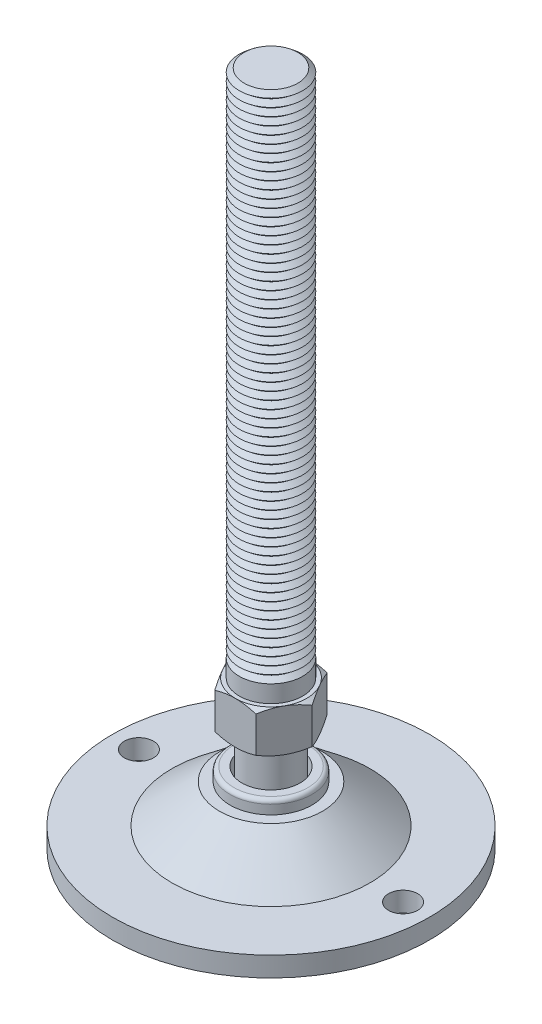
ISO-10303-21;
HEADER;
FILE_DESCRIPTION(('STEP AP214'),'2;1');
FILE_NAME('part.step','',(''),(''),'','','');
FILE_SCHEMA(('AUTOMOTIVE_DESIGN { 1 0 10303 214 1 1 1 1 }'));
ENDSEC;
DATA;
#1=APPLICATION_CONTEXT('core data for automotive mechanical design processes');
#2=APPLICATION_PROTOCOL_DEFINITION('international standard','automotive_design',2000,#1);
#3=PRODUCT_CONTEXT('',#1,'mechanical');
#4=PRODUCT('Part','Part','',(#3));
#5=PRODUCT_RELATED_PRODUCT_CATEGORY('part','',(#4));
#6=PRODUCT_DEFINITION_FORMATION('','',#4);
#7=PRODUCT_DEFINITION_CONTEXT('part definition',#1,'design');
#8=PRODUCT_DEFINITION('design','',#6,#7);
#9=PRODUCT_DEFINITION_SHAPE('','',#8);
#10=(LENGTH_UNIT() NAMED_UNIT(*) SI_UNIT(.MILLI.,.METRE.));
#11=(NAMED_UNIT(*) PLANE_ANGLE_UNIT() SI_UNIT($,.RADIAN.));
#12=(NAMED_UNIT(*) SI_UNIT($,.STERADIAN.) SOLID_ANGLE_UNIT());
#13=UNCERTAINTY_MEASURE_WITH_UNIT(LENGTH_MEASURE(1.E-05),#10,'distance_accuracy_value','');
#14=(GEOMETRIC_REPRESENTATION_CONTEXT(3) GLOBAL_UNCERTAINTY_ASSIGNED_CONTEXT((#13)) GLOBAL_UNIT_ASSIGNED_CONTEXT((#10,
#11,#12)) REPRESENTATION_CONTEXT('',''));
#15=CARTESIAN_POINT('',(0.,0.,0.));
#16=DIRECTION('',(0.,0.,1.));
#17=DIRECTION('',(1.,0.,0.));
#18=AXIS2_PLACEMENT_3D('',#15,#16,#17);
#19=CARTESIAN_POINT('',(0.,244.,0.));
#20=DIRECTION('',(0.,-1.,0.));
#21=DIRECTION('',(0.,0.,-1.));
#22=AXIS2_PLACEMENT_3D('',#19,#20,#21);
#23=CONICAL_SURFACE('',#22,10.1265006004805,0.895664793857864);
#24=CARTESIAN_POINT('',(0.,242.5,0.));
#25=DIRECTION('',(0.,-1.,0.));
#26=DIRECTION('',(0.,0.,-1.));
#27=AXIS2_PLACEMENT_3D('',#24,#25,#26);
#28=CIRCLE('',#27,12.);
#29=CARTESIAN_POINT('',(0.,242.5,-12.));
#30=VERTEX_POINT('',#29);
#31=EDGE_CURVE('P0_E2158',#30,#30,#28,.T.);
#32=ORIENTED_EDGE('',*,*,#31,.F.);
#33=EDGE_LOOP('',(#32));
#34=FACE_BOUND('',#33,.T.);
#35=CARTESIAN_POINT('',(0.,244.,0.));
#36=DIRECTION('',(0.,-1.,0.));
#37=DIRECTION('',(0.,0.,-1.));
#38=AXIS2_PLACEMENT_3D('',#35,#36,#37);
#39=CIRCLE('',#38,10.1265006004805);
#40=CARTESIAN_POINT('',(0.,244.,-10.1265006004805));
#41=VERTEX_POINT('',#40);
#42=EDGE_CURVE('P0_E2167',#41,#41,#39,.T.);
#43=ORIENTED_EDGE('',*,*,#42,.T.);
#44=EDGE_LOOP('',(#43));
#45=FACE_BOUND('',#44,.T.);
#46=ADVANCED_FACE('P0_F16',(#34,#45),#23,.T.);
#47=CARTESIAN_POINT('',(0.,245.5,0.));
#48=DIRECTION('',(0.,1.,0.));
#49=DIRECTION('',(0.,0.,1.));
#50=AXIS2_PLACEMENT_3D('',#47,#48,#49);
#51=CONICAL_SURFACE('',#50,12.,0.895664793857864);
#52=ORIENTED_EDGE('',*,*,#42,.F.);
#53=EDGE_LOOP('',(#52));
#54=FACE_BOUND('',#53,.T.);
#55=CARTESIAN_POINT('',(0.,245.5,0.));
#56=DIRECTION('',(0.,-1.,0.));
#57=DIRECTION('',(0.,0.,-1.));
#58=AXIS2_PLACEMENT_3D('',#55,#56,#57);
#59=CIRCLE('',#58,12.);
#60=CARTESIAN_POINT('',(0.,245.5,-12.));
#61=VERTEX_POINT('',#60);
#62=EDGE_CURVE('P0_E2164',#61,#61,#59,.T.);
#63=ORIENTED_EDGE('',*,*,#62,.T.);
#64=EDGE_LOOP('',(#63));
#65=FACE_BOUND('',#64,.T.);
#66=ADVANCED_FACE('P0_F308',(#54,#65),#51,.T.);
#67=CARTESIAN_POINT('',(0.,256.,0.));
#68=DIRECTION('',(0.,1.,0.));
#69=DIRECTION('',(0.,0.,1.));
#70=AXIS2_PLACEMENT_3D('',#67,#68,#69);
#71=PLANE('',#70);
#72=CARTESIAN_POINT('',(0.,256.,0.));
#73=DIRECTION('',(0.,-1.,0.));
#74=DIRECTION('',(0.,0.,-1.));
#75=AXIS2_PLACEMENT_3D('',#72,#73,#74);
#76=CIRCLE('',#75,10.1265006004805);
#77=CARTESIAN_POINT('',(0.,256.,-10.1265006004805));
#78=VERTEX_POINT('',#77);
#79=EDGE_CURVE('P0_E143',#78,#78,#76,.T.);
#80=ORIENTED_EDGE('',*,*,#79,.F.);
#81=EDGE_LOOP('',(#80));
#82=FACE_BOUND('',#81,.T.);
#83=ADVANCED_FACE('P0_F314',(#82),#71,.T.);
#84=CARTESIAN_POINT('',(0.,256.,0.));
#85=DIRECTION('',(0.,-1.,0.));
#86=DIRECTION('',(0.,0.,-1.));
#87=AXIS2_PLACEMENT_3D('',#84,#85,#86);
#88=CONICAL_SURFACE('',#87,10.1265006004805,0.895664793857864);
#89=CARTESIAN_POINT('',(0.,254.5,0.));
#90=DIRECTION('',(0.,-1.,0.));
#91=DIRECTION('',(0.,0.,-1.));
#92=AXIS2_PLACEMENT_3D('',#89,#90,#91);
#93=CIRCLE('',#92,12.);
#94=CARTESIAN_POINT('',(0.,254.5,-12.));
#95=VERTEX_POINT('',#94);
#96=EDGE_CURVE('P0_E353',#95,#95,#93,.T.);
#97=ORIENTED_EDGE('',*,*,#96,.F.);
#98=EDGE_LOOP('',(#97));
#99=FACE_BOUND('',#98,.T.);
#100=ORIENTED_EDGE('',*,*,#79,.T.);
#101=EDGE_LOOP('',(#100));
#102=FACE_BOUND('',#101,.T.);
#103=ADVANCED_FACE('P0_F211',(#99,#102),#88,.T.);
#104=CARTESIAN_POINT('',(0.,254.5,0.));
#105=DIRECTION('',(0.,1.,0.));
#106=DIRECTION('',(0.,0.,1.));
#107=AXIS2_PLACEMENT_3D('',#104,#105,#106);
#108=CONICAL_SURFACE('',#107,12.,0.895664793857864);
#109=CARTESIAN_POINT('',(0.,253.,0.));
#110=DIRECTION('',(0.,-1.,0.));
#111=DIRECTION('',(0.,0.,-1.));
#112=AXIS2_PLACEMENT_3D('',#109,#110,#111);
#113=CIRCLE('',#112,10.1265006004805);
#114=CARTESIAN_POINT('',(0.,253.,-10.1265006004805));
#115=VERTEX_POINT('',#114);
#116=EDGE_CURVE('P0_E352',#115,#115,#113,.T.);
#117=ORIENTED_EDGE('',*,*,#116,.F.);
#118=EDGE_LOOP('',(#117));
#119=FACE_BOUND('',#118,.T.);
#120=ORIENTED_EDGE('',*,*,#96,.T.);
#121=EDGE_LOOP('',(#120));
#122=FACE_BOUND('',#121,.T.);
#123=ADVANCED_FACE('P0_F339',(#119,#122),#108,.T.);
#124=CARTESIAN_POINT('',(0.,253.,0.));
#125=DIRECTION('',(0.,-1.,0.));
#126=DIRECTION('',(0.,0.,-1.));
#127=AXIS2_PLACEMENT_3D('',#124,#125,#126);
#128=CONICAL_SURFACE('',#127,10.1265006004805,0.895664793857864);
#129=CARTESIAN_POINT('',(0.,251.5,0.));
#130=DIRECTION('',(0.,-1.,0.));
#131=DIRECTION('',(0.,0.,-1.));
#132=AXIS2_PLACEMENT_3D('',#129,#130,#131);
#133=CIRCLE('',#132,12.);
#134=CARTESIAN_POINT('',(0.,251.5,-12.));
#135=VERTEX_POINT('',#134);
#136=EDGE_CURVE('P0_E349',#135,#135,#133,.T.);
#137=ORIENTED_EDGE('',*,*,#136,.F.);
#138=EDGE_LOOP('',(#137));
#139=FACE_BOUND('',#138,.T.);
#140=ORIENTED_EDGE('',*,*,#116,.T.);
#141=EDGE_LOOP('',(#140));
#142=FACE_BOUND('',#141,.T.);
#143=ADVANCED_FACE('P0_F334',(#139,#142),#128,.T.);
#144=CARTESIAN_POINT('',(0.,251.5,0.));
#145=DIRECTION('',(0.,1.,0.));
#146=DIRECTION('',(0.,0.,1.));
#147=AXIS2_PLACEMENT_3D('',#144,#145,#146);
#148=CONICAL_SURFACE('',#147,12.,0.895664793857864);
#149=CARTESIAN_POINT('',(0.,250.,0.));
#150=DIRECTION('',(0.,-1.,0.));
#151=DIRECTION('',(0.,0.,-1.));
#152=AXIS2_PLACEMENT_3D('',#149,#150,#151);
#153=CIRCLE('',#152,10.1265006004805);
#154=CARTESIAN_POINT('',(0.,250.,-10.1265006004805));
#155=VERTEX_POINT('',#154);
#156=EDGE_CURVE('P0_E358',#155,#155,#153,.T.);
#157=ORIENTED_EDGE('',*,*,#156,.F.);
#158=EDGE_LOOP('',(#157));
#159=FACE_BOUND('',#158,.T.);
#160=ORIENTED_EDGE('',*,*,#136,.T.);
#161=EDGE_LOOP('',(#160));
#162=FACE_BOUND('',#161,.T.);
#163=ADVANCED_FACE('P0_F331',(#159,#162),#148,.T.);
#164=CARTESIAN_POINT('',(0.,250.,0.));
#165=DIRECTION('',(0.,-1.,0.));
#166=DIRECTION('',(0.,0.,-1.));
#167=AXIS2_PLACEMENT_3D('',#164,#165,#166);
#168=CONICAL_SURFACE('',#167,10.1265006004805,0.895664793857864);
#169=CARTESIAN_POINT('',(0.,248.5,0.));
#170=DIRECTION('',(0.,-1.,0.));
#171=DIRECTION('',(0.,0.,-1.));
#172=AXIS2_PLACEMENT_3D('',#169,#170,#171);
#173=CIRCLE('',#172,12.);
#174=CARTESIAN_POINT('',(0.,248.5,-12.));
#175=VERTEX_POINT('',#174);
#176=EDGE_CURVE('P0_E2170',#175,#175,#173,.T.);
#177=ORIENTED_EDGE('',*,*,#176,.F.);
#178=EDGE_LOOP('',(#177));
#179=FACE_BOUND('',#178,.T.);
#180=ORIENTED_EDGE('',*,*,#156,.T.);
#181=EDGE_LOOP('',(#180));
#182=FACE_BOUND('',#181,.T.);
#183=ADVANCED_FACE('P0_F325',(#179,#182),#168,.T.);
#184=CARTESIAN_POINT('',(0.,248.5,0.));
#185=DIRECTION('',(0.,1.,0.));
#186=DIRECTION('',(0.,0.,1.));
#187=AXIS2_PLACEMENT_3D('',#184,#185,#186);
#188=CONICAL_SURFACE('',#187,12.,0.895664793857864);
#189=CARTESIAN_POINT('',(0.,247.,0.));
#190=DIRECTION('',(0.,-1.,0.));
#191=DIRECTION('',(0.,0.,-1.));
#192=AXIS2_PLACEMENT_3D('',#189,#190,#191);
#193=CIRCLE('',#192,10.1265006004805);
#194=CARTESIAN_POINT('',(0.,247.,-10.1265006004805));
#195=VERTEX_POINT('',#194);
#196=EDGE_CURVE('P0_E2173',#195,#195,#193,.T.);
#197=ORIENTED_EDGE('',*,*,#196,.F.);
#198=EDGE_LOOP('',(#197));
#199=FACE_BOUND('',#198,.T.);
#200=ORIENTED_EDGE('',*,*,#176,.T.);
#201=EDGE_LOOP('',(#200));
#202=FACE_BOUND('',#201,.T.);
#203=ADVANCED_FACE('P0_F321',(#199,#202),#188,.T.);
#204=CARTESIAN_POINT('',(0.,247.,0.));
#205=DIRECTION('',(0.,-1.,0.));
#206=DIRECTION('',(0.,0.,-1.));
#207=AXIS2_PLACEMENT_3D('',#204,#205,#206);
#208=CONICAL_SURFACE('',#207,10.1265006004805,0.895664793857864);
#209=ORIENTED_EDGE('',*,*,#62,.F.);
#210=EDGE_LOOP('',(#209));
#211=FACE_BOUND('',#210,.T.);
#212=ORIENTED_EDGE('',*,*,#196,.T.);
#213=EDGE_LOOP('',(#212));
#214=FACE_BOUND('',#213,.T.);
#215=ADVANCED_FACE('P0_F324',(#211,#214),#208,.T.);
#216=CARTESIAN_POINT('',(0.,241.,0.));
#217=DIRECTION('',(0.,-1.,0.));
#218=DIRECTION('',(0.,0.,-1.));
#219=AXIS2_PLACEMENT_3D('',#216,#217,#218);
#220=CONICAL_SURFACE('',#219,10.1265006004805,0.895664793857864);
#221=CARTESIAN_POINT('',(0.,239.5,0.));
#222=DIRECTION('',(0.,-1.,0.));
#223=DIRECTION('',(0.,0.,-1.));
#224=AXIS2_PLACEMENT_3D('',#221,#222,#223);
#225=CIRCLE('',#224,12.);
#226=CARTESIAN_POINT('',(0.,239.5,-12.));
#227=VERTEX_POINT('',#226);
#228=EDGE_CURVE('P0_E2152',#227,#227,#225,.T.);
#229=ORIENTED_EDGE('',*,*,#228,.F.);
#230=EDGE_LOOP('',(#229));
#231=FACE_BOUND('',#230,.T.);
#232=CARTESIAN_POINT('',(0.,241.,0.));
#233=DIRECTION('',(0.,-1.,0.));
#234=DIRECTION('',(0.,0.,-1.));
#235=AXIS2_PLACEMENT_3D('',#232,#233,#234);
#236=CIRCLE('',#235,10.1265006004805);
#237=CARTESIAN_POINT('',(0.,241.,-10.1265006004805));
#238=VERTEX_POINT('',#237);
#239=EDGE_CURVE('P0_E2161',#238,#238,#236,.T.);
#240=ORIENTED_EDGE('',*,*,#239,.T.);
#241=EDGE_LOOP('',(#240));
#242=FACE_BOUND('',#241,.T.);
#243=ADVANCED_FACE('P0_F329',(#231,#242),#220,.T.);
#244=CARTESIAN_POINT('',(0.,242.5,0.));
#245=DIRECTION('',(0.,1.,0.));
#246=DIRECTION('',(0.,0.,1.));
#247=AXIS2_PLACEMENT_3D('',#244,#245,#246);
#248=CONICAL_SURFACE('',#247,12.,0.895664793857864);
#249=ORIENTED_EDGE('',*,*,#239,.F.);
#250=EDGE_LOOP('',(#249));
#251=FACE_BOUND('',#250,.T.);
#252=ORIENTED_EDGE('',*,*,#31,.T.);
#253=EDGE_LOOP('',(#252));
#254=FACE_BOUND('',#253,.T.);
#255=ADVANCED_FACE('P0_F1704',(#251,#254),#248,.T.);
#256=CARTESIAN_POINT('',(0.,238.,0.));
#257=DIRECTION('',(0.,-1.,0.));
#258=DIRECTION('',(0.,0.,-1.));
#259=AXIS2_PLACEMENT_3D('',#256,#257,#258);
#260=CONICAL_SURFACE('',#259,10.1265006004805,0.895664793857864);
#261=CARTESIAN_POINT('',(0.,236.5,0.));
#262=DIRECTION('',(0.,-1.,0.));
#263=DIRECTION('',(0.,0.,-1.));
#264=AXIS2_PLACEMENT_3D('',#261,#262,#263);
#265=CIRCLE('',#264,12.);
#266=CARTESIAN_POINT('',(0.,236.5,-12.));
#267=VERTEX_POINT('',#266);
#268=EDGE_CURVE('P0_E2146',#267,#267,#265,.T.);
#269=ORIENTED_EDGE('',*,*,#268,.F.);
#270=EDGE_LOOP('',(#269));
#271=FACE_BOUND('',#270,.T.);
#272=CARTESIAN_POINT('',(0.,238.,0.));
#273=DIRECTION('',(0.,-1.,0.));
#274=DIRECTION('',(0.,0.,-1.));
#275=AXIS2_PLACEMENT_3D('',#272,#273,#274);
#276=CIRCLE('',#275,10.1265006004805);
#277=CARTESIAN_POINT('',(0.,238.,-10.1265006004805));
#278=VERTEX_POINT('',#277);
#279=EDGE_CURVE('P0_E2155',#278,#278,#276,.T.);
#280=ORIENTED_EDGE('',*,*,#279,.T.);
#281=EDGE_LOOP('',(#280));
#282=FACE_BOUND('',#281,.T.);
#283=ADVANCED_FACE('P0_F1694',(#271,#282),#260,.T.);
#284=CARTESIAN_POINT('',(0.,239.5,0.));
#285=DIRECTION('',(0.,1.,0.));
#286=DIRECTION('',(0.,0.,1.));
#287=AXIS2_PLACEMENT_3D('',#284,#285,#286);
#288=CONICAL_SURFACE('',#287,12.,0.895664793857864);
#289=ORIENTED_EDGE('',*,*,#279,.F.);
#290=EDGE_LOOP('',(#289));
#291=FACE_BOUND('',#290,.T.);
#292=ORIENTED_EDGE('',*,*,#228,.T.);
#293=EDGE_LOOP('',(#292));
#294=FACE_BOUND('',#293,.T.);
#295=ADVANCED_FACE('P0_F1684',(#291,#294),#288,.T.);
#296=CARTESIAN_POINT('',(0.,235.,0.));
#297=DIRECTION('',(0.,-1.,0.));
#298=DIRECTION('',(0.,0.,-1.));
#299=AXIS2_PLACEMENT_3D('',#296,#297,#298);
#300=CONICAL_SURFACE('',#299,10.1265006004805,0.895664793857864);
#301=CARTESIAN_POINT('',(0.,233.5,0.));
#302=DIRECTION('',(0.,-1.,0.));
#303=DIRECTION('',(0.,0.,-1.));
#304=AXIS2_PLACEMENT_3D('',#301,#302,#303);
#305=CIRCLE('',#304,12.);
#306=CARTESIAN_POINT('',(0.,233.5,-12.));
#307=VERTEX_POINT('',#306);
#308=EDGE_CURVE('P0_E2140',#307,#307,#305,.T.);
#309=ORIENTED_EDGE('',*,*,#308,.F.);
#310=EDGE_LOOP('',(#309));
#311=FACE_BOUND('',#310,.T.);
#312=CARTESIAN_POINT('',(0.,235.,0.));
#313=DIRECTION('',(0.,-1.,0.));
#314=DIRECTION('',(0.,0.,-1.));
#315=AXIS2_PLACEMENT_3D('',#312,#313,#314);
#316=CIRCLE('',#315,10.1265006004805);
#317=CARTESIAN_POINT('',(0.,235.,-10.1265006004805));
#318=VERTEX_POINT('',#317);
#319=EDGE_CURVE('P0_E2149',#318,#318,#316,.T.);
#320=ORIENTED_EDGE('',*,*,#319,.T.);
#321=EDGE_LOOP('',(#320));
#322=FACE_BOUND('',#321,.T.);
#323=ADVANCED_FACE('P0_F1674',(#311,#322),#300,.T.);
#324=CARTESIAN_POINT('',(0.,236.5,0.));
#325=DIRECTION('',(0.,1.,0.));
#326=DIRECTION('',(0.,0.,1.));
#327=AXIS2_PLACEMENT_3D('',#324,#325,#326);
#328=CONICAL_SURFACE('',#327,12.,0.895664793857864);
#329=ORIENTED_EDGE('',*,*,#319,.F.);
#330=EDGE_LOOP('',(#329));
#331=FACE_BOUND('',#330,.T.);
#332=ORIENTED_EDGE('',*,*,#268,.T.);
#333=EDGE_LOOP('',(#332));
#334=FACE_BOUND('',#333,.T.);
#335=ADVANCED_FACE('P0_F1664',(#331,#334),#328,.T.);
#336=CARTESIAN_POINT('',(0.,232.,0.));
#337=DIRECTION('',(0.,-1.,0.));
#338=DIRECTION('',(0.,0.,-1.));
#339=AXIS2_PLACEMENT_3D('',#336,#337,#338);
#340=CONICAL_SURFACE('',#339,10.1265006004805,0.895664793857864);
#341=CARTESIAN_POINT('',(0.,230.5,0.));
#342=DIRECTION('',(0.,-1.,0.));
#343=DIRECTION('',(0.,0.,-1.));
#344=AXIS2_PLACEMENT_3D('',#341,#342,#343);
#345=CIRCLE('',#344,12.);
#346=CARTESIAN_POINT('',(0.,230.5,-12.));
#347=VERTEX_POINT('',#346);
#348=EDGE_CURVE('P0_E2134',#347,#347,#345,.T.);
#349=ORIENTED_EDGE('',*,*,#348,.F.);
#350=EDGE_LOOP('',(#349));
#351=FACE_BOUND('',#350,.T.);
#352=CARTESIAN_POINT('',(0.,232.,0.));
#353=DIRECTION('',(0.,-1.,0.));
#354=DIRECTION('',(0.,0.,-1.));
#355=AXIS2_PLACEMENT_3D('',#352,#353,#354);
#356=CIRCLE('',#355,10.1265006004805);
#357=CARTESIAN_POINT('',(0.,232.,-10.1265006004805));
#358=VERTEX_POINT('',#357);
#359=EDGE_CURVE('P0_E2143',#358,#358,#356,.T.);
#360=ORIENTED_EDGE('',*,*,#359,.T.);
#361=EDGE_LOOP('',(#360));
#362=FACE_BOUND('',#361,.T.);
#363=ADVANCED_FACE('P0_F1654',(#351,#362),#340,.T.);
#364=CARTESIAN_POINT('',(0.,233.5,0.));
#365=DIRECTION('',(0.,1.,0.));
#366=DIRECTION('',(0.,0.,1.));
#367=AXIS2_PLACEMENT_3D('',#364,#365,#366);
#368=CONICAL_SURFACE('',#367,12.,0.895664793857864);
#369=ORIENTED_EDGE('',*,*,#359,.F.);
#370=EDGE_LOOP('',(#369));
#371=FACE_BOUND('',#370,.T.);
#372=ORIENTED_EDGE('',*,*,#308,.T.);
#373=EDGE_LOOP('',(#372));
#374=FACE_BOUND('',#373,.T.);
#375=ADVANCED_FACE('P0_F1644',(#371,#374),#368,.T.);
#376=CARTESIAN_POINT('',(0.,229.,0.));
#377=DIRECTION('',(0.,-1.,0.));
#378=DIRECTION('',(0.,0.,-1.));
#379=AXIS2_PLACEMENT_3D('',#376,#377,#378);
#380=CONICAL_SURFACE('',#379,10.1265006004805,0.895664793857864);
#381=CARTESIAN_POINT('',(0.,227.5,0.));
#382=DIRECTION('',(0.,-1.,0.));
#383=DIRECTION('',(0.,0.,-1.));
#384=AXIS2_PLACEMENT_3D('',#381,#382,#383);
#385=CIRCLE('',#384,12.);
#386=CARTESIAN_POINT('',(0.,227.5,-12.));
#387=VERTEX_POINT('',#386);
#388=EDGE_CURVE('P0_E2128',#387,#387,#385,.T.);
#389=ORIENTED_EDGE('',*,*,#388,.F.);
#390=EDGE_LOOP('',(#389));
#391=FACE_BOUND('',#390,.T.);
#392=CARTESIAN_POINT('',(0.,229.,0.));
#393=DIRECTION('',(0.,-1.,0.));
#394=DIRECTION('',(0.,0.,-1.));
#395=AXIS2_PLACEMENT_3D('',#392,#393,#394);
#396=CIRCLE('',#395,10.1265006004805);
#397=CARTESIAN_POINT('',(0.,229.,-10.1265006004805));
#398=VERTEX_POINT('',#397);
#399=EDGE_CURVE('P0_E2137',#398,#398,#396,.T.);
#400=ORIENTED_EDGE('',*,*,#399,.T.);
#401=EDGE_LOOP('',(#400));
#402=FACE_BOUND('',#401,.T.);
#403=ADVANCED_FACE('P0_F1634',(#391,#402),#380,.T.);
#404=CARTESIAN_POINT('',(0.,230.5,0.));
#405=DIRECTION('',(0.,1.,0.));
#406=DIRECTION('',(0.,0.,1.));
#407=AXIS2_PLACEMENT_3D('',#404,#405,#406);
#408=CONICAL_SURFACE('',#407,12.,0.895664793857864);
#409=ORIENTED_EDGE('',*,*,#399,.F.);
#410=EDGE_LOOP('',(#409));
#411=FACE_BOUND('',#410,.T.);
#412=ORIENTED_EDGE('',*,*,#348,.T.);
#413=EDGE_LOOP('',(#412));
#414=FACE_BOUND('',#413,.T.);
#415=ADVANCED_FACE('P0_F1624',(#411,#414),#408,.T.);
#416=CARTESIAN_POINT('',(0.,226.,0.));
#417=DIRECTION('',(0.,-1.,0.));
#418=DIRECTION('',(0.,0.,-1.));
#419=AXIS2_PLACEMENT_3D('',#416,#417,#418);
#420=CONICAL_SURFACE('',#419,10.1265006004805,0.895664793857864);
#421=CARTESIAN_POINT('',(0.,224.5,0.));
#422=DIRECTION('',(0.,-1.,0.));
#423=DIRECTION('',(0.,0.,-1.));
#424=AXIS2_PLACEMENT_3D('',#421,#422,#423);
#425=CIRCLE('',#424,12.);
#426=CARTESIAN_POINT('',(0.,224.5,-12.));
#427=VERTEX_POINT('',#426);
#428=EDGE_CURVE('P0_E2122',#427,#427,#425,.T.);
#429=ORIENTED_EDGE('',*,*,#428,.F.);
#430=EDGE_LOOP('',(#429));
#431=FACE_BOUND('',#430,.T.);
#432=CARTESIAN_POINT('',(0.,226.,0.));
#433=DIRECTION('',(0.,-1.,0.));
#434=DIRECTION('',(0.,0.,-1.));
#435=AXIS2_PLACEMENT_3D('',#432,#433,#434);
#436=CIRCLE('',#435,10.1265006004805);
#437=CARTESIAN_POINT('',(0.,226.,-10.1265006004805));
#438=VERTEX_POINT('',#437);
#439=EDGE_CURVE('P0_E2131',#438,#438,#436,.T.);
#440=ORIENTED_EDGE('',*,*,#439,.T.);
#441=EDGE_LOOP('',(#440));
#442=FACE_BOUND('',#441,.T.);
#443=ADVANCED_FACE('P0_F1614',(#431,#442),#420,.T.);
#444=CARTESIAN_POINT('',(0.,227.5,0.));
#445=DIRECTION('',(0.,1.,0.));
#446=DIRECTION('',(0.,0.,1.));
#447=AXIS2_PLACEMENT_3D('',#444,#445,#446);
#448=CONICAL_SURFACE('',#447,12.,0.895664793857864);
#449=ORIENTED_EDGE('',*,*,#439,.F.);
#450=EDGE_LOOP('',(#449));
#451=FACE_BOUND('',#450,.T.);
#452=ORIENTED_EDGE('',*,*,#388,.T.);
#453=EDGE_LOOP('',(#452));
#454=FACE_BOUND('',#453,.T.);
#455=ADVANCED_FACE('P0_F1604',(#451,#454),#448,.T.);
#456=CARTESIAN_POINT('',(0.,223.,0.));
#457=DIRECTION('',(0.,-1.,0.));
#458=DIRECTION('',(0.,0.,-1.));
#459=AXIS2_PLACEMENT_3D('',#456,#457,#458);
#460=CONICAL_SURFACE('',#459,10.1265006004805,0.895664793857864);
#461=CARTESIAN_POINT('',(0.,221.5,0.));
#462=DIRECTION('',(0.,-1.,0.));
#463=DIRECTION('',(0.,0.,-1.));
#464=AXIS2_PLACEMENT_3D('',#461,#462,#463);
#465=CIRCLE('',#464,12.);
#466=CARTESIAN_POINT('',(0.,221.5,-12.));
#467=VERTEX_POINT('',#466);
#468=EDGE_CURVE('P0_E2116',#467,#467,#465,.T.);
#469=ORIENTED_EDGE('',*,*,#468,.F.);
#470=EDGE_LOOP('',(#469));
#471=FACE_BOUND('',#470,.T.);
#472=CARTESIAN_POINT('',(0.,223.,0.));
#473=DIRECTION('',(0.,-1.,0.));
#474=DIRECTION('',(0.,0.,-1.));
#475=AXIS2_PLACEMENT_3D('',#472,#473,#474);
#476=CIRCLE('',#475,10.1265006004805);
#477=CARTESIAN_POINT('',(0.,223.,-10.1265006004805));
#478=VERTEX_POINT('',#477);
#479=EDGE_CURVE('P0_E2125',#478,#478,#476,.T.);
#480=ORIENTED_EDGE('',*,*,#479,.T.);
#481=EDGE_LOOP('',(#480));
#482=FACE_BOUND('',#481,.T.);
#483=ADVANCED_FACE('P0_F1594',(#471,#482),#460,.T.);
#484=CARTESIAN_POINT('',(0.,224.5,0.));
#485=DIRECTION('',(0.,1.,0.));
#486=DIRECTION('',(0.,0.,1.));
#487=AXIS2_PLACEMENT_3D('',#484,#485,#486);
#488=CONICAL_SURFACE('',#487,12.,0.895664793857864);
#489=ORIENTED_EDGE('',*,*,#479,.F.);
#490=EDGE_LOOP('',(#489));
#491=FACE_BOUND('',#490,.T.);
#492=ORIENTED_EDGE('',*,*,#428,.T.);
#493=EDGE_LOOP('',(#492));
#494=FACE_BOUND('',#493,.T.);
#495=ADVANCED_FACE('P0_F1584',(#491,#494),#488,.T.);
#496=CARTESIAN_POINT('',(0.,220.,0.));
#497=DIRECTION('',(0.,-1.,0.));
#498=DIRECTION('',(0.,0.,-1.));
#499=AXIS2_PLACEMENT_3D('',#496,#497,#498);
#500=CONICAL_SURFACE('',#499,10.1265006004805,0.895664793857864);
#501=CARTESIAN_POINT('',(0.,218.5,0.));
#502=DIRECTION('',(0.,-1.,0.));
#503=DIRECTION('',(0.,0.,-1.));
#504=AXIS2_PLACEMENT_3D('',#501,#502,#503);
#505=CIRCLE('',#504,12.);
#506=CARTESIAN_POINT('',(0.,218.5,-12.));
#507=VERTEX_POINT('',#506);
#508=EDGE_CURVE('P0_E2110',#507,#507,#505,.T.);
#509=ORIENTED_EDGE('',*,*,#508,.F.);
#510=EDGE_LOOP('',(#509));
#511=FACE_BOUND('',#510,.T.);
#512=CARTESIAN_POINT('',(0.,220.,0.));
#513=DIRECTION('',(0.,-1.,0.));
#514=DIRECTION('',(0.,0.,-1.));
#515=AXIS2_PLACEMENT_3D('',#512,#513,#514);
#516=CIRCLE('',#515,10.1265006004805);
#517=CARTESIAN_POINT('',(0.,220.,-10.1265006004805));
#518=VERTEX_POINT('',#517);
#519=EDGE_CURVE('P0_E2119',#518,#518,#516,.T.);
#520=ORIENTED_EDGE('',*,*,#519,.T.);
#521=EDGE_LOOP('',(#520));
#522=FACE_BOUND('',#521,.T.);
#523=ADVANCED_FACE('P0_F1574',(#511,#522),#500,.T.);
#524=CARTESIAN_POINT('',(0.,221.5,0.));
#525=DIRECTION('',(0.,1.,0.));
#526=DIRECTION('',(0.,0.,1.));
#527=AXIS2_PLACEMENT_3D('',#524,#525,#526);
#528=CONICAL_SURFACE('',#527,12.,0.895664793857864);
#529=ORIENTED_EDGE('',*,*,#519,.F.);
#530=EDGE_LOOP('',(#529));
#531=FACE_BOUND('',#530,.T.);
#532=ORIENTED_EDGE('',*,*,#468,.T.);
#533=EDGE_LOOP('',(#532));
#534=FACE_BOUND('',#533,.T.);
#535=ADVANCED_FACE('P0_F1564',(#531,#534),#528,.T.);
#536=CARTESIAN_POINT('',(0.,217.,0.));
#537=DIRECTION('',(0.,-1.,0.));
#538=DIRECTION('',(0.,0.,-1.));
#539=AXIS2_PLACEMENT_3D('',#536,#537,#538);
#540=CONICAL_SURFACE('',#539,10.1265006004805,0.895664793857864);
#541=CARTESIAN_POINT('',(0.,215.5,0.));
#542=DIRECTION('',(0.,-1.,0.));
#543=DIRECTION('',(0.,0.,-1.));
#544=AXIS2_PLACEMENT_3D('',#541,#542,#543);
#545=CIRCLE('',#544,12.);
#546=CARTESIAN_POINT('',(0.,215.5,-12.));
#547=VERTEX_POINT('',#546);
#548=EDGE_CURVE('P0_E2104',#547,#547,#545,.T.);
#549=ORIENTED_EDGE('',*,*,#548,.F.);
#550=EDGE_LOOP('',(#549));
#551=FACE_BOUND('',#550,.T.);
#552=CARTESIAN_POINT('',(0.,217.,0.));
#553=DIRECTION('',(0.,-1.,0.));
#554=DIRECTION('',(0.,0.,-1.));
#555=AXIS2_PLACEMENT_3D('',#552,#553,#554);
#556=CIRCLE('',#555,10.1265006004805);
#557=CARTESIAN_POINT('',(0.,217.,-10.1265006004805));
#558=VERTEX_POINT('',#557);
#559=EDGE_CURVE('P0_E2113',#558,#558,#556,.T.);
#560=ORIENTED_EDGE('',*,*,#559,.T.);
#561=EDGE_LOOP('',(#560));
#562=FACE_BOUND('',#561,.T.);
#563=ADVANCED_FACE('P0_F1554',(#551,#562),#540,.T.);
#564=CARTESIAN_POINT('',(0.,218.5,0.));
#565=DIRECTION('',(0.,1.,0.));
#566=DIRECTION('',(0.,0.,1.));
#567=AXIS2_PLACEMENT_3D('',#564,#565,#566);
#568=CONICAL_SURFACE('',#567,12.,0.895664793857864);
#569=ORIENTED_EDGE('',*,*,#559,.F.);
#570=EDGE_LOOP('',(#569));
#571=FACE_BOUND('',#570,.T.);
#572=ORIENTED_EDGE('',*,*,#508,.T.);
#573=EDGE_LOOP('',(#572));
#574=FACE_BOUND('',#573,.T.);
#575=ADVANCED_FACE('P0_F1544',(#571,#574),#568,.T.);
#576=CARTESIAN_POINT('',(0.,214.,0.));
#577=DIRECTION('',(0.,-1.,0.));
#578=DIRECTION('',(0.,0.,-1.));
#579=AXIS2_PLACEMENT_3D('',#576,#577,#578);
#580=CONICAL_SURFACE('',#579,10.1265006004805,0.895664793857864);
#581=CARTESIAN_POINT('',(0.,212.5,0.));
#582=DIRECTION('',(0.,-1.,0.));
#583=DIRECTION('',(0.,0.,-1.));
#584=AXIS2_PLACEMENT_3D('',#581,#582,#583);
#585=CIRCLE('',#584,12.);
#586=CARTESIAN_POINT('',(0.,212.5,-12.));
#587=VERTEX_POINT('',#586);
#588=EDGE_CURVE('P0_E2098',#587,#587,#585,.T.);
#589=ORIENTED_EDGE('',*,*,#588,.F.);
#590=EDGE_LOOP('',(#589));
#591=FACE_BOUND('',#590,.T.);
#592=CARTESIAN_POINT('',(0.,214.,0.));
#593=DIRECTION('',(0.,-1.,0.));
#594=DIRECTION('',(0.,0.,-1.));
#595=AXIS2_PLACEMENT_3D('',#592,#593,#594);
#596=CIRCLE('',#595,10.1265006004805);
#597=CARTESIAN_POINT('',(0.,214.,-10.1265006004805));
#598=VERTEX_POINT('',#597);
#599=EDGE_CURVE('P0_E2107',#598,#598,#596,.T.);
#600=ORIENTED_EDGE('',*,*,#599,.T.);
#601=EDGE_LOOP('',(#600));
#602=FACE_BOUND('',#601,.T.);
#603=ADVANCED_FACE('P0_F1534',(#591,#602),#580,.T.);
#604=CARTESIAN_POINT('',(0.,215.5,0.));
#605=DIRECTION('',(0.,1.,0.));
#606=DIRECTION('',(0.,0.,1.));
#607=AXIS2_PLACEMENT_3D('',#604,#605,#606);
#608=CONICAL_SURFACE('',#607,12.,0.895664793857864);
#609=ORIENTED_EDGE('',*,*,#599,.F.);
#610=EDGE_LOOP('',(#609));
#611=FACE_BOUND('',#610,.T.);
#612=ORIENTED_EDGE('',*,*,#548,.T.);
#613=EDGE_LOOP('',(#612));
#614=FACE_BOUND('',#613,.T.);
#615=ADVANCED_FACE('P0_F1524',(#611,#614),#608,.T.);
#616=CARTESIAN_POINT('',(0.,211.,0.));
#617=DIRECTION('',(0.,-1.,0.));
#618=DIRECTION('',(0.,0.,-1.));
#619=AXIS2_PLACEMENT_3D('',#616,#617,#618);
#620=CONICAL_SURFACE('',#619,10.1265006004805,0.895664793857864);
#621=CARTESIAN_POINT('',(0.,209.5,0.));
#622=DIRECTION('',(0.,-1.,0.));
#623=DIRECTION('',(0.,0.,-1.));
#624=AXIS2_PLACEMENT_3D('',#621,#622,#623);
#625=CIRCLE('',#624,12.);
#626=CARTESIAN_POINT('',(0.,209.5,-12.));
#627=VERTEX_POINT('',#626);
#628=EDGE_CURVE('P0_E2092',#627,#627,#625,.T.);
#629=ORIENTED_EDGE('',*,*,#628,.F.);
#630=EDGE_LOOP('',(#629));
#631=FACE_BOUND('',#630,.T.);
#632=CARTESIAN_POINT('',(0.,211.,0.));
#633=DIRECTION('',(0.,-1.,0.));
#634=DIRECTION('',(0.,0.,-1.));
#635=AXIS2_PLACEMENT_3D('',#632,#633,#634);
#636=CIRCLE('',#635,10.1265006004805);
#637=CARTESIAN_POINT('',(0.,211.,-10.1265006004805));
#638=VERTEX_POINT('',#637);
#639=EDGE_CURVE('P0_E2101',#638,#638,#636,.T.);
#640=ORIENTED_EDGE('',*,*,#639,.T.);
#641=EDGE_LOOP('',(#640));
#642=FACE_BOUND('',#641,.T.);
#643=ADVANCED_FACE('P0_F1514',(#631,#642),#620,.T.);
#644=CARTESIAN_POINT('',(0.,212.5,0.));
#645=DIRECTION('',(0.,1.,0.));
#646=DIRECTION('',(0.,0.,1.));
#647=AXIS2_PLACEMENT_3D('',#644,#645,#646);
#648=CONICAL_SURFACE('',#647,12.,0.895664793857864);
#649=ORIENTED_EDGE('',*,*,#639,.F.);
#650=EDGE_LOOP('',(#649));
#651=FACE_BOUND('',#650,.T.);
#652=ORIENTED_EDGE('',*,*,#588,.T.);
#653=EDGE_LOOP('',(#652));
#654=FACE_BOUND('',#653,.T.);
#655=ADVANCED_FACE('P0_F1504',(#651,#654),#648,.T.);
#656=CARTESIAN_POINT('',(0.,208.,0.));
#657=DIRECTION('',(0.,-1.,0.));
#658=DIRECTION('',(0.,0.,-1.));
#659=AXIS2_PLACEMENT_3D('',#656,#657,#658);
#660=CONICAL_SURFACE('',#659,10.1265006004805,0.895664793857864);
#661=CARTESIAN_POINT('',(0.,206.5,0.));
#662=DIRECTION('',(0.,-1.,0.));
#663=DIRECTION('',(0.,0.,-1.));
#664=AXIS2_PLACEMENT_3D('',#661,#662,#663);
#665=CIRCLE('',#664,12.);
#666=CARTESIAN_POINT('',(0.,206.5,-12.));
#667=VERTEX_POINT('',#666);
#668=EDGE_CURVE('P0_E2086',#667,#667,#665,.T.);
#669=ORIENTED_EDGE('',*,*,#668,.F.);
#670=EDGE_LOOP('',(#669));
#671=FACE_BOUND('',#670,.T.);
#672=CARTESIAN_POINT('',(0.,208.,0.));
#673=DIRECTION('',(0.,-1.,0.));
#674=DIRECTION('',(0.,0.,-1.));
#675=AXIS2_PLACEMENT_3D('',#672,#673,#674);
#676=CIRCLE('',#675,10.1265006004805);
#677=CARTESIAN_POINT('',(0.,208.,-10.1265006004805));
#678=VERTEX_POINT('',#677);
#679=EDGE_CURVE('P0_E2095',#678,#678,#676,.T.);
#680=ORIENTED_EDGE('',*,*,#679,.T.);
#681=EDGE_LOOP('',(#680));
#682=FACE_BOUND('',#681,.T.);
#683=ADVANCED_FACE('P0_F1494',(#671,#682),#660,.T.);
#684=CARTESIAN_POINT('',(0.,209.5,0.));
#685=DIRECTION('',(0.,1.,0.));
#686=DIRECTION('',(0.,0.,1.));
#687=AXIS2_PLACEMENT_3D('',#684,#685,#686);
#688=CONICAL_SURFACE('',#687,12.,0.895664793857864);
#689=ORIENTED_EDGE('',*,*,#679,.F.);
#690=EDGE_LOOP('',(#689));
#691=FACE_BOUND('',#690,.T.);
#692=ORIENTED_EDGE('',*,*,#628,.T.);
#693=EDGE_LOOP('',(#692));
#694=FACE_BOUND('',#693,.T.);
#695=ADVANCED_FACE('P0_F1484',(#691,#694),#688,.T.);
#696=CARTESIAN_POINT('',(0.,205.,0.));
#697=DIRECTION('',(0.,-1.,0.));
#698=DIRECTION('',(0.,0.,-1.));
#699=AXIS2_PLACEMENT_3D('',#696,#697,#698);
#700=CONICAL_SURFACE('',#699,10.1265006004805,0.895664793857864);
#701=CARTESIAN_POINT('',(0.,203.5,0.));
#702=DIRECTION('',(0.,-1.,0.));
#703=DIRECTION('',(0.,0.,-1.));
#704=AXIS2_PLACEMENT_3D('',#701,#702,#703);
#705=CIRCLE('',#704,12.);
#706=CARTESIAN_POINT('',(0.,203.5,-12.));
#707=VERTEX_POINT('',#706);
#708=EDGE_CURVE('P0_E2080',#707,#707,#705,.T.);
#709=ORIENTED_EDGE('',*,*,#708,.F.);
#710=EDGE_LOOP('',(#709));
#711=FACE_BOUND('',#710,.T.);
#712=CARTESIAN_POINT('',(0.,205.,0.));
#713=DIRECTION('',(0.,-1.,0.));
#714=DIRECTION('',(0.,0.,-1.));
#715=AXIS2_PLACEMENT_3D('',#712,#713,#714);
#716=CIRCLE('',#715,10.1265006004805);
#717=CARTESIAN_POINT('',(0.,205.,-10.1265006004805));
#718=VERTEX_POINT('',#717);
#719=EDGE_CURVE('P0_E2089',#718,#718,#716,.T.);
#720=ORIENTED_EDGE('',*,*,#719,.T.);
#721=EDGE_LOOP('',(#720));
#722=FACE_BOUND('',#721,.T.);
#723=ADVANCED_FACE('P0_F1474',(#711,#722),#700,.T.);
#724=CARTESIAN_POINT('',(0.,206.5,0.));
#725=DIRECTION('',(0.,1.,0.));
#726=DIRECTION('',(0.,0.,1.));
#727=AXIS2_PLACEMENT_3D('',#724,#725,#726);
#728=CONICAL_SURFACE('',#727,12.,0.895664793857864);
#729=ORIENTED_EDGE('',*,*,#719,.F.);
#730=EDGE_LOOP('',(#729));
#731=FACE_BOUND('',#730,.T.);
#732=ORIENTED_EDGE('',*,*,#668,.T.);
#733=EDGE_LOOP('',(#732));
#734=FACE_BOUND('',#733,.T.);
#735=ADVANCED_FACE('P0_F1464',(#731,#734),#728,.T.);
#736=CARTESIAN_POINT('',(0.,202.,0.));
#737=DIRECTION('',(0.,-1.,0.));
#738=DIRECTION('',(0.,0.,-1.));
#739=AXIS2_PLACEMENT_3D('',#736,#737,#738);
#740=CONICAL_SURFACE('',#739,10.1265006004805,0.895664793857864);
#741=CARTESIAN_POINT('',(0.,200.5,0.));
#742=DIRECTION('',(0.,-1.,0.));
#743=DIRECTION('',(0.,0.,-1.));
#744=AXIS2_PLACEMENT_3D('',#741,#742,#743);
#745=CIRCLE('',#744,12.);
#746=CARTESIAN_POINT('',(0.,200.5,-12.));
#747=VERTEX_POINT('',#746);
#748=EDGE_CURVE('P0_E2074',#747,#747,#745,.T.);
#749=ORIENTED_EDGE('',*,*,#748,.F.);
#750=EDGE_LOOP('',(#749));
#751=FACE_BOUND('',#750,.T.);
#752=CARTESIAN_POINT('',(0.,202.,0.));
#753=DIRECTION('',(0.,-1.,0.));
#754=DIRECTION('',(0.,0.,-1.));
#755=AXIS2_PLACEMENT_3D('',#752,#753,#754);
#756=CIRCLE('',#755,10.1265006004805);
#757=CARTESIAN_POINT('',(0.,202.,-10.1265006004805));
#758=VERTEX_POINT('',#757);
#759=EDGE_CURVE('P0_E2083',#758,#758,#756,.T.);
#760=ORIENTED_EDGE('',*,*,#759,.T.);
#761=EDGE_LOOP('',(#760));
#762=FACE_BOUND('',#761,.T.);
#763=ADVANCED_FACE('P0_F1454',(#751,#762),#740,.T.);
#764=CARTESIAN_POINT('',(0.,203.5,0.));
#765=DIRECTION('',(0.,1.,0.));
#766=DIRECTION('',(0.,0.,1.));
#767=AXIS2_PLACEMENT_3D('',#764,#765,#766);
#768=CONICAL_SURFACE('',#767,12.,0.895664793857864);
#769=ORIENTED_EDGE('',*,*,#759,.F.);
#770=EDGE_LOOP('',(#769));
#771=FACE_BOUND('',#770,.T.);
#772=ORIENTED_EDGE('',*,*,#708,.T.);
#773=EDGE_LOOP('',(#772));
#774=FACE_BOUND('',#773,.T.);
#775=ADVANCED_FACE('P0_F1444',(#771,#774),#768,.T.);
#776=CARTESIAN_POINT('',(0.,199.,0.));
#777=DIRECTION('',(0.,-1.,0.));
#778=DIRECTION('',(0.,0.,-1.));
#779=AXIS2_PLACEMENT_3D('',#776,#777,#778);
#780=CONICAL_SURFACE('',#779,10.1265006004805,0.895664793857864);
#781=CARTESIAN_POINT('',(0.,197.5,0.));
#782=DIRECTION('',(0.,-1.,0.));
#783=DIRECTION('',(0.,0.,-1.));
#784=AXIS2_PLACEMENT_3D('',#781,#782,#783);
#785=CIRCLE('',#784,12.);
#786=CARTESIAN_POINT('',(0.,197.5,-12.));
#787=VERTEX_POINT('',#786);
#788=EDGE_CURVE('P0_E2068',#787,#787,#785,.T.);
#789=ORIENTED_EDGE('',*,*,#788,.F.);
#790=EDGE_LOOP('',(#789));
#791=FACE_BOUND('',#790,.T.);
#792=CARTESIAN_POINT('',(0.,199.,0.));
#793=DIRECTION('',(0.,-1.,0.));
#794=DIRECTION('',(0.,0.,-1.));
#795=AXIS2_PLACEMENT_3D('',#792,#793,#794);
#796=CIRCLE('',#795,10.1265006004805);
#797=CARTESIAN_POINT('',(0.,199.,-10.1265006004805));
#798=VERTEX_POINT('',#797);
#799=EDGE_CURVE('P0_E2077',#798,#798,#796,.T.);
#800=ORIENTED_EDGE('',*,*,#799,.T.);
#801=EDGE_LOOP('',(#800));
#802=FACE_BOUND('',#801,.T.);
#803=ADVANCED_FACE('P0_F1434',(#791,#802),#780,.T.);
#804=CARTESIAN_POINT('',(0.,200.5,0.));
#805=DIRECTION('',(0.,1.,0.));
#806=DIRECTION('',(0.,0.,1.));
#807=AXIS2_PLACEMENT_3D('',#804,#805,#806);
#808=CONICAL_SURFACE('',#807,12.,0.895664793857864);
#809=ORIENTED_EDGE('',*,*,#799,.F.);
#810=EDGE_LOOP('',(#809));
#811=FACE_BOUND('',#810,.T.);
#812=ORIENTED_EDGE('',*,*,#748,.T.);
#813=EDGE_LOOP('',(#812));
#814=FACE_BOUND('',#813,.T.);
#815=ADVANCED_FACE('P0_F1424',(#811,#814),#808,.T.);
#816=CARTESIAN_POINT('',(0.,196.,0.));
#817=DIRECTION('',(0.,-1.,0.));
#818=DIRECTION('',(0.,0.,-1.));
#819=AXIS2_PLACEMENT_3D('',#816,#817,#818);
#820=CONICAL_SURFACE('',#819,10.1265006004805,0.895664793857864);
#821=CARTESIAN_POINT('',(0.,194.5,0.));
#822=DIRECTION('',(0.,-1.,0.));
#823=DIRECTION('',(0.,0.,-1.));
#824=AXIS2_PLACEMENT_3D('',#821,#822,#823);
#825=CIRCLE('',#824,12.);
#826=CARTESIAN_POINT('',(0.,194.5,-12.));
#827=VERTEX_POINT('',#826);
#828=EDGE_CURVE('P0_E2062',#827,#827,#825,.T.);
#829=ORIENTED_EDGE('',*,*,#828,.F.);
#830=EDGE_LOOP('',(#829));
#831=FACE_BOUND('',#830,.T.);
#832=CARTESIAN_POINT('',(0.,196.,0.));
#833=DIRECTION('',(0.,-1.,0.));
#834=DIRECTION('',(0.,0.,-1.));
#835=AXIS2_PLACEMENT_3D('',#832,#833,#834);
#836=CIRCLE('',#835,10.1265006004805);
#837=CARTESIAN_POINT('',(0.,196.,-10.1265006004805));
#838=VERTEX_POINT('',#837);
#839=EDGE_CURVE('P0_E2071',#838,#838,#836,.T.);
#840=ORIENTED_EDGE('',*,*,#839,.T.);
#841=EDGE_LOOP('',(#840));
#842=FACE_BOUND('',#841,.T.);
#843=ADVANCED_FACE('P0_F1414',(#831,#842),#820,.T.);
#844=CARTESIAN_POINT('',(0.,197.5,0.));
#845=DIRECTION('',(0.,1.,0.));
#846=DIRECTION('',(0.,0.,1.));
#847=AXIS2_PLACEMENT_3D('',#844,#845,#846);
#848=CONICAL_SURFACE('',#847,12.,0.895664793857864);
#849=ORIENTED_EDGE('',*,*,#839,.F.);
#850=EDGE_LOOP('',(#849));
#851=FACE_BOUND('',#850,.T.);
#852=ORIENTED_EDGE('',*,*,#788,.T.);
#853=EDGE_LOOP('',(#852));
#854=FACE_BOUND('',#853,.T.);
#855=ADVANCED_FACE('P0_F1404',(#851,#854),#848,.T.);
#856=CARTESIAN_POINT('',(0.,193.,0.));
#857=DIRECTION('',(0.,-1.,0.));
#858=DIRECTION('',(0.,0.,-1.));
#859=AXIS2_PLACEMENT_3D('',#856,#857,#858);
#860=CONICAL_SURFACE('',#859,10.1265006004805,0.895664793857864);
#861=CARTESIAN_POINT('',(0.,191.5,0.));
#862=DIRECTION('',(0.,-1.,0.));
#863=DIRECTION('',(0.,0.,-1.));
#864=AXIS2_PLACEMENT_3D('',#861,#862,#863);
#865=CIRCLE('',#864,12.);
#866=CARTESIAN_POINT('',(0.,191.5,-12.));
#867=VERTEX_POINT('',#866);
#868=EDGE_CURVE('P0_E2056',#867,#867,#865,.T.);
#869=ORIENTED_EDGE('',*,*,#868,.F.);
#870=EDGE_LOOP('',(#869));
#871=FACE_BOUND('',#870,.T.);
#872=CARTESIAN_POINT('',(0.,193.,0.));
#873=DIRECTION('',(0.,-1.,0.));
#874=DIRECTION('',(0.,0.,-1.));
#875=AXIS2_PLACEMENT_3D('',#872,#873,#874);
#876=CIRCLE('',#875,10.1265006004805);
#877=CARTESIAN_POINT('',(0.,193.,-10.1265006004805));
#878=VERTEX_POINT('',#877);
#879=EDGE_CURVE('P0_E2065',#878,#878,#876,.T.);
#880=ORIENTED_EDGE('',*,*,#879,.T.);
#881=EDGE_LOOP('',(#880));
#882=FACE_BOUND('',#881,.T.);
#883=ADVANCED_FACE('P0_F1394',(#871,#882),#860,.T.);
#884=CARTESIAN_POINT('',(0.,194.5,0.));
#885=DIRECTION('',(0.,1.,0.));
#886=DIRECTION('',(0.,0.,1.));
#887=AXIS2_PLACEMENT_3D('',#884,#885,#886);
#888=CONICAL_SURFACE('',#887,12.,0.895664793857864);
#889=ORIENTED_EDGE('',*,*,#879,.F.);
#890=EDGE_LOOP('',(#889));
#891=FACE_BOUND('',#890,.T.);
#892=ORIENTED_EDGE('',*,*,#828,.T.);
#893=EDGE_LOOP('',(#892));
#894=FACE_BOUND('',#893,.T.);
#895=ADVANCED_FACE('P0_F1384',(#891,#894),#888,.T.);
#896=CARTESIAN_POINT('',(0.,190.,0.));
#897=DIRECTION('',(0.,-1.,0.));
#898=DIRECTION('',(0.,0.,-1.));
#899=AXIS2_PLACEMENT_3D('',#896,#897,#898);
#900=CONICAL_SURFACE('',#899,10.1265006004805,0.895664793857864);
#901=CARTESIAN_POINT('',(0.,188.5,0.));
#902=DIRECTION('',(0.,-1.,0.));
#903=DIRECTION('',(0.,0.,-1.));
#904=AXIS2_PLACEMENT_3D('',#901,#902,#903);
#905=CIRCLE('',#904,12.);
#906=CARTESIAN_POINT('',(0.,188.5,-12.));
#907=VERTEX_POINT('',#906);
#908=EDGE_CURVE('P0_E2050',#907,#907,#905,.T.);
#909=ORIENTED_EDGE('',*,*,#908,.F.);
#910=EDGE_LOOP('',(#909));
#911=FACE_BOUND('',#910,.T.);
#912=CARTESIAN_POINT('',(0.,190.,0.));
#913=DIRECTION('',(0.,-1.,0.));
#914=DIRECTION('',(0.,0.,-1.));
#915=AXIS2_PLACEMENT_3D('',#912,#913,#914);
#916=CIRCLE('',#915,10.1265006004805);
#917=CARTESIAN_POINT('',(0.,190.,-10.1265006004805));
#918=VERTEX_POINT('',#917);
#919=EDGE_CURVE('P0_E2059',#918,#918,#916,.T.);
#920=ORIENTED_EDGE('',*,*,#919,.T.);
#921=EDGE_LOOP('',(#920));
#922=FACE_BOUND('',#921,.T.);
#923=ADVANCED_FACE('P0_F1374',(#911,#922),#900,.T.);
#924=CARTESIAN_POINT('',(0.,191.5,0.));
#925=DIRECTION('',(0.,1.,0.));
#926=DIRECTION('',(0.,0.,1.));
#927=AXIS2_PLACEMENT_3D('',#924,#925,#926);
#928=CONICAL_SURFACE('',#927,12.,0.895664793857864);
#929=ORIENTED_EDGE('',*,*,#919,.F.);
#930=EDGE_LOOP('',(#929));
#931=FACE_BOUND('',#930,.T.);
#932=ORIENTED_EDGE('',*,*,#868,.T.);
#933=EDGE_LOOP('',(#932));
#934=FACE_BOUND('',#933,.T.);
#935=ADVANCED_FACE('P0_F1364',(#931,#934),#928,.T.);
#936=CARTESIAN_POINT('',(0.,187.,0.));
#937=DIRECTION('',(0.,-1.,0.));
#938=DIRECTION('',(0.,0.,-1.));
#939=AXIS2_PLACEMENT_3D('',#936,#937,#938);
#940=CONICAL_SURFACE('',#939,10.1265006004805,0.895664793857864);
#941=CARTESIAN_POINT('',(0.,185.5,0.));
#942=DIRECTION('',(0.,-1.,0.));
#943=DIRECTION('',(0.,0.,-1.));
#944=AXIS2_PLACEMENT_3D('',#941,#942,#943);
#945=CIRCLE('',#944,12.);
#946=CARTESIAN_POINT('',(0.,185.5,-12.));
#947=VERTEX_POINT('',#946);
#948=EDGE_CURVE('P0_E2044',#947,#947,#945,.T.);
#949=ORIENTED_EDGE('',*,*,#948,.F.);
#950=EDGE_LOOP('',(#949));
#951=FACE_BOUND('',#950,.T.);
#952=CARTESIAN_POINT('',(0.,187.,0.));
#953=DIRECTION('',(0.,-1.,0.));
#954=DIRECTION('',(0.,0.,-1.));
#955=AXIS2_PLACEMENT_3D('',#952,#953,#954);
#956=CIRCLE('',#955,10.1265006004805);
#957=CARTESIAN_POINT('',(0.,187.,-10.1265006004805));
#958=VERTEX_POINT('',#957);
#959=EDGE_CURVE('P0_E2053',#958,#958,#956,.T.);
#960=ORIENTED_EDGE('',*,*,#959,.T.);
#961=EDGE_LOOP('',(#960));
#962=FACE_BOUND('',#961,.T.);
#963=ADVANCED_FACE('P0_F1354',(#951,#962),#940,.T.);
#964=CARTESIAN_POINT('',(0.,188.5,0.));
#965=DIRECTION('',(0.,1.,0.));
#966=DIRECTION('',(0.,0.,1.));
#967=AXIS2_PLACEMENT_3D('',#964,#965,#966);
#968=CONICAL_SURFACE('',#967,12.,0.895664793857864);
#969=ORIENTED_EDGE('',*,*,#959,.F.);
#970=EDGE_LOOP('',(#969));
#971=FACE_BOUND('',#970,.T.);
#972=ORIENTED_EDGE('',*,*,#908,.T.);
#973=EDGE_LOOP('',(#972));
#974=FACE_BOUND('',#973,.T.);
#975=ADVANCED_FACE('P0_F1344',(#971,#974),#968,.T.);
#976=CARTESIAN_POINT('',(0.,184.,0.));
#977=DIRECTION('',(0.,-1.,0.));
#978=DIRECTION('',(0.,0.,-1.));
#979=AXIS2_PLACEMENT_3D('',#976,#977,#978);
#980=CONICAL_SURFACE('',#979,10.1265006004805,0.895664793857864);
#981=CARTESIAN_POINT('',(0.,182.5,0.));
#982=DIRECTION('',(0.,-1.,0.));
#983=DIRECTION('',(0.,0.,-1.));
#984=AXIS2_PLACEMENT_3D('',#981,#982,#983);
#985=CIRCLE('',#984,12.);
#986=CARTESIAN_POINT('',(0.,182.5,-12.));
#987=VERTEX_POINT('',#986);
#988=EDGE_CURVE('P0_E2038',#987,#987,#985,.T.);
#989=ORIENTED_EDGE('',*,*,#988,.F.);
#990=EDGE_LOOP('',(#989));
#991=FACE_BOUND('',#990,.T.);
#992=CARTESIAN_POINT('',(0.,184.,0.));
#993=DIRECTION('',(0.,-1.,0.));
#994=DIRECTION('',(0.,0.,-1.));
#995=AXIS2_PLACEMENT_3D('',#992,#993,#994);
#996=CIRCLE('',#995,10.1265006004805);
#997=CARTESIAN_POINT('',(0.,184.,-10.1265006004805));
#998=VERTEX_POINT('',#997);
#999=EDGE_CURVE('P0_E2047',#998,#998,#996,.T.);
#1000=ORIENTED_EDGE('',*,*,#999,.T.);
#1001=EDGE_LOOP('',(#1000));
#1002=FACE_BOUND('',#1001,.T.);
#1003=ADVANCED_FACE('P0_F1334',(#991,#1002),#980,.T.);
#1004=CARTESIAN_POINT('',(0.,185.5,0.));
#1005=DIRECTION('',(0.,1.,0.));
#1006=DIRECTION('',(0.,0.,1.));
#1007=AXIS2_PLACEMENT_3D('',#1004,#1005,#1006);
#1008=CONICAL_SURFACE('',#1007,12.,0.895664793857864);
#1009=ORIENTED_EDGE('',*,*,#999,.F.);
#1010=EDGE_LOOP('',(#1009));
#1011=FACE_BOUND('',#1010,.T.);
#1012=ORIENTED_EDGE('',*,*,#948,.T.);
#1013=EDGE_LOOP('',(#1012));
#1014=FACE_BOUND('',#1013,.T.);
#1015=ADVANCED_FACE('P0_F1324',(#1011,#1014),#1008,.T.);
#1016=CARTESIAN_POINT('',(0.,181.,0.));
#1017=DIRECTION('',(0.,-1.,0.));
#1018=DIRECTION('',(0.,0.,-1.));
#1019=AXIS2_PLACEMENT_3D('',#1016,#1017,#1018);
#1020=CONICAL_SURFACE('',#1019,10.1265006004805,0.895664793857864);
#1021=CARTESIAN_POINT('',(0.,179.5,0.));
#1022=DIRECTION('',(0.,-1.,0.));
#1023=DIRECTION('',(0.,0.,-1.));
#1024=AXIS2_PLACEMENT_3D('',#1021,#1022,#1023);
#1025=CIRCLE('',#1024,12.);
#1026=CARTESIAN_POINT('',(0.,179.5,-12.));
#1027=VERTEX_POINT('',#1026);
#1028=EDGE_CURVE('P0_E2032',#1027,#1027,#1025,.T.);
#1029=ORIENTED_EDGE('',*,*,#1028,.F.);
#1030=EDGE_LOOP('',(#1029));
#1031=FACE_BOUND('',#1030,.T.);
#1032=CARTESIAN_POINT('',(0.,181.,0.));
#1033=DIRECTION('',(0.,-1.,0.));
#1034=DIRECTION('',(0.,0.,-1.));
#1035=AXIS2_PLACEMENT_3D('',#1032,#1033,#1034);
#1036=CIRCLE('',#1035,10.1265006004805);
#1037=CARTESIAN_POINT('',(0.,181.,-10.1265006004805));
#1038=VERTEX_POINT('',#1037);
#1039=EDGE_CURVE('P0_E2041',#1038,#1038,#1036,.T.);
#1040=ORIENTED_EDGE('',*,*,#1039,.T.);
#1041=EDGE_LOOP('',(#1040));
#1042=FACE_BOUND('',#1041,.T.);
#1043=ADVANCED_FACE('P0_F1314',(#1031,#1042),#1020,.T.);
#1044=CARTESIAN_POINT('',(0.,182.5,0.));
#1045=DIRECTION('',(0.,1.,0.));
#1046=DIRECTION('',(0.,0.,1.));
#1047=AXIS2_PLACEMENT_3D('',#1044,#1045,#1046);
#1048=CONICAL_SURFACE('',#1047,12.,0.895664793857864);
#1049=ORIENTED_EDGE('',*,*,#1039,.F.);
#1050=EDGE_LOOP('',(#1049));
#1051=FACE_BOUND('',#1050,.T.);
#1052=ORIENTED_EDGE('',*,*,#988,.T.);
#1053=EDGE_LOOP('',(#1052));
#1054=FACE_BOUND('',#1053,.T.);
#1055=ADVANCED_FACE('P0_F1304',(#1051,#1054),#1048,.T.);
#1056=CARTESIAN_POINT('',(0.,178.,0.));
#1057=DIRECTION('',(0.,-1.,0.));
#1058=DIRECTION('',(0.,0.,-1.));
#1059=AXIS2_PLACEMENT_3D('',#1056,#1057,#1058);
#1060=CONICAL_SURFACE('',#1059,10.1265006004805,0.895664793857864);
#1061=CARTESIAN_POINT('',(0.,176.5,0.));
#1062=DIRECTION('',(0.,-1.,0.));
#1063=DIRECTION('',(0.,0.,-1.));
#1064=AXIS2_PLACEMENT_3D('',#1061,#1062,#1063);
#1065=CIRCLE('',#1064,12.);
#1066=CARTESIAN_POINT('',(0.,176.5,-12.));
#1067=VERTEX_POINT('',#1066);
#1068=EDGE_CURVE('P0_E2026',#1067,#1067,#1065,.T.);
#1069=ORIENTED_EDGE('',*,*,#1068,.F.);
#1070=EDGE_LOOP('',(#1069));
#1071=FACE_BOUND('',#1070,.T.);
#1072=CARTESIAN_POINT('',(0.,178.,0.));
#1073=DIRECTION('',(0.,-1.,0.));
#1074=DIRECTION('',(0.,0.,-1.));
#1075=AXIS2_PLACEMENT_3D('',#1072,#1073,#1074);
#1076=CIRCLE('',#1075,10.1265006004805);
#1077=CARTESIAN_POINT('',(0.,178.,-10.1265006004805));
#1078=VERTEX_POINT('',#1077);
#1079=EDGE_CURVE('P0_E2035',#1078,#1078,#1076,.T.);
#1080=ORIENTED_EDGE('',*,*,#1079,.T.);
#1081=EDGE_LOOP('',(#1080));
#1082=FACE_BOUND('',#1081,.T.);
#1083=ADVANCED_FACE('P0_F1294',(#1071,#1082),#1060,.T.);
#1084=CARTESIAN_POINT('',(0.,179.5,0.));
#1085=DIRECTION('',(0.,1.,0.));
#1086=DIRECTION('',(0.,0.,1.));
#1087=AXIS2_PLACEMENT_3D('',#1084,#1085,#1086);
#1088=CONICAL_SURFACE('',#1087,12.,0.895664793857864);
#1089=ORIENTED_EDGE('',*,*,#1079,.F.);
#1090=EDGE_LOOP('',(#1089));
#1091=FACE_BOUND('',#1090,.T.);
#1092=ORIENTED_EDGE('',*,*,#1028,.T.);
#1093=EDGE_LOOP('',(#1092));
#1094=FACE_BOUND('',#1093,.T.);
#1095=ADVANCED_FACE('P0_F1284',(#1091,#1094),#1088,.T.);
#1096=CARTESIAN_POINT('',(0.,175.,0.));
#1097=DIRECTION('',(0.,-1.,0.));
#1098=DIRECTION('',(0.,0.,-1.));
#1099=AXIS2_PLACEMENT_3D('',#1096,#1097,#1098);
#1100=CONICAL_SURFACE('',#1099,10.1265006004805,0.895664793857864);
#1101=CARTESIAN_POINT('',(0.,173.5,0.));
#1102=DIRECTION('',(0.,-1.,0.));
#1103=DIRECTION('',(0.,0.,-1.));
#1104=AXIS2_PLACEMENT_3D('',#1101,#1102,#1103);
#1105=CIRCLE('',#1104,12.);
#1106=CARTESIAN_POINT('',(0.,173.5,-12.));
#1107=VERTEX_POINT('',#1106);
#1108=EDGE_CURVE('P0_E2020',#1107,#1107,#1105,.T.);
#1109=ORIENTED_EDGE('',*,*,#1108,.F.);
#1110=EDGE_LOOP('',(#1109));
#1111=FACE_BOUND('',#1110,.T.);
#1112=CARTESIAN_POINT('',(0.,175.,0.));
#1113=DIRECTION('',(0.,-1.,0.));
#1114=DIRECTION('',(0.,0.,-1.));
#1115=AXIS2_PLACEMENT_3D('',#1112,#1113,#1114);
#1116=CIRCLE('',#1115,10.1265006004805);
#1117=CARTESIAN_POINT('',(0.,175.,-10.1265006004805));
#1118=VERTEX_POINT('',#1117);
#1119=EDGE_CURVE('P0_E2029',#1118,#1118,#1116,.T.);
#1120=ORIENTED_EDGE('',*,*,#1119,.T.);
#1121=EDGE_LOOP('',(#1120));
#1122=FACE_BOUND('',#1121,.T.);
#1123=ADVANCED_FACE('P0_F1274',(#1111,#1122),#1100,.T.);
#1124=CARTESIAN_POINT('',(0.,176.5,0.));
#1125=DIRECTION('',(0.,1.,0.));
#1126=DIRECTION('',(0.,0.,1.));
#1127=AXIS2_PLACEMENT_3D('',#1124,#1125,#1126);
#1128=CONICAL_SURFACE('',#1127,12.,0.895664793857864);
#1129=ORIENTED_EDGE('',*,*,#1119,.F.);
#1130=EDGE_LOOP('',(#1129));
#1131=FACE_BOUND('',#1130,.T.);
#1132=ORIENTED_EDGE('',*,*,#1068,.T.);
#1133=EDGE_LOOP('',(#1132));
#1134=FACE_BOUND('',#1133,.T.);
#1135=ADVANCED_FACE('P0_F1264',(#1131,#1134),#1128,.T.);
#1136=CARTESIAN_POINT('',(0.,172.,0.));
#1137=DIRECTION('',(0.,-1.,0.));
#1138=DIRECTION('',(0.,0.,-1.));
#1139=AXIS2_PLACEMENT_3D('',#1136,#1137,#1138);
#1140=CONICAL_SURFACE('',#1139,10.1265006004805,0.895664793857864);
#1141=CARTESIAN_POINT('',(0.,170.5,0.));
#1142=DIRECTION('',(0.,-1.,0.));
#1143=DIRECTION('',(0.,0.,-1.));
#1144=AXIS2_PLACEMENT_3D('',#1141,#1142,#1143);
#1145=CIRCLE('',#1144,12.);
#1146=CARTESIAN_POINT('',(0.,170.5,-12.));
#1147=VERTEX_POINT('',#1146);
#1148=EDGE_CURVE('P0_E2014',#1147,#1147,#1145,.T.);
#1149=ORIENTED_EDGE('',*,*,#1148,.F.);
#1150=EDGE_LOOP('',(#1149));
#1151=FACE_BOUND('',#1150,.T.);
#1152=CARTESIAN_POINT('',(0.,172.,0.));
#1153=DIRECTION('',(0.,-1.,0.));
#1154=DIRECTION('',(0.,0.,-1.));
#1155=AXIS2_PLACEMENT_3D('',#1152,#1153,#1154);
#1156=CIRCLE('',#1155,10.1265006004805);
#1157=CARTESIAN_POINT('',(0.,172.,-10.1265006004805));
#1158=VERTEX_POINT('',#1157);
#1159=EDGE_CURVE('P0_E2023',#1158,#1158,#1156,.T.);
#1160=ORIENTED_EDGE('',*,*,#1159,.T.);
#1161=EDGE_LOOP('',(#1160));
#1162=FACE_BOUND('',#1161,.T.);
#1163=ADVANCED_FACE('P0_F1254',(#1151,#1162),#1140,.T.);
#1164=CARTESIAN_POINT('',(0.,173.5,0.));
#1165=DIRECTION('',(0.,1.,0.));
#1166=DIRECTION('',(0.,0.,1.));
#1167=AXIS2_PLACEMENT_3D('',#1164,#1165,#1166);
#1168=CONICAL_SURFACE('',#1167,12.,0.895664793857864);
#1169=ORIENTED_EDGE('',*,*,#1159,.F.);
#1170=EDGE_LOOP('',(#1169));
#1171=FACE_BOUND('',#1170,.T.);
#1172=ORIENTED_EDGE('',*,*,#1108,.T.);
#1173=EDGE_LOOP('',(#1172));
#1174=FACE_BOUND('',#1173,.T.);
#1175=ADVANCED_FACE('P0_F1244',(#1171,#1174),#1168,.T.);
#1176=CARTESIAN_POINT('',(0.,169.,0.));
#1177=DIRECTION('',(0.,-1.,0.));
#1178=DIRECTION('',(0.,0.,-1.));
#1179=AXIS2_PLACEMENT_3D('',#1176,#1177,#1178);
#1180=CONICAL_SURFACE('',#1179,10.1265006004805,0.895664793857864);
#1181=CARTESIAN_POINT('',(0.,167.5,0.));
#1182=DIRECTION('',(0.,-1.,0.));
#1183=DIRECTION('',(0.,0.,-1.));
#1184=AXIS2_PLACEMENT_3D('',#1181,#1182,#1183);
#1185=CIRCLE('',#1184,12.);
#1186=CARTESIAN_POINT('',(0.,167.5,-12.));
#1187=VERTEX_POINT('',#1186);
#1188=EDGE_CURVE('P0_E2008',#1187,#1187,#1185,.T.);
#1189=ORIENTED_EDGE('',*,*,#1188,.F.);
#1190=EDGE_LOOP('',(#1189));
#1191=FACE_BOUND('',#1190,.T.);
#1192=CARTESIAN_POINT('',(0.,169.,0.));
#1193=DIRECTION('',(0.,-1.,0.));
#1194=DIRECTION('',(0.,0.,-1.));
#1195=AXIS2_PLACEMENT_3D('',#1192,#1193,#1194);
#1196=CIRCLE('',#1195,10.1265006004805);
#1197=CARTESIAN_POINT('',(0.,169.,-10.1265006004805));
#1198=VERTEX_POINT('',#1197);
#1199=EDGE_CURVE('P0_E2017',#1198,#1198,#1196,.T.);
#1200=ORIENTED_EDGE('',*,*,#1199,.T.);
#1201=EDGE_LOOP('',(#1200));
#1202=FACE_BOUND('',#1201,.T.);
#1203=ADVANCED_FACE('P0_F1234',(#1191,#1202),#1180,.T.);
#1204=CARTESIAN_POINT('',(0.,170.5,0.));
#1205=DIRECTION('',(0.,1.,0.));
#1206=DIRECTION('',(0.,0.,1.));
#1207=AXIS2_PLACEMENT_3D('',#1204,#1205,#1206);
#1208=CONICAL_SURFACE('',#1207,12.,0.895664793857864);
#1209=ORIENTED_EDGE('',*,*,#1199,.F.);
#1210=EDGE_LOOP('',(#1209));
#1211=FACE_BOUND('',#1210,.T.);
#1212=ORIENTED_EDGE('',*,*,#1148,.T.);
#1213=EDGE_LOOP('',(#1212));
#1214=FACE_BOUND('',#1213,.T.);
#1215=ADVANCED_FACE('P0_F1224',(#1211,#1214),#1208,.T.);
#1216=CARTESIAN_POINT('',(0.,166.,0.));
#1217=DIRECTION('',(0.,-1.,0.));
#1218=DIRECTION('',(0.,0.,-1.));
#1219=AXIS2_PLACEMENT_3D('',#1216,#1217,#1218);
#1220=CONICAL_SURFACE('',#1219,10.1265006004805,0.895664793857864);
#1221=CARTESIAN_POINT('',(0.,164.5,0.));
#1222=DIRECTION('',(0.,-1.,0.));
#1223=DIRECTION('',(0.,0.,-1.));
#1224=AXIS2_PLACEMENT_3D('',#1221,#1222,#1223);
#1225=CIRCLE('',#1224,12.);
#1226=CARTESIAN_POINT('',(0.,164.5,-12.));
#1227=VERTEX_POINT('',#1226);
#1228=EDGE_CURVE('P0_E2002',#1227,#1227,#1225,.T.);
#1229=ORIENTED_EDGE('',*,*,#1228,.F.);
#1230=EDGE_LOOP('',(#1229));
#1231=FACE_BOUND('',#1230,.T.);
#1232=CARTESIAN_POINT('',(0.,166.,0.));
#1233=DIRECTION('',(0.,-1.,0.));
#1234=DIRECTION('',(0.,0.,-1.));
#1235=AXIS2_PLACEMENT_3D('',#1232,#1233,#1234);
#1236=CIRCLE('',#1235,10.1265006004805);
#1237=CARTESIAN_POINT('',(0.,166.,-10.1265006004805));
#1238=VERTEX_POINT('',#1237);
#1239=EDGE_CURVE('P0_E2011',#1238,#1238,#1236,.T.);
#1240=ORIENTED_EDGE('',*,*,#1239,.T.);
#1241=EDGE_LOOP('',(#1240));
#1242=FACE_BOUND('',#1241,.T.);
#1243=ADVANCED_FACE('P0_F1214',(#1231,#1242),#1220,.T.);
#1244=CARTESIAN_POINT('',(0.,167.5,0.));
#1245=DIRECTION('',(0.,1.,0.));
#1246=DIRECTION('',(0.,0.,1.));
#1247=AXIS2_PLACEMENT_3D('',#1244,#1245,#1246);
#1248=CONICAL_SURFACE('',#1247,12.,0.895664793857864);
#1249=ORIENTED_EDGE('',*,*,#1239,.F.);
#1250=EDGE_LOOP('',(#1249));
#1251=FACE_BOUND('',#1250,.T.);
#1252=ORIENTED_EDGE('',*,*,#1188,.T.);
#1253=EDGE_LOOP('',(#1252));
#1254=FACE_BOUND('',#1253,.T.);
#1255=ADVANCED_FACE('P0_F1204',(#1251,#1254),#1248,.T.);
#1256=CARTESIAN_POINT('',(0.,163.,0.));
#1257=DIRECTION('',(0.,-1.,0.));
#1258=DIRECTION('',(0.,0.,-1.));
#1259=AXIS2_PLACEMENT_3D('',#1256,#1257,#1258);
#1260=CONICAL_SURFACE('',#1259,10.1265006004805,0.895664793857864);
#1261=CARTESIAN_POINT('',(0.,161.5,0.));
#1262=DIRECTION('',(0.,-1.,0.));
#1263=DIRECTION('',(0.,0.,-1.));
#1264=AXIS2_PLACEMENT_3D('',#1261,#1262,#1263);
#1265=CIRCLE('',#1264,12.);
#1266=CARTESIAN_POINT('',(0.,161.5,-12.));
#1267=VERTEX_POINT('',#1266);
#1268=EDGE_CURVE('P0_E1996',#1267,#1267,#1265,.T.);
#1269=ORIENTED_EDGE('',*,*,#1268,.F.);
#1270=EDGE_LOOP('',(#1269));
#1271=FACE_BOUND('',#1270,.T.);
#1272=CARTESIAN_POINT('',(0.,163.,0.));
#1273=DIRECTION('',(0.,-1.,0.));
#1274=DIRECTION('',(0.,0.,-1.));
#1275=AXIS2_PLACEMENT_3D('',#1272,#1273,#1274);
#1276=CIRCLE('',#1275,10.1265006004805);
#1277=CARTESIAN_POINT('',(0.,163.,-10.1265006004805));
#1278=VERTEX_POINT('',#1277);
#1279=EDGE_CURVE('P0_E2005',#1278,#1278,#1276,.T.);
#1280=ORIENTED_EDGE('',*,*,#1279,.T.);
#1281=EDGE_LOOP('',(#1280));
#1282=FACE_BOUND('',#1281,.T.);
#1283=ADVANCED_FACE('P0_F1194',(#1271,#1282),#1260,.T.);
#1284=CARTESIAN_POINT('',(0.,164.5,0.));
#1285=DIRECTION('',(0.,1.,0.));
#1286=DIRECTION('',(0.,0.,1.));
#1287=AXIS2_PLACEMENT_3D('',#1284,#1285,#1286);
#1288=CONICAL_SURFACE('',#1287,12.,0.895664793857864);
#1289=ORIENTED_EDGE('',*,*,#1279,.F.);
#1290=EDGE_LOOP('',(#1289));
#1291=FACE_BOUND('',#1290,.T.);
#1292=ORIENTED_EDGE('',*,*,#1228,.T.);
#1293=EDGE_LOOP('',(#1292));
#1294=FACE_BOUND('',#1293,.T.);
#1295=ADVANCED_FACE('P0_F1184',(#1291,#1294),#1288,.T.);
#1296=CARTESIAN_POINT('',(0.,160.,0.));
#1297=DIRECTION('',(0.,-1.,0.));
#1298=DIRECTION('',(0.,0.,-1.));
#1299=AXIS2_PLACEMENT_3D('',#1296,#1297,#1298);
#1300=CONICAL_SURFACE('',#1299,10.1265006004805,0.895664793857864);
#1301=CARTESIAN_POINT('',(0.,158.5,0.));
#1302=DIRECTION('',(0.,-1.,0.));
#1303=DIRECTION('',(0.,0.,-1.));
#1304=AXIS2_PLACEMENT_3D('',#1301,#1302,#1303);
#1305=CIRCLE('',#1304,12.);
#1306=CARTESIAN_POINT('',(0.,158.5,-12.));
#1307=VERTEX_POINT('',#1306);
#1308=EDGE_CURVE('P0_E1990',#1307,#1307,#1305,.T.);
#1309=ORIENTED_EDGE('',*,*,#1308,.F.);
#1310=EDGE_LOOP('',(#1309));
#1311=FACE_BOUND('',#1310,.T.);
#1312=CARTESIAN_POINT('',(0.,160.,0.));
#1313=DIRECTION('',(0.,-1.,0.));
#1314=DIRECTION('',(0.,0.,-1.));
#1315=AXIS2_PLACEMENT_3D('',#1312,#1313,#1314);
#1316=CIRCLE('',#1315,10.1265006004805);
#1317=CARTESIAN_POINT('',(0.,160.,-10.1265006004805));
#1318=VERTEX_POINT('',#1317);
#1319=EDGE_CURVE('P0_E1999',#1318,#1318,#1316,.T.);
#1320=ORIENTED_EDGE('',*,*,#1319,.T.);
#1321=EDGE_LOOP('',(#1320));
#1322=FACE_BOUND('',#1321,.T.);
#1323=ADVANCED_FACE('P0_F1174',(#1311,#1322),#1300,.T.);
#1324=CARTESIAN_POINT('',(0.,161.5,0.));
#1325=DIRECTION('',(0.,1.,0.));
#1326=DIRECTION('',(0.,0.,1.));
#1327=AXIS2_PLACEMENT_3D('',#1324,#1325,#1326);
#1328=CONICAL_SURFACE('',#1327,12.,0.895664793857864);
#1329=ORIENTED_EDGE('',*,*,#1319,.F.);
#1330=EDGE_LOOP('',(#1329));
#1331=FACE_BOUND('',#1330,.T.);
#1332=ORIENTED_EDGE('',*,*,#1268,.T.);
#1333=EDGE_LOOP('',(#1332));
#1334=FACE_BOUND('',#1333,.T.);
#1335=ADVANCED_FACE('P0_F1164',(#1331,#1334),#1328,.T.);
#1336=CARTESIAN_POINT('',(0.,157.,0.));
#1337=DIRECTION('',(0.,-1.,0.));
#1338=DIRECTION('',(0.,0.,-1.));
#1339=AXIS2_PLACEMENT_3D('',#1336,#1337,#1338);
#1340=CONICAL_SURFACE('',#1339,10.1265006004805,0.895664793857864);
#1341=CARTESIAN_POINT('',(0.,155.5,0.));
#1342=DIRECTION('',(0.,-1.,0.));
#1343=DIRECTION('',(0.,0.,-1.));
#1344=AXIS2_PLACEMENT_3D('',#1341,#1342,#1343);
#1345=CIRCLE('',#1344,12.);
#1346=CARTESIAN_POINT('',(0.,155.5,-12.));
#1347=VERTEX_POINT('',#1346);
#1348=EDGE_CURVE('P0_E1984',#1347,#1347,#1345,.T.);
#1349=ORIENTED_EDGE('',*,*,#1348,.F.);
#1350=EDGE_LOOP('',(#1349));
#1351=FACE_BOUND('',#1350,.T.);
#1352=CARTESIAN_POINT('',(0.,157.,0.));
#1353=DIRECTION('',(0.,-1.,0.));
#1354=DIRECTION('',(0.,0.,-1.));
#1355=AXIS2_PLACEMENT_3D('',#1352,#1353,#1354);
#1356=CIRCLE('',#1355,10.1265006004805);
#1357=CARTESIAN_POINT('',(0.,157.,-10.1265006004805));
#1358=VERTEX_POINT('',#1357);
#1359=EDGE_CURVE('P0_E1993',#1358,#1358,#1356,.T.);
#1360=ORIENTED_EDGE('',*,*,#1359,.T.);
#1361=EDGE_LOOP('',(#1360));
#1362=FACE_BOUND('',#1361,.T.);
#1363=ADVANCED_FACE('P0_F1154',(#1351,#1362),#1340,.T.);
#1364=CARTESIAN_POINT('',(0.,158.5,0.));
#1365=DIRECTION('',(0.,1.,0.));
#1366=DIRECTION('',(0.,0.,1.));
#1367=AXIS2_PLACEMENT_3D('',#1364,#1365,#1366);
#1368=CONICAL_SURFACE('',#1367,12.,0.895664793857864);
#1369=ORIENTED_EDGE('',*,*,#1359,.F.);
#1370=EDGE_LOOP('',(#1369));
#1371=FACE_BOUND('',#1370,.T.);
#1372=ORIENTED_EDGE('',*,*,#1308,.T.);
#1373=EDGE_LOOP('',(#1372));
#1374=FACE_BOUND('',#1373,.T.);
#1375=ADVANCED_FACE('P0_F1144',(#1371,#1374),#1368,.T.);
#1376=CARTESIAN_POINT('',(0.,154.,0.));
#1377=DIRECTION('',(0.,-1.,0.));
#1378=DIRECTION('',(0.,0.,-1.));
#1379=AXIS2_PLACEMENT_3D('',#1376,#1377,#1378);
#1380=CONICAL_SURFACE('',#1379,10.1265006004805,0.895664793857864);
#1381=CARTESIAN_POINT('',(0.,152.5,0.));
#1382=DIRECTION('',(0.,-1.,0.));
#1383=DIRECTION('',(0.,0.,-1.));
#1384=AXIS2_PLACEMENT_3D('',#1381,#1382,#1383);
#1385=CIRCLE('',#1384,12.);
#1386=CARTESIAN_POINT('',(0.,152.5,-12.));
#1387=VERTEX_POINT('',#1386);
#1388=EDGE_CURVE('P0_E1978',#1387,#1387,#1385,.T.);
#1389=ORIENTED_EDGE('',*,*,#1388,.F.);
#1390=EDGE_LOOP('',(#1389));
#1391=FACE_BOUND('',#1390,.T.);
#1392=CARTESIAN_POINT('',(0.,154.,0.));
#1393=DIRECTION('',(0.,-1.,0.));
#1394=DIRECTION('',(0.,0.,-1.));
#1395=AXIS2_PLACEMENT_3D('',#1392,#1393,#1394);
#1396=CIRCLE('',#1395,10.1265006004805);
#1397=CARTESIAN_POINT('',(0.,154.,-10.1265006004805));
#1398=VERTEX_POINT('',#1397);
#1399=EDGE_CURVE('P0_E1987',#1398,#1398,#1396,.T.);
#1400=ORIENTED_EDGE('',*,*,#1399,.T.);
#1401=EDGE_LOOP('',(#1400));
#1402=FACE_BOUND('',#1401,.T.);
#1403=ADVANCED_FACE('P0_F1134',(#1391,#1402),#1380,.T.);
#1404=CARTESIAN_POINT('',(0.,155.5,0.));
#1405=DIRECTION('',(0.,1.,0.));
#1406=DIRECTION('',(0.,0.,1.));
#1407=AXIS2_PLACEMENT_3D('',#1404,#1405,#1406);
#1408=CONICAL_SURFACE('',#1407,12.,0.895664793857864);
#1409=ORIENTED_EDGE('',*,*,#1399,.F.);
#1410=EDGE_LOOP('',(#1409));
#1411=FACE_BOUND('',#1410,.T.);
#1412=ORIENTED_EDGE('',*,*,#1348,.T.);
#1413=EDGE_LOOP('',(#1412));
#1414=FACE_BOUND('',#1413,.T.);
#1415=ADVANCED_FACE('P0_F1124',(#1411,#1414),#1408,.T.);
#1416=CARTESIAN_POINT('',(0.,151.,0.));
#1417=DIRECTION('',(0.,-1.,0.));
#1418=DIRECTION('',(0.,0.,-1.));
#1419=AXIS2_PLACEMENT_3D('',#1416,#1417,#1418);
#1420=CONICAL_SURFACE('',#1419,10.1265006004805,0.895664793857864);
#1421=CARTESIAN_POINT('',(0.,149.5,0.));
#1422=DIRECTION('',(0.,-1.,0.));
#1423=DIRECTION('',(0.,0.,-1.));
#1424=AXIS2_PLACEMENT_3D('',#1421,#1422,#1423);
#1425=CIRCLE('',#1424,12.);
#1426=CARTESIAN_POINT('',(0.,149.5,-12.));
#1427=VERTEX_POINT('',#1426);
#1428=EDGE_CURVE('P0_E1972',#1427,#1427,#1425,.T.);
#1429=ORIENTED_EDGE('',*,*,#1428,.F.);
#1430=EDGE_LOOP('',(#1429));
#1431=FACE_BOUND('',#1430,.T.);
#1432=CARTESIAN_POINT('',(0.,151.,0.));
#1433=DIRECTION('',(0.,-1.,0.));
#1434=DIRECTION('',(0.,0.,-1.));
#1435=AXIS2_PLACEMENT_3D('',#1432,#1433,#1434);
#1436=CIRCLE('',#1435,10.1265006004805);
#1437=CARTESIAN_POINT('',(0.,151.,-10.1265006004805));
#1438=VERTEX_POINT('',#1437);
#1439=EDGE_CURVE('P0_E1981',#1438,#1438,#1436,.T.);
#1440=ORIENTED_EDGE('',*,*,#1439,.T.);
#1441=EDGE_LOOP('',(#1440));
#1442=FACE_BOUND('',#1441,.T.);
#1443=ADVANCED_FACE('P0_F1114',(#1431,#1442),#1420,.T.);
#1444=CARTESIAN_POINT('',(0.,152.5,0.));
#1445=DIRECTION('',(0.,1.,0.));
#1446=DIRECTION('',(0.,0.,1.));
#1447=AXIS2_PLACEMENT_3D('',#1444,#1445,#1446);
#1448=CONICAL_SURFACE('',#1447,12.,0.895664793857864);
#1449=ORIENTED_EDGE('',*,*,#1439,.F.);
#1450=EDGE_LOOP('',(#1449));
#1451=FACE_BOUND('',#1450,.T.);
#1452=ORIENTED_EDGE('',*,*,#1388,.T.);
#1453=EDGE_LOOP('',(#1452));
#1454=FACE_BOUND('',#1453,.T.);
#1455=ADVANCED_FACE('P0_F1104',(#1451,#1454),#1448,.T.);
#1456=CARTESIAN_POINT('',(0.,148.,0.));
#1457=DIRECTION('',(0.,-1.,0.));
#1458=DIRECTION('',(0.,0.,-1.));
#1459=AXIS2_PLACEMENT_3D('',#1456,#1457,#1458);
#1460=CONICAL_SURFACE('',#1459,10.1265006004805,0.895664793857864);
#1461=CARTESIAN_POINT('',(0.,146.5,0.));
#1462=DIRECTION('',(0.,-1.,0.));
#1463=DIRECTION('',(0.,0.,-1.));
#1464=AXIS2_PLACEMENT_3D('',#1461,#1462,#1463);
#1465=CIRCLE('',#1464,12.);
#1466=CARTESIAN_POINT('',(0.,146.5,-12.));
#1467=VERTEX_POINT('',#1466);
#1468=EDGE_CURVE('P0_E1966',#1467,#1467,#1465,.T.);
#1469=ORIENTED_EDGE('',*,*,#1468,.F.);
#1470=EDGE_LOOP('',(#1469));
#1471=FACE_BOUND('',#1470,.T.);
#1472=CARTESIAN_POINT('',(0.,148.,0.));
#1473=DIRECTION('',(0.,-1.,0.));
#1474=DIRECTION('',(0.,0.,-1.));
#1475=AXIS2_PLACEMENT_3D('',#1472,#1473,#1474);
#1476=CIRCLE('',#1475,10.1265006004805);
#1477=CARTESIAN_POINT('',(0.,148.,-10.1265006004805));
#1478=VERTEX_POINT('',#1477);
#1479=EDGE_CURVE('P0_E1975',#1478,#1478,#1476,.T.);
#1480=ORIENTED_EDGE('',*,*,#1479,.T.);
#1481=EDGE_LOOP('',(#1480));
#1482=FACE_BOUND('',#1481,.T.);
#1483=ADVANCED_FACE('P0_F1094',(#1471,#1482),#1460,.T.);
#1484=CARTESIAN_POINT('',(0.,149.5,0.));
#1485=DIRECTION('',(0.,1.,0.));
#1486=DIRECTION('',(0.,0.,1.));
#1487=AXIS2_PLACEMENT_3D('',#1484,#1485,#1486);
#1488=CONICAL_SURFACE('',#1487,12.,0.895664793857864);
#1489=ORIENTED_EDGE('',*,*,#1479,.F.);
#1490=EDGE_LOOP('',(#1489));
#1491=FACE_BOUND('',#1490,.T.);
#1492=ORIENTED_EDGE('',*,*,#1428,.T.);
#1493=EDGE_LOOP('',(#1492));
#1494=FACE_BOUND('',#1493,.T.);
#1495=ADVANCED_FACE('P0_F1084',(#1491,#1494),#1488,.T.);
#1496=CARTESIAN_POINT('',(0.,145.,0.));
#1497=DIRECTION('',(0.,-1.,0.));
#1498=DIRECTION('',(0.,0.,-1.));
#1499=AXIS2_PLACEMENT_3D('',#1496,#1497,#1498);
#1500=CONICAL_SURFACE('',#1499,10.1265006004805,0.895664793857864);
#1501=CARTESIAN_POINT('',(0.,143.5,0.));
#1502=DIRECTION('',(0.,-1.,0.));
#1503=DIRECTION('',(0.,0.,-1.));
#1504=AXIS2_PLACEMENT_3D('',#1501,#1502,#1503);
#1505=CIRCLE('',#1504,12.);
#1506=CARTESIAN_POINT('',(0.,143.5,-12.));
#1507=VERTEX_POINT('',#1506);
#1508=EDGE_CURVE('P0_E1960',#1507,#1507,#1505,.T.);
#1509=ORIENTED_EDGE('',*,*,#1508,.F.);
#1510=EDGE_LOOP('',(#1509));
#1511=FACE_BOUND('',#1510,.T.);
#1512=CARTESIAN_POINT('',(0.,145.,0.));
#1513=DIRECTION('',(0.,-1.,0.));
#1514=DIRECTION('',(0.,0.,-1.));
#1515=AXIS2_PLACEMENT_3D('',#1512,#1513,#1514);
#1516=CIRCLE('',#1515,10.1265006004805);
#1517=CARTESIAN_POINT('',(0.,145.,-10.1265006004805));
#1518=VERTEX_POINT('',#1517);
#1519=EDGE_CURVE('P0_E1969',#1518,#1518,#1516,.T.);
#1520=ORIENTED_EDGE('',*,*,#1519,.T.);
#1521=EDGE_LOOP('',(#1520));
#1522=FACE_BOUND('',#1521,.T.);
#1523=ADVANCED_FACE('P0_F1074',(#1511,#1522),#1500,.T.);
#1524=CARTESIAN_POINT('',(0.,146.5,0.));
#1525=DIRECTION('',(0.,1.,0.));
#1526=DIRECTION('',(0.,0.,1.));
#1527=AXIS2_PLACEMENT_3D('',#1524,#1525,#1526);
#1528=CONICAL_SURFACE('',#1527,12.,0.895664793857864);
#1529=ORIENTED_EDGE('',*,*,#1519,.F.);
#1530=EDGE_LOOP('',(#1529));
#1531=FACE_BOUND('',#1530,.T.);
#1532=ORIENTED_EDGE('',*,*,#1468,.T.);
#1533=EDGE_LOOP('',(#1532));
#1534=FACE_BOUND('',#1533,.T.);
#1535=ADVANCED_FACE('P0_F1064',(#1531,#1534),#1528,.T.);
#1536=CARTESIAN_POINT('',(0.,142.,0.));
#1537=DIRECTION('',(0.,-1.,0.));
#1538=DIRECTION('',(0.,0.,-1.));
#1539=AXIS2_PLACEMENT_3D('',#1536,#1537,#1538);
#1540=CONICAL_SURFACE('',#1539,10.1265006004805,0.895664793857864);
#1541=CARTESIAN_POINT('',(0.,140.5,0.));
#1542=DIRECTION('',(0.,-1.,0.));
#1543=DIRECTION('',(0.,0.,-1.));
#1544=AXIS2_PLACEMENT_3D('',#1541,#1542,#1543);
#1545=CIRCLE('',#1544,12.);
#1546=CARTESIAN_POINT('',(0.,140.5,-12.));
#1547=VERTEX_POINT('',#1546);
#1548=EDGE_CURVE('P0_E1954',#1547,#1547,#1545,.T.);
#1549=ORIENTED_EDGE('',*,*,#1548,.F.);
#1550=EDGE_LOOP('',(#1549));
#1551=FACE_BOUND('',#1550,.T.);
#1552=CARTESIAN_POINT('',(0.,142.,0.));
#1553=DIRECTION('',(0.,-1.,0.));
#1554=DIRECTION('',(0.,0.,-1.));
#1555=AXIS2_PLACEMENT_3D('',#1552,#1553,#1554);
#1556=CIRCLE('',#1555,10.1265006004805);
#1557=CARTESIAN_POINT('',(0.,142.,-10.1265006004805));
#1558=VERTEX_POINT('',#1557);
#1559=EDGE_CURVE('P0_E1963',#1558,#1558,#1556,.T.);
#1560=ORIENTED_EDGE('',*,*,#1559,.T.);
#1561=EDGE_LOOP('',(#1560));
#1562=FACE_BOUND('',#1561,.T.);
#1563=ADVANCED_FACE('P0_F1054',(#1551,#1562),#1540,.T.);
#1564=CARTESIAN_POINT('',(0.,143.5,0.));
#1565=DIRECTION('',(0.,1.,0.));
#1566=DIRECTION('',(0.,0.,1.));
#1567=AXIS2_PLACEMENT_3D('',#1564,#1565,#1566);
#1568=CONICAL_SURFACE('',#1567,12.,0.895664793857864);
#1569=ORIENTED_EDGE('',*,*,#1559,.F.);
#1570=EDGE_LOOP('',(#1569));
#1571=FACE_BOUND('',#1570,.T.);
#1572=ORIENTED_EDGE('',*,*,#1508,.T.);
#1573=EDGE_LOOP('',(#1572));
#1574=FACE_BOUND('',#1573,.T.);
#1575=ADVANCED_FACE('P0_F1044',(#1571,#1574),#1568,.T.);
#1576=CARTESIAN_POINT('',(0.,139.,0.));
#1577=DIRECTION('',(0.,-1.,0.));
#1578=DIRECTION('',(0.,0.,-1.));
#1579=AXIS2_PLACEMENT_3D('',#1576,#1577,#1578);
#1580=CONICAL_SURFACE('',#1579,10.1265006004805,0.895664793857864);
#1581=CARTESIAN_POINT('',(0.,137.5,0.));
#1582=DIRECTION('',(0.,-1.,0.));
#1583=DIRECTION('',(0.,0.,-1.));
#1584=AXIS2_PLACEMENT_3D('',#1581,#1582,#1583);
#1585=CIRCLE('',#1584,12.);
#1586=CARTESIAN_POINT('',(0.,137.5,-12.));
#1587=VERTEX_POINT('',#1586);
#1588=EDGE_CURVE('P0_E1948',#1587,#1587,#1585,.T.);
#1589=ORIENTED_EDGE('',*,*,#1588,.F.);
#1590=EDGE_LOOP('',(#1589));
#1591=FACE_BOUND('',#1590,.T.);
#1592=CARTESIAN_POINT('',(0.,139.,0.));
#1593=DIRECTION('',(0.,-1.,0.));
#1594=DIRECTION('',(0.,0.,-1.));
#1595=AXIS2_PLACEMENT_3D('',#1592,#1593,#1594);
#1596=CIRCLE('',#1595,10.1265006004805);
#1597=CARTESIAN_POINT('',(0.,139.,-10.1265006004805));
#1598=VERTEX_POINT('',#1597);
#1599=EDGE_CURVE('P0_E1957',#1598,#1598,#1596,.T.);
#1600=ORIENTED_EDGE('',*,*,#1599,.T.);
#1601=EDGE_LOOP('',(#1600));
#1602=FACE_BOUND('',#1601,.T.);
#1603=ADVANCED_FACE('P0_F1034',(#1591,#1602),#1580,.T.);
#1604=CARTESIAN_POINT('',(0.,140.5,0.));
#1605=DIRECTION('',(0.,1.,0.));
#1606=DIRECTION('',(0.,0.,1.));
#1607=AXIS2_PLACEMENT_3D('',#1604,#1605,#1606);
#1608=CONICAL_SURFACE('',#1607,12.,0.895664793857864);
#1609=ORIENTED_EDGE('',*,*,#1599,.F.);
#1610=EDGE_LOOP('',(#1609));
#1611=FACE_BOUND('',#1610,.T.);
#1612=ORIENTED_EDGE('',*,*,#1548,.T.);
#1613=EDGE_LOOP('',(#1612));
#1614=FACE_BOUND('',#1613,.T.);
#1615=ADVANCED_FACE('P0_F1024',(#1611,#1614),#1608,.T.);
#1616=CARTESIAN_POINT('',(0.,136.,0.));
#1617=DIRECTION('',(0.,-1.,0.));
#1618=DIRECTION('',(0.,0.,-1.));
#1619=AXIS2_PLACEMENT_3D('',#1616,#1617,#1618);
#1620=CONICAL_SURFACE('',#1619,10.1265006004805,0.895664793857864);
#1621=CARTESIAN_POINT('',(0.,134.5,0.));
#1622=DIRECTION('',(0.,-1.,0.));
#1623=DIRECTION('',(0.,0.,-1.));
#1624=AXIS2_PLACEMENT_3D('',#1621,#1622,#1623);
#1625=CIRCLE('',#1624,12.);
#1626=CARTESIAN_POINT('',(0.,134.5,-12.));
#1627=VERTEX_POINT('',#1626);
#1628=EDGE_CURVE('P0_E1942',#1627,#1627,#1625,.T.);
#1629=ORIENTED_EDGE('',*,*,#1628,.F.);
#1630=EDGE_LOOP('',(#1629));
#1631=FACE_BOUND('',#1630,.T.);
#1632=CARTESIAN_POINT('',(0.,136.,0.));
#1633=DIRECTION('',(0.,-1.,0.));
#1634=DIRECTION('',(0.,0.,-1.));
#1635=AXIS2_PLACEMENT_3D('',#1632,#1633,#1634);
#1636=CIRCLE('',#1635,10.1265006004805);
#1637=CARTESIAN_POINT('',(0.,136.,-10.1265006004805));
#1638=VERTEX_POINT('',#1637);
#1639=EDGE_CURVE('P0_E1951',#1638,#1638,#1636,.T.);
#1640=ORIENTED_EDGE('',*,*,#1639,.T.);
#1641=EDGE_LOOP('',(#1640));
#1642=FACE_BOUND('',#1641,.T.);
#1643=ADVANCED_FACE('P0_F1014',(#1631,#1642),#1620,.T.);
#1644=CARTESIAN_POINT('',(0.,137.5,0.));
#1645=DIRECTION('',(0.,1.,0.));
#1646=DIRECTION('',(0.,0.,1.));
#1647=AXIS2_PLACEMENT_3D('',#1644,#1645,#1646);
#1648=CONICAL_SURFACE('',#1647,12.,0.895664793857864);
#1649=ORIENTED_EDGE('',*,*,#1639,.F.);
#1650=EDGE_LOOP('',(#1649));
#1651=FACE_BOUND('',#1650,.T.);
#1652=ORIENTED_EDGE('',*,*,#1588,.T.);
#1653=EDGE_LOOP('',(#1652));
#1654=FACE_BOUND('',#1653,.T.);
#1655=ADVANCED_FACE('P0_F1004',(#1651,#1654),#1648,.T.);
#1656=CARTESIAN_POINT('',(0.,133.,0.));
#1657=DIRECTION('',(0.,-1.,0.));
#1658=DIRECTION('',(0.,0.,-1.));
#1659=AXIS2_PLACEMENT_3D('',#1656,#1657,#1658);
#1660=CONICAL_SURFACE('',#1659,10.1265006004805,0.895664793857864);
#1661=CARTESIAN_POINT('',(0.,131.5,0.));
#1662=DIRECTION('',(0.,-1.,0.));
#1663=DIRECTION('',(0.,0.,-1.));
#1664=AXIS2_PLACEMENT_3D('',#1661,#1662,#1663);
#1665=CIRCLE('',#1664,12.);
#1666=CARTESIAN_POINT('',(0.,131.5,-12.));
#1667=VERTEX_POINT('',#1666);
#1668=EDGE_CURVE('P0_E1936',#1667,#1667,#1665,.T.);
#1669=ORIENTED_EDGE('',*,*,#1668,.F.);
#1670=EDGE_LOOP('',(#1669));
#1671=FACE_BOUND('',#1670,.T.);
#1672=CARTESIAN_POINT('',(0.,133.,0.));
#1673=DIRECTION('',(0.,-1.,0.));
#1674=DIRECTION('',(0.,0.,-1.));
#1675=AXIS2_PLACEMENT_3D('',#1672,#1673,#1674);
#1676=CIRCLE('',#1675,10.1265006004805);
#1677=CARTESIAN_POINT('',(0.,133.,-10.1265006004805));
#1678=VERTEX_POINT('',#1677);
#1679=EDGE_CURVE('P0_E1945',#1678,#1678,#1676,.T.);
#1680=ORIENTED_EDGE('',*,*,#1679,.T.);
#1681=EDGE_LOOP('',(#1680));
#1682=FACE_BOUND('',#1681,.T.);
#1683=ADVANCED_FACE('P0_F994',(#1671,#1682),#1660,.T.);
#1684=CARTESIAN_POINT('',(0.,134.5,0.));
#1685=DIRECTION('',(0.,1.,0.));
#1686=DIRECTION('',(0.,0.,1.));
#1687=AXIS2_PLACEMENT_3D('',#1684,#1685,#1686);
#1688=CONICAL_SURFACE('',#1687,12.,0.895664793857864);
#1689=ORIENTED_EDGE('',*,*,#1679,.F.);
#1690=EDGE_LOOP('',(#1689));
#1691=FACE_BOUND('',#1690,.T.);
#1692=ORIENTED_EDGE('',*,*,#1628,.T.);
#1693=EDGE_LOOP('',(#1692));
#1694=FACE_BOUND('',#1693,.T.);
#1695=ADVANCED_FACE('P0_F984',(#1691,#1694),#1688,.T.);
#1696=CARTESIAN_POINT('',(0.,130.,0.));
#1697=DIRECTION('',(0.,-1.,0.));
#1698=DIRECTION('',(0.,0.,-1.));
#1699=AXIS2_PLACEMENT_3D('',#1696,#1697,#1698);
#1700=CONICAL_SURFACE('',#1699,10.1265006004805,0.895664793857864);
#1701=CARTESIAN_POINT('',(0.,128.5,0.));
#1702=DIRECTION('',(0.,-1.,0.));
#1703=DIRECTION('',(0.,0.,-1.));
#1704=AXIS2_PLACEMENT_3D('',#1701,#1702,#1703);
#1705=CIRCLE('',#1704,12.);
#1706=CARTESIAN_POINT('',(0.,128.5,-12.));
#1707=VERTEX_POINT('',#1706);
#1708=EDGE_CURVE('P0_E1930',#1707,#1707,#1705,.T.);
#1709=ORIENTED_EDGE('',*,*,#1708,.F.);
#1710=EDGE_LOOP('',(#1709));
#1711=FACE_BOUND('',#1710,.T.);
#1712=CARTESIAN_POINT('',(0.,130.,0.));
#1713=DIRECTION('',(0.,-1.,0.));
#1714=DIRECTION('',(0.,0.,-1.));
#1715=AXIS2_PLACEMENT_3D('',#1712,#1713,#1714);
#1716=CIRCLE('',#1715,10.1265006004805);
#1717=CARTESIAN_POINT('',(0.,130.,-10.1265006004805));
#1718=VERTEX_POINT('',#1717);
#1719=EDGE_CURVE('P0_E1939',#1718,#1718,#1716,.T.);
#1720=ORIENTED_EDGE('',*,*,#1719,.T.);
#1721=EDGE_LOOP('',(#1720));
#1722=FACE_BOUND('',#1721,.T.);
#1723=ADVANCED_FACE('P0_F974',(#1711,#1722),#1700,.T.);
#1724=CARTESIAN_POINT('',(0.,131.5,0.));
#1725=DIRECTION('',(0.,1.,0.));
#1726=DIRECTION('',(0.,0.,1.));
#1727=AXIS2_PLACEMENT_3D('',#1724,#1725,#1726);
#1728=CONICAL_SURFACE('',#1727,12.,0.895664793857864);
#1729=ORIENTED_EDGE('',*,*,#1719,.F.);
#1730=EDGE_LOOP('',(#1729));
#1731=FACE_BOUND('',#1730,.T.);
#1732=ORIENTED_EDGE('',*,*,#1668,.T.);
#1733=EDGE_LOOP('',(#1732));
#1734=FACE_BOUND('',#1733,.T.);
#1735=ADVANCED_FACE('P0_F964',(#1731,#1734),#1728,.T.);
#1736=CARTESIAN_POINT('',(0.,127.,0.));
#1737=DIRECTION('',(0.,-1.,0.));
#1738=DIRECTION('',(0.,0.,-1.));
#1739=AXIS2_PLACEMENT_3D('',#1736,#1737,#1738);
#1740=CONICAL_SURFACE('',#1739,10.1265006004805,0.895664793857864);
#1741=CARTESIAN_POINT('',(0.,125.5,0.));
#1742=DIRECTION('',(0.,-1.,0.));
#1743=DIRECTION('',(0.,0.,-1.));
#1744=AXIS2_PLACEMENT_3D('',#1741,#1742,#1743);
#1745=CIRCLE('',#1744,12.);
#1746=CARTESIAN_POINT('',(0.,125.5,-12.));
#1747=VERTEX_POINT('',#1746);
#1748=EDGE_CURVE('P0_E1924',#1747,#1747,#1745,.T.);
#1749=ORIENTED_EDGE('',*,*,#1748,.F.);
#1750=EDGE_LOOP('',(#1749));
#1751=FACE_BOUND('',#1750,.T.);
#1752=CARTESIAN_POINT('',(0.,127.,0.));
#1753=DIRECTION('',(0.,-1.,0.));
#1754=DIRECTION('',(0.,0.,-1.));
#1755=AXIS2_PLACEMENT_3D('',#1752,#1753,#1754);
#1756=CIRCLE('',#1755,10.1265006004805);
#1757=CARTESIAN_POINT('',(0.,127.,-10.1265006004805));
#1758=VERTEX_POINT('',#1757);
#1759=EDGE_CURVE('P0_E1933',#1758,#1758,#1756,.T.);
#1760=ORIENTED_EDGE('',*,*,#1759,.T.);
#1761=EDGE_LOOP('',(#1760));
#1762=FACE_BOUND('',#1761,.T.);
#1763=ADVANCED_FACE('P0_F954',(#1751,#1762),#1740,.T.);
#1764=CARTESIAN_POINT('',(0.,128.5,0.));
#1765=DIRECTION('',(0.,1.,0.));
#1766=DIRECTION('',(0.,0.,1.));
#1767=AXIS2_PLACEMENT_3D('',#1764,#1765,#1766);
#1768=CONICAL_SURFACE('',#1767,12.,0.895664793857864);
#1769=ORIENTED_EDGE('',*,*,#1759,.F.);
#1770=EDGE_LOOP('',(#1769));
#1771=FACE_BOUND('',#1770,.T.);
#1772=ORIENTED_EDGE('',*,*,#1708,.T.);
#1773=EDGE_LOOP('',(#1772));
#1774=FACE_BOUND('',#1773,.T.);
#1775=ADVANCED_FACE('P0_F944',(#1771,#1774),#1768,.T.);
#1776=CARTESIAN_POINT('',(0.,124.,0.));
#1777=DIRECTION('',(0.,-1.,0.));
#1778=DIRECTION('',(0.,0.,-1.));
#1779=AXIS2_PLACEMENT_3D('',#1776,#1777,#1778);
#1780=CONICAL_SURFACE('',#1779,10.1265006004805,0.895664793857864);
#1781=CARTESIAN_POINT('',(0.,122.5,0.));
#1782=DIRECTION('',(0.,-1.,0.));
#1783=DIRECTION('',(0.,0.,-1.));
#1784=AXIS2_PLACEMENT_3D('',#1781,#1782,#1783);
#1785=CIRCLE('',#1784,12.);
#1786=CARTESIAN_POINT('',(0.,122.5,-12.));
#1787=VERTEX_POINT('',#1786);
#1788=EDGE_CURVE('P0_E1918',#1787,#1787,#1785,.T.);
#1789=ORIENTED_EDGE('',*,*,#1788,.F.);
#1790=EDGE_LOOP('',(#1789));
#1791=FACE_BOUND('',#1790,.T.);
#1792=CARTESIAN_POINT('',(0.,124.,0.));
#1793=DIRECTION('',(0.,-1.,0.));
#1794=DIRECTION('',(0.,0.,-1.));
#1795=AXIS2_PLACEMENT_3D('',#1792,#1793,#1794);
#1796=CIRCLE('',#1795,10.1265006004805);
#1797=CARTESIAN_POINT('',(0.,124.,-10.1265006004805));
#1798=VERTEX_POINT('',#1797);
#1799=EDGE_CURVE('P0_E1927',#1798,#1798,#1796,.T.);
#1800=ORIENTED_EDGE('',*,*,#1799,.T.);
#1801=EDGE_LOOP('',(#1800));
#1802=FACE_BOUND('',#1801,.T.);
#1803=ADVANCED_FACE('P0_F934',(#1791,#1802),#1780,.T.);
#1804=CARTESIAN_POINT('',(0.,125.5,0.));
#1805=DIRECTION('',(0.,1.,0.));
#1806=DIRECTION('',(0.,0.,1.));
#1807=AXIS2_PLACEMENT_3D('',#1804,#1805,#1806);
#1808=CONICAL_SURFACE('',#1807,12.,0.895664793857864);
#1809=ORIENTED_EDGE('',*,*,#1799,.F.);
#1810=EDGE_LOOP('',(#1809));
#1811=FACE_BOUND('',#1810,.T.);
#1812=ORIENTED_EDGE('',*,*,#1748,.T.);
#1813=EDGE_LOOP('',(#1812));
#1814=FACE_BOUND('',#1813,.T.);
#1815=ADVANCED_FACE('P0_F924',(#1811,#1814),#1808,.T.);
#1816=CARTESIAN_POINT('',(0.,121.,0.));
#1817=DIRECTION('',(0.,-1.,0.));
#1818=DIRECTION('',(0.,0.,-1.));
#1819=AXIS2_PLACEMENT_3D('',#1816,#1817,#1818);
#1820=CONICAL_SURFACE('',#1819,10.1265006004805,0.895664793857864);
#1821=CARTESIAN_POINT('',(0.,119.5,0.));
#1822=DIRECTION('',(0.,-1.,0.));
#1823=DIRECTION('',(0.,0.,-1.));
#1824=AXIS2_PLACEMENT_3D('',#1821,#1822,#1823);
#1825=CIRCLE('',#1824,12.);
#1826=CARTESIAN_POINT('',(0.,119.5,-12.));
#1827=VERTEX_POINT('',#1826);
#1828=EDGE_CURVE('P0_E1912',#1827,#1827,#1825,.T.);
#1829=ORIENTED_EDGE('',*,*,#1828,.F.);
#1830=EDGE_LOOP('',(#1829));
#1831=FACE_BOUND('',#1830,.T.);
#1832=CARTESIAN_POINT('',(0.,121.,0.));
#1833=DIRECTION('',(0.,-1.,0.));
#1834=DIRECTION('',(0.,0.,-1.));
#1835=AXIS2_PLACEMENT_3D('',#1832,#1833,#1834);
#1836=CIRCLE('',#1835,10.1265006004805);
#1837=CARTESIAN_POINT('',(0.,121.,-10.1265006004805));
#1838=VERTEX_POINT('',#1837);
#1839=EDGE_CURVE('P0_E1921',#1838,#1838,#1836,.T.);
#1840=ORIENTED_EDGE('',*,*,#1839,.T.);
#1841=EDGE_LOOP('',(#1840));
#1842=FACE_BOUND('',#1841,.T.);
#1843=ADVANCED_FACE('P0_F914',(#1831,#1842),#1820,.T.);
#1844=CARTESIAN_POINT('',(0.,122.5,0.));
#1845=DIRECTION('',(0.,1.,0.));
#1846=DIRECTION('',(0.,0.,1.));
#1847=AXIS2_PLACEMENT_3D('',#1844,#1845,#1846);
#1848=CONICAL_SURFACE('',#1847,12.,0.895664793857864);
#1849=ORIENTED_EDGE('',*,*,#1839,.F.);
#1850=EDGE_LOOP('',(#1849));
#1851=FACE_BOUND('',#1850,.T.);
#1852=ORIENTED_EDGE('',*,*,#1788,.T.);
#1853=EDGE_LOOP('',(#1852));
#1854=FACE_BOUND('',#1853,.T.);
#1855=ADVANCED_FACE('P0_F904',(#1851,#1854),#1848,.T.);
#1856=CARTESIAN_POINT('',(0.,118.,0.));
#1857=DIRECTION('',(0.,-1.,0.));
#1858=DIRECTION('',(0.,0.,-1.));
#1859=AXIS2_PLACEMENT_3D('',#1856,#1857,#1858);
#1860=CONICAL_SURFACE('',#1859,10.1265006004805,0.895664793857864);
#1861=CARTESIAN_POINT('',(0.,116.5,0.));
#1862=DIRECTION('',(0.,-1.,0.));
#1863=DIRECTION('',(0.,0.,-1.));
#1864=AXIS2_PLACEMENT_3D('',#1861,#1862,#1863);
#1865=CIRCLE('',#1864,12.);
#1866=CARTESIAN_POINT('',(0.,116.5,-12.));
#1867=VERTEX_POINT('',#1866);
#1868=EDGE_CURVE('P0_E1906',#1867,#1867,#1865,.T.);
#1869=ORIENTED_EDGE('',*,*,#1868,.F.);
#1870=EDGE_LOOP('',(#1869));
#1871=FACE_BOUND('',#1870,.T.);
#1872=CARTESIAN_POINT('',(0.,118.,0.));
#1873=DIRECTION('',(0.,-1.,0.));
#1874=DIRECTION('',(0.,0.,-1.));
#1875=AXIS2_PLACEMENT_3D('',#1872,#1873,#1874);
#1876=CIRCLE('',#1875,10.1265006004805);
#1877=CARTESIAN_POINT('',(0.,118.,-10.1265006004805));
#1878=VERTEX_POINT('',#1877);
#1879=EDGE_CURVE('P0_E1915',#1878,#1878,#1876,.T.);
#1880=ORIENTED_EDGE('',*,*,#1879,.T.);
#1881=EDGE_LOOP('',(#1880));
#1882=FACE_BOUND('',#1881,.T.);
#1883=ADVANCED_FACE('P0_F894',(#1871,#1882),#1860,.T.);
#1884=CARTESIAN_POINT('',(0.,119.5,0.));
#1885=DIRECTION('',(0.,1.,0.));
#1886=DIRECTION('',(0.,0.,1.));
#1887=AXIS2_PLACEMENT_3D('',#1884,#1885,#1886);
#1888=CONICAL_SURFACE('',#1887,12.,0.895664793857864);
#1889=ORIENTED_EDGE('',*,*,#1879,.F.);
#1890=EDGE_LOOP('',(#1889));
#1891=FACE_BOUND('',#1890,.T.);
#1892=ORIENTED_EDGE('',*,*,#1828,.T.);
#1893=EDGE_LOOP('',(#1892));
#1894=FACE_BOUND('',#1893,.T.);
#1895=ADVANCED_FACE('P0_F884',(#1891,#1894),#1888,.T.);
#1896=CARTESIAN_POINT('',(0.,115.,0.));
#1897=DIRECTION('',(0.,-1.,0.));
#1898=DIRECTION('',(0.,0.,-1.));
#1899=AXIS2_PLACEMENT_3D('',#1896,#1897,#1898);
#1900=CONICAL_SURFACE('',#1899,10.1265006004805,0.895664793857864);
#1901=CARTESIAN_POINT('',(0.,113.5,0.));
#1902=DIRECTION('',(0.,-1.,0.));
#1903=DIRECTION('',(0.,0.,-1.));
#1904=AXIS2_PLACEMENT_3D('',#1901,#1902,#1903);
#1905=CIRCLE('',#1904,12.);
#1906=CARTESIAN_POINT('',(0.,113.5,-12.));
#1907=VERTEX_POINT('',#1906);
#1908=EDGE_CURVE('P0_E1900',#1907,#1907,#1905,.T.);
#1909=ORIENTED_EDGE('',*,*,#1908,.F.);
#1910=EDGE_LOOP('',(#1909));
#1911=FACE_BOUND('',#1910,.T.);
#1912=CARTESIAN_POINT('',(0.,115.,0.));
#1913=DIRECTION('',(0.,-1.,0.));
#1914=DIRECTION('',(0.,0.,-1.));
#1915=AXIS2_PLACEMENT_3D('',#1912,#1913,#1914);
#1916=CIRCLE('',#1915,10.1265006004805);
#1917=CARTESIAN_POINT('',(0.,115.,-10.1265006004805));
#1918=VERTEX_POINT('',#1917);
#1919=EDGE_CURVE('P0_E1909',#1918,#1918,#1916,.T.);
#1920=ORIENTED_EDGE('',*,*,#1919,.T.);
#1921=EDGE_LOOP('',(#1920));
#1922=FACE_BOUND('',#1921,.T.);
#1923=ADVANCED_FACE('P0_F874',(#1911,#1922),#1900,.T.);
#1924=CARTESIAN_POINT('',(0.,116.5,0.));
#1925=DIRECTION('',(0.,1.,0.));
#1926=DIRECTION('',(0.,0.,1.));
#1927=AXIS2_PLACEMENT_3D('',#1924,#1925,#1926);
#1928=CONICAL_SURFACE('',#1927,12.,0.895664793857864);
#1929=ORIENTED_EDGE('',*,*,#1919,.F.);
#1930=EDGE_LOOP('',(#1929));
#1931=FACE_BOUND('',#1930,.T.);
#1932=ORIENTED_EDGE('',*,*,#1868,.T.);
#1933=EDGE_LOOP('',(#1932));
#1934=FACE_BOUND('',#1933,.T.);
#1935=ADVANCED_FACE('P0_F864',(#1931,#1934),#1928,.T.);
#1936=CARTESIAN_POINT('',(0.,112.,0.));
#1937=DIRECTION('',(0.,-1.,0.));
#1938=DIRECTION('',(0.,0.,-1.));
#1939=AXIS2_PLACEMENT_3D('',#1936,#1937,#1938);
#1940=CONICAL_SURFACE('',#1939,10.1265006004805,0.895664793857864);
#1941=CARTESIAN_POINT('',(0.,110.5,0.));
#1942=DIRECTION('',(0.,-1.,0.));
#1943=DIRECTION('',(0.,0.,-1.));
#1944=AXIS2_PLACEMENT_3D('',#1941,#1942,#1943);
#1945=CIRCLE('',#1944,12.);
#1946=CARTESIAN_POINT('',(0.,110.5,-12.));
#1947=VERTEX_POINT('',#1946);
#1948=EDGE_CURVE('P0_E1894',#1947,#1947,#1945,.T.);
#1949=ORIENTED_EDGE('',*,*,#1948,.F.);
#1950=EDGE_LOOP('',(#1949));
#1951=FACE_BOUND('',#1950,.T.);
#1952=CARTESIAN_POINT('',(0.,112.,0.));
#1953=DIRECTION('',(0.,-1.,0.));
#1954=DIRECTION('',(0.,0.,-1.));
#1955=AXIS2_PLACEMENT_3D('',#1952,#1953,#1954);
#1956=CIRCLE('',#1955,10.1265006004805);
#1957=CARTESIAN_POINT('',(0.,112.,-10.1265006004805));
#1958=VERTEX_POINT('',#1957);
#1959=EDGE_CURVE('P0_E1903',#1958,#1958,#1956,.T.);
#1960=ORIENTED_EDGE('',*,*,#1959,.T.);
#1961=EDGE_LOOP('',(#1960));
#1962=FACE_BOUND('',#1961,.T.);
#1963=ADVANCED_FACE('P0_F854',(#1951,#1962),#1940,.T.);
#1964=CARTESIAN_POINT('',(0.,113.5,0.));
#1965=DIRECTION('',(0.,1.,0.));
#1966=DIRECTION('',(0.,0.,1.));
#1967=AXIS2_PLACEMENT_3D('',#1964,#1965,#1966);
#1968=CONICAL_SURFACE('',#1967,12.,0.895664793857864);
#1969=ORIENTED_EDGE('',*,*,#1959,.F.);
#1970=EDGE_LOOP('',(#1969));
#1971=FACE_BOUND('',#1970,.T.);
#1972=ORIENTED_EDGE('',*,*,#1908,.T.);
#1973=EDGE_LOOP('',(#1972));
#1974=FACE_BOUND('',#1973,.T.);
#1975=ADVANCED_FACE('P0_F844',(#1971,#1974),#1968,.T.);
#1976=CARTESIAN_POINT('',(0.,109.,0.));
#1977=DIRECTION('',(0.,-1.,0.));
#1978=DIRECTION('',(0.,0.,-1.));
#1979=AXIS2_PLACEMENT_3D('',#1976,#1977,#1978);
#1980=CONICAL_SURFACE('',#1979,10.1265006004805,0.895664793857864);
#1981=CARTESIAN_POINT('',(0.,107.5,0.));
#1982=DIRECTION('',(0.,-1.,0.));
#1983=DIRECTION('',(0.,0.,-1.));
#1984=AXIS2_PLACEMENT_3D('',#1981,#1982,#1983);
#1985=CIRCLE('',#1984,12.);
#1986=CARTESIAN_POINT('',(0.,107.5,-12.));
#1987=VERTEX_POINT('',#1986);
#1988=EDGE_CURVE('P0_E1888',#1987,#1987,#1985,.T.);
#1989=ORIENTED_EDGE('',*,*,#1988,.F.);
#1990=EDGE_LOOP('',(#1989));
#1991=FACE_BOUND('',#1990,.T.);
#1992=CARTESIAN_POINT('',(0.,109.,0.));
#1993=DIRECTION('',(0.,-1.,0.));
#1994=DIRECTION('',(0.,0.,-1.));
#1995=AXIS2_PLACEMENT_3D('',#1992,#1993,#1994);
#1996=CIRCLE('',#1995,10.1265006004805);
#1997=CARTESIAN_POINT('',(0.,109.,-10.1265006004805));
#1998=VERTEX_POINT('',#1997);
#1999=EDGE_CURVE('P0_E1897',#1998,#1998,#1996,.T.);
#2000=ORIENTED_EDGE('',*,*,#1999,.T.);
#2001=EDGE_LOOP('',(#2000));
#2002=FACE_BOUND('',#2001,.T.);
#2003=ADVANCED_FACE('P0_F834',(#1991,#2002),#1980,.T.);
#2004=CARTESIAN_POINT('',(0.,110.5,0.));
#2005=DIRECTION('',(0.,1.,0.));
#2006=DIRECTION('',(0.,0.,1.));
#2007=AXIS2_PLACEMENT_3D('',#2004,#2005,#2006);
#2008=CONICAL_SURFACE('',#2007,12.,0.895664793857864);
#2009=ORIENTED_EDGE('',*,*,#1999,.F.);
#2010=EDGE_LOOP('',(#2009));
#2011=FACE_BOUND('',#2010,.T.);
#2012=ORIENTED_EDGE('',*,*,#1948,.T.);
#2013=EDGE_LOOP('',(#2012));
#2014=FACE_BOUND('',#2013,.T.);
#2015=ADVANCED_FACE('P0_F824',(#2011,#2014),#2008,.T.);
#2016=CARTESIAN_POINT('',(0.,106.,0.));
#2017=DIRECTION('',(0.,-1.,0.));
#2018=DIRECTION('',(0.,0.,-1.));
#2019=AXIS2_PLACEMENT_3D('',#2016,#2017,#2018);
#2020=CONICAL_SURFACE('',#2019,10.1265006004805,0.895664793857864);
#2021=CARTESIAN_POINT('',(0.,104.5,0.));
#2022=DIRECTION('',(0.,-1.,0.));
#2023=DIRECTION('',(0.,0.,-1.));
#2024=AXIS2_PLACEMENT_3D('',#2021,#2022,#2023);
#2025=CIRCLE('',#2024,12.);
#2026=CARTESIAN_POINT('',(0.,104.5,-12.));
#2027=VERTEX_POINT('',#2026);
#2028=EDGE_CURVE('P0_E1882',#2027,#2027,#2025,.T.);
#2029=ORIENTED_EDGE('',*,*,#2028,.F.);
#2030=EDGE_LOOP('',(#2029));
#2031=FACE_BOUND('',#2030,.T.);
#2032=CARTESIAN_POINT('',(0.,106.,0.));
#2033=DIRECTION('',(0.,-1.,0.));
#2034=DIRECTION('',(0.,0.,-1.));
#2035=AXIS2_PLACEMENT_3D('',#2032,#2033,#2034);
#2036=CIRCLE('',#2035,10.1265006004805);
#2037=CARTESIAN_POINT('',(0.,106.,-10.1265006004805));
#2038=VERTEX_POINT('',#2037);
#2039=EDGE_CURVE('P0_E1891',#2038,#2038,#2036,.T.);
#2040=ORIENTED_EDGE('',*,*,#2039,.T.);
#2041=EDGE_LOOP('',(#2040));
#2042=FACE_BOUND('',#2041,.T.);
#2043=ADVANCED_FACE('P0_F814',(#2031,#2042),#2020,.T.);
#2044=CARTESIAN_POINT('',(0.,107.5,0.));
#2045=DIRECTION('',(0.,1.,0.));
#2046=DIRECTION('',(0.,0.,1.));
#2047=AXIS2_PLACEMENT_3D('',#2044,#2045,#2046);
#2048=CONICAL_SURFACE('',#2047,12.,0.895664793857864);
#2049=ORIENTED_EDGE('',*,*,#2039,.F.);
#2050=EDGE_LOOP('',(#2049));
#2051=FACE_BOUND('',#2050,.T.);
#2052=ORIENTED_EDGE('',*,*,#1988,.T.);
#2053=EDGE_LOOP('',(#2052));
#2054=FACE_BOUND('',#2053,.T.);
#2055=ADVANCED_FACE('P0_F804',(#2051,#2054),#2048,.T.);
#2056=CARTESIAN_POINT('',(0.,103.,0.));
#2057=DIRECTION('',(0.,-1.,0.));
#2058=DIRECTION('',(0.,0.,-1.));
#2059=AXIS2_PLACEMENT_3D('',#2056,#2057,#2058);
#2060=CONICAL_SURFACE('',#2059,10.1265006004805,0.895664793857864);
#2061=CARTESIAN_POINT('',(0.,101.5,0.));
#2062=DIRECTION('',(0.,-1.,0.));
#2063=DIRECTION('',(0.,0.,-1.));
#2064=AXIS2_PLACEMENT_3D('',#2061,#2062,#2063);
#2065=CIRCLE('',#2064,12.);
#2066=CARTESIAN_POINT('',(0.,101.5,-12.));
#2067=VERTEX_POINT('',#2066);
#2068=EDGE_CURVE('P0_E1876',#2067,#2067,#2065,.T.);
#2069=ORIENTED_EDGE('',*,*,#2068,.F.);
#2070=EDGE_LOOP('',(#2069));
#2071=FACE_BOUND('',#2070,.T.);
#2072=CARTESIAN_POINT('',(0.,103.,0.));
#2073=DIRECTION('',(0.,-1.,0.));
#2074=DIRECTION('',(0.,0.,-1.));
#2075=AXIS2_PLACEMENT_3D('',#2072,#2073,#2074);
#2076=CIRCLE('',#2075,10.1265006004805);
#2077=CARTESIAN_POINT('',(0.,103.,-10.1265006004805));
#2078=VERTEX_POINT('',#2077);
#2079=EDGE_CURVE('P0_E1885',#2078,#2078,#2076,.T.);
#2080=ORIENTED_EDGE('',*,*,#2079,.T.);
#2081=EDGE_LOOP('',(#2080));
#2082=FACE_BOUND('',#2081,.T.);
#2083=ADVANCED_FACE('P0_F794',(#2071,#2082),#2060,.T.);
#2084=CARTESIAN_POINT('',(0.,104.5,0.));
#2085=DIRECTION('',(0.,1.,0.));
#2086=DIRECTION('',(0.,0.,1.));
#2087=AXIS2_PLACEMENT_3D('',#2084,#2085,#2086);
#2088=CONICAL_SURFACE('',#2087,12.,0.895664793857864);
#2089=ORIENTED_EDGE('',*,*,#2079,.F.);
#2090=EDGE_LOOP('',(#2089));
#2091=FACE_BOUND('',#2090,.T.);
#2092=ORIENTED_EDGE('',*,*,#2028,.T.);
#2093=EDGE_LOOP('',(#2092));
#2094=FACE_BOUND('',#2093,.T.);
#2095=ADVANCED_FACE('P0_F784',(#2091,#2094),#2088,.T.);
#2096=CARTESIAN_POINT('',(0.,100.,0.));
#2097=DIRECTION('',(0.,-1.,0.));
#2098=DIRECTION('',(0.,0.,-1.));
#2099=AXIS2_PLACEMENT_3D('',#2096,#2097,#2098);
#2100=CONICAL_SURFACE('',#2099,10.1265006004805,0.895664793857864);
#2101=CARTESIAN_POINT('',(0.,98.5,0.));
#2102=DIRECTION('',(0.,-1.,0.));
#2103=DIRECTION('',(0.,0.,-1.));
#2104=AXIS2_PLACEMENT_3D('',#2101,#2102,#2103);
#2105=CIRCLE('',#2104,12.);
#2106=CARTESIAN_POINT('',(0.,98.5,-12.));
#2107=VERTEX_POINT('',#2106);
#2108=EDGE_CURVE('P0_E1870',#2107,#2107,#2105,.T.);
#2109=ORIENTED_EDGE('',*,*,#2108,.F.);
#2110=EDGE_LOOP('',(#2109));
#2111=FACE_BOUND('',#2110,.T.);
#2112=CARTESIAN_POINT('',(0.,100.,0.));
#2113=DIRECTION('',(0.,-1.,0.));
#2114=DIRECTION('',(0.,0.,-1.));
#2115=AXIS2_PLACEMENT_3D('',#2112,#2113,#2114);
#2116=CIRCLE('',#2115,10.1265006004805);
#2117=CARTESIAN_POINT('',(0.,100.,-10.1265006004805));
#2118=VERTEX_POINT('',#2117);
#2119=EDGE_CURVE('P0_E1879',#2118,#2118,#2116,.T.);
#2120=ORIENTED_EDGE('',*,*,#2119,.T.);
#2121=EDGE_LOOP('',(#2120));
#2122=FACE_BOUND('',#2121,.T.);
#2123=ADVANCED_FACE('P0_F774',(#2111,#2122),#2100,.T.);
#2124=CARTESIAN_POINT('',(0.,101.5,0.));
#2125=DIRECTION('',(0.,1.,0.));
#2126=DIRECTION('',(0.,0.,1.));
#2127=AXIS2_PLACEMENT_3D('',#2124,#2125,#2126);
#2128=CONICAL_SURFACE('',#2127,12.,0.895664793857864);
#2129=ORIENTED_EDGE('',*,*,#2119,.F.);
#2130=EDGE_LOOP('',(#2129));
#2131=FACE_BOUND('',#2130,.T.);
#2132=ORIENTED_EDGE('',*,*,#2068,.T.);
#2133=EDGE_LOOP('',(#2132));
#2134=FACE_BOUND('',#2133,.T.);
#2135=ADVANCED_FACE('P0_F764',(#2131,#2134),#2128,.T.);
#2136=CARTESIAN_POINT('',(0.,97.,0.));
#2137=DIRECTION('',(0.,-1.,0.));
#2138=DIRECTION('',(0.,0.,-1.));
#2139=AXIS2_PLACEMENT_3D('',#2136,#2137,#2138);
#2140=CONICAL_SURFACE('',#2139,10.1265006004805,0.895664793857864);
#2141=CARTESIAN_POINT('',(0.,95.5,0.));
#2142=DIRECTION('',(0.,-1.,0.));
#2143=DIRECTION('',(0.,0.,-1.));
#2144=AXIS2_PLACEMENT_3D('',#2141,#2142,#2143);
#2145=CIRCLE('',#2144,12.);
#2146=CARTESIAN_POINT('',(0.,95.5,-12.));
#2147=VERTEX_POINT('',#2146);
#2148=EDGE_CURVE('P0_E1864',#2147,#2147,#2145,.T.);
#2149=ORIENTED_EDGE('',*,*,#2148,.F.);
#2150=EDGE_LOOP('',(#2149));
#2151=FACE_BOUND('',#2150,.T.);
#2152=CARTESIAN_POINT('',(0.,97.,0.));
#2153=DIRECTION('',(0.,-1.,0.));
#2154=DIRECTION('',(0.,0.,-1.));
#2155=AXIS2_PLACEMENT_3D('',#2152,#2153,#2154);
#2156=CIRCLE('',#2155,10.1265006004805);
#2157=CARTESIAN_POINT('',(0.,97.,-10.1265006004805));
#2158=VERTEX_POINT('',#2157);
#2159=EDGE_CURVE('P0_E1873',#2158,#2158,#2156,.T.);
#2160=ORIENTED_EDGE('',*,*,#2159,.T.);
#2161=EDGE_LOOP('',(#2160));
#2162=FACE_BOUND('',#2161,.T.);
#2163=ADVANCED_FACE('P0_F754',(#2151,#2162),#2140,.T.);
#2164=CARTESIAN_POINT('',(0.,98.5,0.));
#2165=DIRECTION('',(0.,1.,0.));
#2166=DIRECTION('',(0.,0.,1.));
#2167=AXIS2_PLACEMENT_3D('',#2164,#2165,#2166);
#2168=CONICAL_SURFACE('',#2167,12.,0.895664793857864);
#2169=ORIENTED_EDGE('',*,*,#2159,.F.);
#2170=EDGE_LOOP('',(#2169));
#2171=FACE_BOUND('',#2170,.T.);
#2172=ORIENTED_EDGE('',*,*,#2108,.T.);
#2173=EDGE_LOOP('',(#2172));
#2174=FACE_BOUND('',#2173,.T.);
#2175=ADVANCED_FACE('P0_F744',(#2171,#2174),#2168,.T.);
#2176=CARTESIAN_POINT('',(0.,94.,0.));
#2177=DIRECTION('',(0.,-1.,0.));
#2178=DIRECTION('',(0.,0.,-1.));
#2179=AXIS2_PLACEMENT_3D('',#2176,#2177,#2178);
#2180=CONICAL_SURFACE('',#2179,10.1265006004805,0.895664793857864);
#2181=CARTESIAN_POINT('',(0.,92.5,0.));
#2182=DIRECTION('',(0.,-1.,0.));
#2183=DIRECTION('',(0.,0.,-1.));
#2184=AXIS2_PLACEMENT_3D('',#2181,#2182,#2183);
#2185=CIRCLE('',#2184,12.);
#2186=CARTESIAN_POINT('',(0.,92.5,-12.));
#2187=VERTEX_POINT('',#2186);
#2188=EDGE_CURVE('P0_E1858',#2187,#2187,#2185,.T.);
#2189=ORIENTED_EDGE('',*,*,#2188,.F.);
#2190=EDGE_LOOP('',(#2189));
#2191=FACE_BOUND('',#2190,.T.);
#2192=CARTESIAN_POINT('',(0.,94.,0.));
#2193=DIRECTION('',(0.,-1.,0.));
#2194=DIRECTION('',(0.,0.,-1.));
#2195=AXIS2_PLACEMENT_3D('',#2192,#2193,#2194);
#2196=CIRCLE('',#2195,10.1265006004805);
#2197=CARTESIAN_POINT('',(0.,94.,-10.1265006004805));
#2198=VERTEX_POINT('',#2197);
#2199=EDGE_CURVE('P0_E1867',#2198,#2198,#2196,.T.);
#2200=ORIENTED_EDGE('',*,*,#2199,.T.);
#2201=EDGE_LOOP('',(#2200));
#2202=FACE_BOUND('',#2201,.T.);
#2203=ADVANCED_FACE('P0_F734',(#2191,#2202),#2180,.T.);
#2204=CARTESIAN_POINT('',(0.,95.5,0.));
#2205=DIRECTION('',(0.,1.,0.));
#2206=DIRECTION('',(0.,0.,1.));
#2207=AXIS2_PLACEMENT_3D('',#2204,#2205,#2206);
#2208=CONICAL_SURFACE('',#2207,12.,0.895664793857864);
#2209=ORIENTED_EDGE('',*,*,#2199,.F.);
#2210=EDGE_LOOP('',(#2209));
#2211=FACE_BOUND('',#2210,.T.);
#2212=ORIENTED_EDGE('',*,*,#2148,.T.);
#2213=EDGE_LOOP('',(#2212));
#2214=FACE_BOUND('',#2213,.T.);
#2215=ADVANCED_FACE('P0_F724',(#2211,#2214),#2208,.T.);
#2216=CARTESIAN_POINT('',(0.,91.,0.));
#2217=DIRECTION('',(0.,-1.,0.));
#2218=DIRECTION('',(0.,0.,-1.));
#2219=AXIS2_PLACEMENT_3D('',#2216,#2217,#2218);
#2220=CONICAL_SURFACE('',#2219,10.1265006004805,0.895664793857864);
#2221=CARTESIAN_POINT('',(0.,89.5,0.));
#2222=DIRECTION('',(0.,-1.,0.));
#2223=DIRECTION('',(0.,0.,-1.));
#2224=AXIS2_PLACEMENT_3D('',#2221,#2222,#2223);
#2225=CIRCLE('',#2224,12.);
#2226=CARTESIAN_POINT('',(0.,89.5,-12.));
#2227=VERTEX_POINT('',#2226);
#2228=EDGE_CURVE('P0_E1852',#2227,#2227,#2225,.T.);
#2229=ORIENTED_EDGE('',*,*,#2228,.F.);
#2230=EDGE_LOOP('',(#2229));
#2231=FACE_BOUND('',#2230,.T.);
#2232=CARTESIAN_POINT('',(0.,91.,0.));
#2233=DIRECTION('',(0.,-1.,0.));
#2234=DIRECTION('',(0.,0.,-1.));
#2235=AXIS2_PLACEMENT_3D('',#2232,#2233,#2234);
#2236=CIRCLE('',#2235,10.1265006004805);
#2237=CARTESIAN_POINT('',(0.,91.,-10.1265006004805));
#2238=VERTEX_POINT('',#2237);
#2239=EDGE_CURVE('P0_E1861',#2238,#2238,#2236,.T.);
#2240=ORIENTED_EDGE('',*,*,#2239,.T.);
#2241=EDGE_LOOP('',(#2240));
#2242=FACE_BOUND('',#2241,.T.);
#2243=ADVANCED_FACE('P0_F714',(#2231,#2242),#2220,.T.);
#2244=CARTESIAN_POINT('',(0.,92.5,0.));
#2245=DIRECTION('',(0.,1.,0.));
#2246=DIRECTION('',(0.,0.,1.));
#2247=AXIS2_PLACEMENT_3D('',#2244,#2245,#2246);
#2248=CONICAL_SURFACE('',#2247,12.,0.895664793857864);
#2249=ORIENTED_EDGE('',*,*,#2239,.F.);
#2250=EDGE_LOOP('',(#2249));
#2251=FACE_BOUND('',#2250,.T.);
#2252=ORIENTED_EDGE('',*,*,#2188,.T.);
#2253=EDGE_LOOP('',(#2252));
#2254=FACE_BOUND('',#2253,.T.);
#2255=ADVANCED_FACE('P0_F704',(#2251,#2254),#2248,.T.);
#2256=CARTESIAN_POINT('',(0.,88.,0.));
#2257=DIRECTION('',(0.,-1.,0.));
#2258=DIRECTION('',(0.,0.,-1.));
#2259=AXIS2_PLACEMENT_3D('',#2256,#2257,#2258);
#2260=CONICAL_SURFACE('',#2259,10.1265006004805,0.895664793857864);
#2261=CARTESIAN_POINT('',(0.,86.5,0.));
#2262=DIRECTION('',(0.,-1.,0.));
#2263=DIRECTION('',(0.,0.,-1.));
#2264=AXIS2_PLACEMENT_3D('',#2261,#2262,#2263);
#2265=CIRCLE('',#2264,12.);
#2266=CARTESIAN_POINT('',(0.,86.5,-12.));
#2267=VERTEX_POINT('',#2266);
#2268=EDGE_CURVE('P0_E1846',#2267,#2267,#2265,.T.);
#2269=ORIENTED_EDGE('',*,*,#2268,.F.);
#2270=EDGE_LOOP('',(#2269));
#2271=FACE_BOUND('',#2270,.T.);
#2272=CARTESIAN_POINT('',(0.,88.,0.));
#2273=DIRECTION('',(0.,-1.,0.));
#2274=DIRECTION('',(0.,0.,-1.));
#2275=AXIS2_PLACEMENT_3D('',#2272,#2273,#2274);
#2276=CIRCLE('',#2275,10.1265006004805);
#2277=CARTESIAN_POINT('',(0.,88.,-10.1265006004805));
#2278=VERTEX_POINT('',#2277);
#2279=EDGE_CURVE('P0_E1855',#2278,#2278,#2276,.T.);
#2280=ORIENTED_EDGE('',*,*,#2279,.T.);
#2281=EDGE_LOOP('',(#2280));
#2282=FACE_BOUND('',#2281,.T.);
#2283=ADVANCED_FACE('P0_F694',(#2271,#2282),#2260,.T.);
#2284=CARTESIAN_POINT('',(0.,89.5,0.));
#2285=DIRECTION('',(0.,1.,0.));
#2286=DIRECTION('',(0.,0.,1.));
#2287=AXIS2_PLACEMENT_3D('',#2284,#2285,#2286);
#2288=CONICAL_SURFACE('',#2287,12.,0.895664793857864);
#2289=ORIENTED_EDGE('',*,*,#2279,.F.);
#2290=EDGE_LOOP('',(#2289));
#2291=FACE_BOUND('',#2290,.T.);
#2292=ORIENTED_EDGE('',*,*,#2228,.T.);
#2293=EDGE_LOOP('',(#2292));
#2294=FACE_BOUND('',#2293,.T.);
#2295=ADVANCED_FACE('P0_F684',(#2291,#2294),#2288,.T.);
#2296=CARTESIAN_POINT('',(0.,85.,0.));
#2297=DIRECTION('',(0.,-1.,0.));
#2298=DIRECTION('',(0.,0.,-1.));
#2299=AXIS2_PLACEMENT_3D('',#2296,#2297,#2298);
#2300=CONICAL_SURFACE('',#2299,10.1265006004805,0.895664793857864);
#2301=CARTESIAN_POINT('',(0.,83.5,0.));
#2302=DIRECTION('',(0.,-1.,0.));
#2303=DIRECTION('',(0.,0.,-1.));
#2304=AXIS2_PLACEMENT_3D('',#2301,#2302,#2303);
#2305=CIRCLE('',#2304,12.);
#2306=CARTESIAN_POINT('',(0.,83.5,-12.));
#2307=VERTEX_POINT('',#2306);
#2308=EDGE_CURVE('P0_E1840',#2307,#2307,#2305,.T.);
#2309=ORIENTED_EDGE('',*,*,#2308,.F.);
#2310=EDGE_LOOP('',(#2309));
#2311=FACE_BOUND('',#2310,.T.);
#2312=CARTESIAN_POINT('',(0.,85.,0.));
#2313=DIRECTION('',(0.,-1.,0.));
#2314=DIRECTION('',(0.,0.,-1.));
#2315=AXIS2_PLACEMENT_3D('',#2312,#2313,#2314);
#2316=CIRCLE('',#2315,10.1265006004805);
#2317=CARTESIAN_POINT('',(0.,85.,-10.1265006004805));
#2318=VERTEX_POINT('',#2317);
#2319=EDGE_CURVE('P0_E1849',#2318,#2318,#2316,.T.);
#2320=ORIENTED_EDGE('',*,*,#2319,.T.);
#2321=EDGE_LOOP('',(#2320));
#2322=FACE_BOUND('',#2321,.T.);
#2323=ADVANCED_FACE('P0_F674',(#2311,#2322),#2300,.T.);
#2324=CARTESIAN_POINT('',(0.,86.5,0.));
#2325=DIRECTION('',(0.,1.,0.));
#2326=DIRECTION('',(0.,0.,1.));
#2327=AXIS2_PLACEMENT_3D('',#2324,#2325,#2326);
#2328=CONICAL_SURFACE('',#2327,12.,0.895664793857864);
#2329=ORIENTED_EDGE('',*,*,#2319,.F.);
#2330=EDGE_LOOP('',(#2329));
#2331=FACE_BOUND('',#2330,.T.);
#2332=ORIENTED_EDGE('',*,*,#2268,.T.);
#2333=EDGE_LOOP('',(#2332));
#2334=FACE_BOUND('',#2333,.T.);
#2335=ADVANCED_FACE('P0_F664',(#2331,#2334),#2328,.T.);
#2336=CARTESIAN_POINT('',(0.,82.,0.));
#2337=DIRECTION('',(0.,-1.,0.));
#2338=DIRECTION('',(0.,0.,-1.));
#2339=AXIS2_PLACEMENT_3D('',#2336,#2337,#2338);
#2340=CONICAL_SURFACE('',#2339,10.1265006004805,0.895664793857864);
#2341=CARTESIAN_POINT('',(0.,80.5,0.));
#2342=DIRECTION('',(0.,-1.,0.));
#2343=DIRECTION('',(0.,0.,-1.));
#2344=AXIS2_PLACEMENT_3D('',#2341,#2342,#2343);
#2345=CIRCLE('',#2344,12.);
#2346=CARTESIAN_POINT('',(0.,80.5,-12.));
#2347=VERTEX_POINT('',#2346);
#2348=EDGE_CURVE('P0_E1834',#2347,#2347,#2345,.T.);
#2349=ORIENTED_EDGE('',*,*,#2348,.F.);
#2350=EDGE_LOOP('',(#2349));
#2351=FACE_BOUND('',#2350,.T.);
#2352=CARTESIAN_POINT('',(0.,82.,0.));
#2353=DIRECTION('',(0.,-1.,0.));
#2354=DIRECTION('',(0.,0.,-1.));
#2355=AXIS2_PLACEMENT_3D('',#2352,#2353,#2354);
#2356=CIRCLE('',#2355,10.1265006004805);
#2357=CARTESIAN_POINT('',(0.,82.,-10.1265006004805));
#2358=VERTEX_POINT('',#2357);
#2359=EDGE_CURVE('P0_E1843',#2358,#2358,#2356,.T.);
#2360=ORIENTED_EDGE('',*,*,#2359,.T.);
#2361=EDGE_LOOP('',(#2360));
#2362=FACE_BOUND('',#2361,.T.);
#2363=ADVANCED_FACE('P0_F654',(#2351,#2362),#2340,.T.);
#2364=CARTESIAN_POINT('',(0.,83.5,0.));
#2365=DIRECTION('',(0.,1.,0.));
#2366=DIRECTION('',(0.,0.,1.));
#2367=AXIS2_PLACEMENT_3D('',#2364,#2365,#2366);
#2368=CONICAL_SURFACE('',#2367,12.,0.895664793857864);
#2369=ORIENTED_EDGE('',*,*,#2359,.F.);
#2370=EDGE_LOOP('',(#2369));
#2371=FACE_BOUND('',#2370,.T.);
#2372=ORIENTED_EDGE('',*,*,#2308,.T.);
#2373=EDGE_LOOP('',(#2372));
#2374=FACE_BOUND('',#2373,.T.);
#2375=ADVANCED_FACE('P0_F644',(#2371,#2374),#2368,.T.);
#2376=CARTESIAN_POINT('',(0.,79.,0.));
#2377=DIRECTION('',(0.,-1.,0.));
#2378=DIRECTION('',(0.,0.,-1.));
#2379=AXIS2_PLACEMENT_3D('',#2376,#2377,#2378);
#2380=CONICAL_SURFACE('',#2379,10.1265006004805,0.895664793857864);
#2381=CARTESIAN_POINT('',(0.,77.5,0.));
#2382=DIRECTION('',(0.,-1.,0.));
#2383=DIRECTION('',(0.,0.,-1.));
#2384=AXIS2_PLACEMENT_3D('',#2381,#2382,#2383);
#2385=CIRCLE('',#2384,12.);
#2386=CARTESIAN_POINT('',(0.,77.5,-12.));
#2387=VERTEX_POINT('',#2386);
#2388=EDGE_CURVE('P0_E1828',#2387,#2387,#2385,.T.);
#2389=ORIENTED_EDGE('',*,*,#2388,.F.);
#2390=EDGE_LOOP('',(#2389));
#2391=FACE_BOUND('',#2390,.T.);
#2392=CARTESIAN_POINT('',(0.,79.,0.));
#2393=DIRECTION('',(0.,-1.,0.));
#2394=DIRECTION('',(0.,0.,-1.));
#2395=AXIS2_PLACEMENT_3D('',#2392,#2393,#2394);
#2396=CIRCLE('',#2395,10.1265006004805);
#2397=CARTESIAN_POINT('',(0.,79.,-10.1265006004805));
#2398=VERTEX_POINT('',#2397);
#2399=EDGE_CURVE('P0_E1837',#2398,#2398,#2396,.T.);
#2400=ORIENTED_EDGE('',*,*,#2399,.T.);
#2401=EDGE_LOOP('',(#2400));
#2402=FACE_BOUND('',#2401,.T.);
#2403=ADVANCED_FACE('P0_F634',(#2391,#2402),#2380,.T.);
#2404=CARTESIAN_POINT('',(0.,80.5,0.));
#2405=DIRECTION('',(0.,1.,0.));
#2406=DIRECTION('',(0.,0.,1.));
#2407=AXIS2_PLACEMENT_3D('',#2404,#2405,#2406);
#2408=CONICAL_SURFACE('',#2407,12.,0.895664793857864);
#2409=ORIENTED_EDGE('',*,*,#2399,.F.);
#2410=EDGE_LOOP('',(#2409));
#2411=FACE_BOUND('',#2410,.T.);
#2412=ORIENTED_EDGE('',*,*,#2348,.T.);
#2413=EDGE_LOOP('',(#2412));
#2414=FACE_BOUND('',#2413,.T.);
#2415=ADVANCED_FACE('P0_F624',(#2411,#2414),#2408,.T.);
#2416=CARTESIAN_POINT('',(0.,76.,0.));
#2417=DIRECTION('',(0.,-1.,0.));
#2418=DIRECTION('',(0.,0.,-1.));
#2419=AXIS2_PLACEMENT_3D('',#2416,#2417,#2418);
#2420=CONICAL_SURFACE('',#2419,10.1265006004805,0.895664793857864);
#2421=CARTESIAN_POINT('',(0.,74.5,0.));
#2422=DIRECTION('',(0.,-1.,0.));
#2423=DIRECTION('',(0.,0.,-1.));
#2424=AXIS2_PLACEMENT_3D('',#2421,#2422,#2423);
#2425=CIRCLE('',#2424,12.);
#2426=CARTESIAN_POINT('',(0.,74.5,-12.));
#2427=VERTEX_POINT('',#2426);
#2428=EDGE_CURVE('P0_E1822',#2427,#2427,#2425,.T.);
#2429=ORIENTED_EDGE('',*,*,#2428,.F.);
#2430=EDGE_LOOP('',(#2429));
#2431=FACE_BOUND('',#2430,.T.);
#2432=CARTESIAN_POINT('',(0.,76.,0.));
#2433=DIRECTION('',(0.,-1.,0.));
#2434=DIRECTION('',(0.,0.,-1.));
#2435=AXIS2_PLACEMENT_3D('',#2432,#2433,#2434);
#2436=CIRCLE('',#2435,10.1265006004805);
#2437=CARTESIAN_POINT('',(0.,76.,-10.1265006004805));
#2438=VERTEX_POINT('',#2437);
#2439=EDGE_CURVE('P0_E1831',#2438,#2438,#2436,.T.);
#2440=ORIENTED_EDGE('',*,*,#2439,.T.);
#2441=EDGE_LOOP('',(#2440));
#2442=FACE_BOUND('',#2441,.T.);
#2443=ADVANCED_FACE('P0_F614',(#2431,#2442),#2420,.T.);
#2444=CARTESIAN_POINT('',(0.,77.5,0.));
#2445=DIRECTION('',(0.,1.,0.));
#2446=DIRECTION('',(0.,0.,1.));
#2447=AXIS2_PLACEMENT_3D('',#2444,#2445,#2446);
#2448=CONICAL_SURFACE('',#2447,12.,0.895664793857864);
#2449=ORIENTED_EDGE('',*,*,#2439,.F.);
#2450=EDGE_LOOP('',(#2449));
#2451=FACE_BOUND('',#2450,.T.);
#2452=ORIENTED_EDGE('',*,*,#2388,.T.);
#2453=EDGE_LOOP('',(#2452));
#2454=FACE_BOUND('',#2453,.T.);
#2455=ADVANCED_FACE('P0_F604',(#2451,#2454),#2448,.T.);
#2456=CARTESIAN_POINT('',(0.,73.,0.));
#2457=DIRECTION('',(0.,-1.,0.));
#2458=DIRECTION('',(0.,0.,-1.));
#2459=AXIS2_PLACEMENT_3D('',#2456,#2457,#2458);
#2460=CONICAL_SURFACE('',#2459,10.1265006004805,0.895664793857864);
#2461=CARTESIAN_POINT('',(0.,71.5,0.));
#2462=DIRECTION('',(0.,-1.,0.));
#2463=DIRECTION('',(0.,0.,-1.));
#2464=AXIS2_PLACEMENT_3D('',#2461,#2462,#2463);
#2465=CIRCLE('',#2464,12.);
#2466=CARTESIAN_POINT('',(0.,71.5,-12.));
#2467=VERTEX_POINT('',#2466);
#2468=EDGE_CURVE('P0_E1816',#2467,#2467,#2465,.T.);
#2469=ORIENTED_EDGE('',*,*,#2468,.F.);
#2470=EDGE_LOOP('',(#2469));
#2471=FACE_BOUND('',#2470,.T.);
#2472=CARTESIAN_POINT('',(0.,73.,0.));
#2473=DIRECTION('',(0.,-1.,0.));
#2474=DIRECTION('',(0.,0.,-1.));
#2475=AXIS2_PLACEMENT_3D('',#2472,#2473,#2474);
#2476=CIRCLE('',#2475,10.1265006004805);
#2477=CARTESIAN_POINT('',(0.,73.,-10.1265006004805));
#2478=VERTEX_POINT('',#2477);
#2479=EDGE_CURVE('P0_E1825',#2478,#2478,#2476,.T.);
#2480=ORIENTED_EDGE('',*,*,#2479,.T.);
#2481=EDGE_LOOP('',(#2480));
#2482=FACE_BOUND('',#2481,.T.);
#2483=ADVANCED_FACE('P0_F594',(#2471,#2482),#2460,.T.);
#2484=CARTESIAN_POINT('',(0.,74.5,0.));
#2485=DIRECTION('',(0.,1.,0.));
#2486=DIRECTION('',(0.,0.,1.));
#2487=AXIS2_PLACEMENT_3D('',#2484,#2485,#2486);
#2488=CONICAL_SURFACE('',#2487,12.,0.895664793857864);
#2489=ORIENTED_EDGE('',*,*,#2479,.F.);
#2490=EDGE_LOOP('',(#2489));
#2491=FACE_BOUND('',#2490,.T.);
#2492=ORIENTED_EDGE('',*,*,#2428,.T.);
#2493=EDGE_LOOP('',(#2492));
#2494=FACE_BOUND('',#2493,.T.);
#2495=ADVANCED_FACE('P0_F584',(#2491,#2494),#2488,.T.);
#2496=CARTESIAN_POINT('',(0.,70.,0.));
#2497=DIRECTION('',(0.,-1.,0.));
#2498=DIRECTION('',(0.,0.,-1.));
#2499=AXIS2_PLACEMENT_3D('',#2496,#2497,#2498);
#2500=CONICAL_SURFACE('',#2499,10.1265006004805,0.895664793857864);
#2501=CARTESIAN_POINT('',(0.,68.5,0.));
#2502=DIRECTION('',(0.,-1.,0.));
#2503=DIRECTION('',(0.,0.,-1.));
#2504=AXIS2_PLACEMENT_3D('',#2501,#2502,#2503);
#2505=CIRCLE('',#2504,12.);
#2506=CARTESIAN_POINT('',(0.,68.5,-12.));
#2507=VERTEX_POINT('',#2506);
#2508=EDGE_CURVE('P0_E1810',#2507,#2507,#2505,.T.);
#2509=ORIENTED_EDGE('',*,*,#2508,.F.);
#2510=EDGE_LOOP('',(#2509));
#2511=FACE_BOUND('',#2510,.T.);
#2512=CARTESIAN_POINT('',(0.,70.,0.));
#2513=DIRECTION('',(0.,-1.,0.));
#2514=DIRECTION('',(0.,0.,-1.));
#2515=AXIS2_PLACEMENT_3D('',#2512,#2513,#2514);
#2516=CIRCLE('',#2515,10.1265006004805);
#2517=CARTESIAN_POINT('',(0.,70.,-10.1265006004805));
#2518=VERTEX_POINT('',#2517);
#2519=EDGE_CURVE('P0_E1819',#2518,#2518,#2516,.T.);
#2520=ORIENTED_EDGE('',*,*,#2519,.T.);
#2521=EDGE_LOOP('',(#2520));
#2522=FACE_BOUND('',#2521,.T.);
#2523=ADVANCED_FACE('P0_F574',(#2511,#2522),#2500,.T.);
#2524=CARTESIAN_POINT('',(0.,71.5,0.));
#2525=DIRECTION('',(0.,1.,0.));
#2526=DIRECTION('',(0.,0.,1.));
#2527=AXIS2_PLACEMENT_3D('',#2524,#2525,#2526);
#2528=CONICAL_SURFACE('',#2527,12.,0.895664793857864);
#2529=ORIENTED_EDGE('',*,*,#2519,.F.);
#2530=EDGE_LOOP('',(#2529));
#2531=FACE_BOUND('',#2530,.T.);
#2532=ORIENTED_EDGE('',*,*,#2468,.T.);
#2533=EDGE_LOOP('',(#2532));
#2534=FACE_BOUND('',#2533,.T.);
#2535=ADVANCED_FACE('P0_F564',(#2531,#2534),#2528,.T.);
#2536=CARTESIAN_POINT('',(0.,67.,0.));
#2537=DIRECTION('',(0.,-1.,0.));
#2538=DIRECTION('',(0.,0.,-1.));
#2539=AXIS2_PLACEMENT_3D('',#2536,#2537,#2538);
#2540=CONICAL_SURFACE('',#2539,10.1265006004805,0.895664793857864);
#2541=CARTESIAN_POINT('',(0.,65.5,0.));
#2542=DIRECTION('',(0.,-1.,0.));
#2543=DIRECTION('',(0.,0.,-1.));
#2544=AXIS2_PLACEMENT_3D('',#2541,#2542,#2543);
#2545=CIRCLE('',#2544,12.);
#2546=CARTESIAN_POINT('',(0.,65.5,-12.));
#2547=VERTEX_POINT('',#2546);
#2548=EDGE_CURVE('P0_E1802',#2547,#2547,#2545,.T.);
#2549=ORIENTED_EDGE('',*,*,#2548,.F.);
#2550=EDGE_LOOP('',(#2549));
#2551=FACE_BOUND('',#2550,.T.);
#2552=CARTESIAN_POINT('',(0.,67.,0.));
#2553=DIRECTION('',(0.,-1.,0.));
#2554=DIRECTION('',(0.,0.,-1.));
#2555=AXIS2_PLACEMENT_3D('',#2552,#2553,#2554);
#2556=CIRCLE('',#2555,10.1265006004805);
#2557=CARTESIAN_POINT('',(0.,67.,-10.1265006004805));
#2558=VERTEX_POINT('',#2557);
#2559=EDGE_CURVE('P0_E1813',#2558,#2558,#2556,.T.);
#2560=ORIENTED_EDGE('',*,*,#2559,.T.);
#2561=EDGE_LOOP('',(#2560));
#2562=FACE_BOUND('',#2561,.T.);
#2563=ADVANCED_FACE('P0_F554',(#2551,#2562),#2540,.T.);
#2564=CARTESIAN_POINT('',(0.,68.5,0.));
#2565=DIRECTION('',(0.,1.,0.));
#2566=DIRECTION('',(0.,0.,1.));
#2567=AXIS2_PLACEMENT_3D('',#2564,#2565,#2566);
#2568=CONICAL_SURFACE('',#2567,12.,0.895664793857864);
#2569=ORIENTED_EDGE('',*,*,#2559,.F.);
#2570=EDGE_LOOP('',(#2569));
#2571=FACE_BOUND('',#2570,.T.);
#2572=ORIENTED_EDGE('',*,*,#2508,.T.);
#2573=EDGE_LOOP('',(#2572));
#2574=FACE_BOUND('',#2573,.T.);
#2575=ADVANCED_FACE('P0_F544',(#2571,#2574),#2568,.T.);
#2576=CARTESIAN_POINT('',(0.,64.,0.));
#2577=DIRECTION('',(0.,-1.,0.));
#2578=DIRECTION('',(0.,0.,-1.));
#2579=AXIS2_PLACEMENT_3D('',#2576,#2577,#2578);
#2580=CONICAL_SURFACE('',#2579,10.1265006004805,0.895664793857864);
#2581=CARTESIAN_POINT('',(0.,62.5,0.));
#2582=DIRECTION('',(0.,-1.,0.));
#2583=DIRECTION('',(0.,0.,-1.));
#2584=AXIS2_PLACEMENT_3D('',#2581,#2582,#2583);
#2585=CIRCLE('',#2584,12.);
#2586=CARTESIAN_POINT('',(0.,62.5,-12.));
#2587=VERTEX_POINT('',#2586);
#2588=EDGE_CURVE('P0_E1800',#2587,#2587,#2585,.T.);
#2589=ORIENTED_EDGE('',*,*,#2588,.F.);
#2590=EDGE_LOOP('',(#2589));
#2591=FACE_BOUND('',#2590,.T.);
#2592=CARTESIAN_POINT('',(0.,64.,0.));
#2593=DIRECTION('',(0.,-1.,0.));
#2594=DIRECTION('',(0.,0.,-1.));
#2595=AXIS2_PLACEMENT_3D('',#2592,#2593,#2594);
#2596=CIRCLE('',#2595,10.1265006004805);
#2597=CARTESIAN_POINT('',(0.,64.,-10.1265006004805));
#2598=VERTEX_POINT('',#2597);
#2599=EDGE_CURVE('P0_E1805',#2598,#2598,#2596,.T.);
#2600=ORIENTED_EDGE('',*,*,#2599,.T.);
#2601=EDGE_LOOP('',(#2600));
#2602=FACE_BOUND('',#2601,.T.);
#2603=ADVANCED_FACE('P0_F304',(#2591,#2602),#2580,.T.);
#2604=CARTESIAN_POINT('',(0.,65.5,0.));
#2605=DIRECTION('',(0.,1.,0.));
#2606=DIRECTION('',(0.,0.,1.));
#2607=AXIS2_PLACEMENT_3D('',#2604,#2605,#2606);
#2608=CONICAL_SURFACE('',#2607,12.,0.895664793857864);
#2609=ORIENTED_EDGE('',*,*,#2599,.F.);
#2610=EDGE_LOOP('',(#2609));
#2611=FACE_BOUND('',#2610,.T.);
#2612=ORIENTED_EDGE('',*,*,#2548,.T.);
#2613=EDGE_LOOP('',(#2612));
#2614=FACE_BOUND('',#2613,.T.);
#2615=ADVANCED_FACE('P0_F297',(#2611,#2614),#2608,.T.);
#2616=CARTESIAN_POINT('',(0.,13.5,0.));
#2617=DIRECTION('',(-1.,0.,0.));
#2618=DIRECTION('',(0.,1.,0.));
#2619=AXIS2_PLACEMENT_3D('',#2616,#2617,#2618);
#2620=SPHERICAL_SURFACE('',#2619,12.);
#2621=CARTESIAN_POINT('',(0.,13.5,0.));
#2622=DIRECTION('',(0.,-1.,0.));
#2623=DIRECTION('',(0.,0.,-1.));
#2624=AXIS2_PLACEMENT_3D('',#2621,#2622,#2623);
#2625=SPHERICAL_SURFACE('',#2624,12.);
#2626=CARTESIAN_POINT('',(0.,20.4955342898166,0.));
#2627=DIRECTION('',(0.,-1.,0.));
#2628=DIRECTION('',(0.,0.,-1.));
#2629=AXIS2_PLACEMENT_3D('',#2626,#2627,#2628);
#2630=CIRCLE('',#2629,9.75);
#2631=CARTESIAN_POINT('',(0.,20.4955342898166,-9.75));
#2632=VERTEX_POINT('',#2631);
#2633=EDGE_CURVE('P0_E137',#2632,#2632,#2630,.F.);
#2634=ORIENTED_EDGE('',*,*,#2633,.F.);
#2635=EDGE_LOOP('',(#2634));
#2636=FACE_BOUND('',#2635,.T.);
#2637=ADVANCED_FACE('P0_F18',(#2636),#2625,.T.);
#2638=CARTESIAN_POINT('',(0.,-499986.5,0.));
#2639=DIRECTION('',(0.,1.,0.));
#2640=DIRECTION('',(0.,0.,1.));
#2641=AXIS2_PLACEMENT_3D('',#2638,#2639,#2640);
#2642=CYLINDRICAL_SURFACE('',#2641,9.75);
#2643=ORIENTED_EDGE('',*,*,#2633,.T.);
#2644=EDGE_LOOP('',(#2643));
#2645=FACE_BOUND('',#2644,.T.);
#2646=CARTESIAN_POINT('',(0.,39.9999999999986,0.));
#2647=DIRECTION('',(0.,-1.,0.));
#2648=DIRECTION('',(0.,0.,-1.));
#2649=AXIS2_PLACEMENT_3D('',#2646,#2647,#2648);
#2650=CIRCLE('',#2649,9.75);
#2651=CARTESIAN_POINT('',(0.,39.9999999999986,-9.75));
#2652=VERTEX_POINT('',#2651);
#2653=EDGE_CURVE('P0_E287',#2652,#2652,#2650,.T.);
#2654=ORIENTED_EDGE('',*,*,#2653,.T.);
#2655=EDGE_LOOP('',(#2654));
#2656=FACE_BOUND('',#2655,.T.);
#2657=ADVANCED_FACE('P0_F293',(#2645,#2656),#2642,.T.);
#2658=CARTESIAN_POINT('',(7.79422863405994,40.,13.5));
#2659=DIRECTION('',(0.,-1.,0.));
#2660=DIRECTION('',(0.,0.,-1.));
#2661=AXIS2_PLACEMENT_3D('',#2658,#2659,#2660);
#2662=PLANE('',#2661);
#2663=ORIENTED_EDGE('',*,*,#2653,.F.);
#2664=EDGE_LOOP('',(#2663));
#2665=FACE_BOUND('',#2664,.T.);
#2666=CARTESIAN_POINT('',(0.,40.,0.));
#2667=DIRECTION('',(0.,-1.,0.));
#2668=DIRECTION('',(0.,0.,-1.));
#2669=AXIS2_PLACEMENT_3D('',#2666,#2667,#2668);
#2670=CIRCLE('',#2669,13.5);
#2671=CARTESIAN_POINT('',(-11.6913429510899,40.,-6.75));
#2672=VERTEX_POINT('',#2671);
#2673=CARTESIAN_POINT('',(0.,40.,-13.5));
#2674=VERTEX_POINT('',#2673);
#2675=EDGE_CURVE('P0_E142',#2672,#2674,#2670,.T.);
#2676=ORIENTED_EDGE('',*,*,#2675,.T.);
#2677=CARTESIAN_POINT('',(11.6913429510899,40.,-6.75));
#2678=VERTEX_POINT('',#2677);
#2679=EDGE_CURVE('P0_E361',#2674,#2678,#2670,.T.);
#2680=ORIENTED_EDGE('',*,*,#2679,.T.);
#2681=CARTESIAN_POINT('',(11.6913429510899,40.,6.75));
#2682=VERTEX_POINT('',#2681);
#2683=EDGE_CURVE('P0_E363',#2678,#2682,#2670,.T.);
#2684=ORIENTED_EDGE('',*,*,#2683,.T.);
#2685=CARTESIAN_POINT('',(0.,40.,13.5));
#2686=VERTEX_POINT('',#2685);
#2687=EDGE_CURVE('P0_E368',#2682,#2686,#2670,.T.);
#2688=ORIENTED_EDGE('',*,*,#2687,.T.);
#2689=CARTESIAN_POINT('',(-11.6913429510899,40.,6.75));
#2690=VERTEX_POINT('',#2689);
#2691=EDGE_CURVE('P0_E36',#2686,#2690,#2670,.T.);
#2692=ORIENTED_EDGE('',*,*,#2691,.T.);
#2693=EDGE_CURVE('P0_E44',#2690,#2672,#2670,.T.);
#2694=ORIENTED_EDGE('',*,*,#2693,.T.);
#2695=EDGE_LOOP('',(#2676,#2680,#2684,#2688,#2692,#2694));
#2696=FACE_BOUND('',#2695,.T.);
#2697=ADVANCED_FACE('P0_F303',(#2665,#2696),#2662,.T.);
#2698=CARTESIAN_POINT('',(0.,40.,0.));
#2699=DIRECTION('',(0.,1.,0.));
#2700=DIRECTION('',(0.,0.,1.));
#2701=AXIS2_PLACEMENT_3D('',#2698,#2699,#2700);
#2702=CONICAL_SURFACE('',#2701,13.5,1.0471975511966);
#2703=CARTESIAN_POINT('',(15.5885727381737,41.2058380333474,-0.000200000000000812));
#2704=CARTESIAN_POINT('',(15.4172585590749,41.1069360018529,0.296524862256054));
#2705=CARTESIAN_POINT('',(15.2452761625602,41.0125219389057,0.594407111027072));
#2706=CARTESIAN_POINT('',(14.899932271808,40.8339172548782,1.19256027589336));
#2707=CARTESIAN_POINT('',(14.7265703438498,40.7497299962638,1.49283194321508));
#2708=CARTESIAN_POINT('',(14.3781323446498,40.5927105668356,2.09634426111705));
#2709=CARTESIAN_POINT('',(14.2030532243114,40.5199052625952,2.39959019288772));
#2710=CARTESIAN_POINT('',(13.8516783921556,40.3872130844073,3.00818925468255));
#2711=CARTESIAN_POINT('',(13.6753827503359,40.3273254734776,3.31354226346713));
#2712=CARTESIAN_POINT('',(13.3260922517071,40.223015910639,3.91853115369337));
#2713=CARTESIAN_POINT('',(13.1531233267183,40.1782487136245,4.21812211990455));
#2714=CARTESIAN_POINT('',(12.806392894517,40.1031839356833,4.81867684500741));
#2715=CARTESIAN_POINT('',(12.632631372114,40.072886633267,5.11964063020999));
#2716=CARTESIAN_POINT('',(12.284816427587,40.0275266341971,5.72207378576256));
#2717=CARTESIAN_POINT('',(12.1107635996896,40.0124458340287,6.0235421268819));
#2718=CARTESIAN_POINT('',(11.7624972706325,39.9978431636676,6.62675710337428));
#2719=CARTESIAN_POINT('',(11.5882837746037,39.9983208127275,6.92850372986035));
#2720=CARTESIAN_POINT('',(11.2625921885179,40.0137483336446,7.49261810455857));
#2721=CARTESIAN_POINT('',(11.1110908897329,40.026816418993,7.75502605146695));
#2722=CARTESIAN_POINT('',(10.8084367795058,40.0644725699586,8.27923834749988));
#2723=CARTESIAN_POINT('',(10.6572839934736,40.089061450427,8.54104265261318));
#2724=CARTESIAN_POINT('',(10.3554090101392,40.149330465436,9.06390546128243));
#2725=CARTESIAN_POINT('',(10.2046872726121,40.1850197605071,9.32496316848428));
#2726=CARTESIAN_POINT('',(9.90395041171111,40.2668634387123,9.84585469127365));
#2727=CARTESIAN_POINT('',(9.75393533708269,40.3130185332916,10.1056884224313));
#2728=CARTESIAN_POINT('',(9.29855621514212,40.4683492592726,10.8944281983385));
#2729=CARTESIAN_POINT('',(8.99451087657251,40.5930130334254,11.4210501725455));
#2730=CARTESIAN_POINT('',(8.39095390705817,40.875948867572,12.4664415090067));
#2731=CARTESIAN_POINT('',(8.09143454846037,41.0341544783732,12.9852242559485));
#2732=CARTESIAN_POINT('',(7.7941131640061,41.2058380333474,13.5002));
#2733=B_SPLINE_CURVE_WITH_KNOTS('',3,(#2703,#2704,#2705,#2706,#2707,#2708,#2709,#2710,#2711,
#2712,#2713,#2714,#2715,#2716,#2717,#2718,#2719,#2720,#2721,#2722,#2723,#2724,#2725,#2726,#2727,
#2728,#2729,#2730,#2731,#2732),.UNSPECIFIED.,.F.,.F.,(4,2,2,2,2,2,2,2,2,2,2,2,2,2,4),(0.,
1.0698794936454,2.14010980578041,3.21282939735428,4.28548777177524,5.33167033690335,
6.3778730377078,7.42282956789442,8.46775380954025,9.37738732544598,10.2870851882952,
11.1975357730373,12.1080482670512,13.9691139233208,15.8265265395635),.UNSPECIFIED.);
#2734=CARTESIAN_POINT('',(7.79422863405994,41.20577136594,13.5));
#2735=VERTEX_POINT('',#2734);
#2736=EDGE_CURVE('P0_E231',#2682,#2735,#2733,.T.);
#2737=ORIENTED_EDGE('',*,*,#2736,.T.);
#2738=CARTESIAN_POINT('',(-21.0615296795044,46.6492016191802,13.5));
#2739=CARTESIAN_POINT('',(-20.7661513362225,46.5056300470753,13.5));
#2740=CARTESIAN_POINT('',(-20.4704297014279,46.3627650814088,13.5));
#2741=CARTESIAN_POINT('',(-19.8782282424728,46.0786081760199,13.5));
#2742=CARTESIAN_POINT('',(-19.5817484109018,45.937316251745,13.5));
#2743=CARTESIAN_POINT('',(-18.6909869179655,45.5160032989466,13.5));
#2744=CARTESIAN_POINT('',(-18.0954687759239,45.2385867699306,13.5));
#2745=CARTESIAN_POINT('',(-16.8973079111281,44.6908870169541,13.5));
#2746=CARTESIAN_POINT('',(-16.2946441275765,44.4206497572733,13.5));
#2747=CARTESIAN_POINT('',(-15.0845665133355,43.891066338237,13.5));
#2748=CARTESIAN_POINT('',(-14.4771529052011,43.6317196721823,13.5));
#2749=CARTESIAN_POINT('',(-13.2366962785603,43.118557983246,13.5));
#2750=CARTESIAN_POINT('',(-12.603463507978,42.8651992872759,13.5));
#2751=CARTESIAN_POINT('',(-11.3296320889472,42.3773545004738,13.5));
#2752=CARTESIAN_POINT('',(-10.6890326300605,42.1428705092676,13.5));
#2753=CARTESIAN_POINT('',(-9.40062743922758,41.6988415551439,13.5));
#2754=CARTESIAN_POINT('',(-8.75283885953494,41.4892472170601,13.5));
#2755=CARTESIAN_POINT('',(-7.44791024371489,41.101626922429,13.5));
#2756=CARTESIAN_POINT('',(-6.79077318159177,40.9235911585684,13.5));
#2757=CARTESIAN_POINT('',(-5.79971070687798,40.6870628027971,13.5));
#2758=CARTESIAN_POINT('',(-5.46936892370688,40.613466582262,13.5));
#2759=CARTESIAN_POINT('',(-4.80640511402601,40.4773200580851,13.5));
#2760=CARTESIAN_POINT('',(-4.47378313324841,40.4147695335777,13.5));
#2761=CARTESIAN_POINT('',(-3.80648030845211,40.3018108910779,13.5));
#2762=CARTESIAN_POINT('',(-3.47179950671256,40.2514025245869,13.5));
#2763=CARTESIAN_POINT('',(-2.80072219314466,40.163728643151,13.5));
#2764=CARTESIAN_POINT('',(-2.46432574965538,40.1264626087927,13.5));
#2765=CARTESIAN_POINT('',(-1.79473685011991,40.0662882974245,13.5));
#2766=CARTESIAN_POINT('',(-1.46156100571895,40.043196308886,13.5));
#2767=CARTESIAN_POINT('',(-0.794531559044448,40.0111291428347,13.5));
#2768=CARTESIAN_POINT('',(-0.460677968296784,40.0021537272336,13.5));
#2769=CARTESIAN_POINT('',(0.20711283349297,39.9985336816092,13.5));
#2770=CARTESIAN_POINT('',(0.541050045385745,40.0038892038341,13.5));
#2771=CARTESIAN_POINT('',(1.20839822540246,40.0287991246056,13.5));
#2772=CARTESIAN_POINT('',(1.54180916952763,40.0483541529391,13.5));
#2773=CARTESIAN_POINT('',(2.33917327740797,40.1116821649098,13.5));
#2774=CARTESIAN_POINT('',(2.80261808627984,40.1619735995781,13.5));
#2775=CARTESIAN_POINT('',(3.7261543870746,40.2872837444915,13.5));
#2776=CARTESIAN_POINT('',(4.1862454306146,40.3623057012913,13.5));
#2777=CARTESIAN_POINT('',(5.10259922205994,40.5344084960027,13.5));
#2778=CARTESIAN_POINT('',(5.5588588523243,40.6315057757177,13.5));
#2779=CARTESIAN_POINT('',(6.46684510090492,40.8447916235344,13.5));
#2780=CARTESIAN_POINT('',(6.91857177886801,40.9609799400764,13.5));
#2781=CARTESIAN_POINT('',(7.8278309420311,41.2124724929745,13.5));
#2782=CARTESIAN_POINT('',(8.2852581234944,41.3481548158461,13.5));
#2783=CARTESIAN_POINT('',(9.19560648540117,41.6338001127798,13.5));
#2784=CARTESIAN_POINT('',(9.64852763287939,41.7837631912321,13.5));
#2785=CARTESIAN_POINT('',(10.5500880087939,42.0955655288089,13.5));
#2786=CARTESIAN_POINT('',(10.9987285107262,42.2574011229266,13.5));
#2787=CARTESIAN_POINT('',(11.8922696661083,42.5910183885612,13.5));
#2788=CARTESIAN_POINT('',(12.3371703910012,42.7627998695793,13.5));
#2789=CARTESIAN_POINT('',(13.491039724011,43.2207792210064,13.5));
#2790=CARTESIAN_POINT('',(14.197420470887,43.5134915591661,13.5));
#2791=CARTESIAN_POINT('',(15.6033129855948,44.1150256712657,13.5));
#2792=CARTESIAN_POINT('',(16.3028241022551,44.4238489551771,13.5));
#2793=CARTESIAN_POINT('',(17.6964714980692,45.0539533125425,13.5));
#2794=CARTESIAN_POINT('',(18.3906059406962,45.3752384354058,13.5));
#2795=CARTESIAN_POINT('',(19.7743038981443,46.027416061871,13.5));
#2796=CARTESIAN_POINT('',(20.4638675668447,46.3583082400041,13.5));
#2797=CARTESIAN_POINT('',(21.8402747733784,47.0281688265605,13.5));
#2798=CARTESIAN_POINT('',(22.5271130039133,47.3671481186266,13.5));
#2799=CARTESIAN_POINT('',(23.8977453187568,48.0512082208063,13.5));
#2800=CARTESIAN_POINT('',(24.5815393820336,48.3962890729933,13.5));
#2801=CARTESIAN_POINT('',(25.9464798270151,49.0913312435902,13.5));
#2802=CARTESIAN_POINT('',(26.6276266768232,49.4412916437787,13.5));
#2803=CARTESIAN_POINT('',(27.9878144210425,50.1452725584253,13.5));
#2804=CARTESIAN_POINT('',(28.6668553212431,50.4992930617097,13.5));
#2805=CARTESIAN_POINT('',(30.5668139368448,51.4958234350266,13.5));
#2806=CARTESIAN_POINT('',(31.7857570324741,52.1420974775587,13.5));
#2807=CARTESIAN_POINT('',(34.2194591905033,53.4426103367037,13.5));
#2808=CARTESIAN_POINT('',(35.4342180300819,54.0968495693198,13.5));
#2809=CARTESIAN_POINT('',(37.8567870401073,55.4093026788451,13.5));
#2810=CARTESIAN_POINT('',(39.0646071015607,56.067498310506,13.5));
#2811=CARTESIAN_POINT('',(40.8744101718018,57.0582082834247,13.5));
#2812=CARTESIAN_POINT('',(41.4773358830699,57.3890028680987,13.5));
#2813=CARTESIAN_POINT('',(42.6826249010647,58.0516132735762,13.5));
#2814=CARTESIAN_POINT('',(43.2849882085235,58.3834290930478,13.5));
#2815=CARTESIAN_POINT('',(43.8871040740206,58.7156934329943,13.5));
#2816=B_SPLINE_CURVE_WITH_KNOTS('',3,(#2738,#2739,#2740,#2741,#2742,#2743,#2744,#2745,#2746,
#2747,#2748,#2749,#2750,#2751,#2752,#2753,#2754,#2755,#2756,#2757,#2758,#2759,#2760,#2761,#2762,
#2763,#2764,#2765,#2766,#2767,#2768,#2769,#2770,#2771,#2772,#2773,#2774,#2775,#2776,#2777,#2778,
#2779,#2780,#2781,#2782,#2783,#2784,#2785,#2786,#2787,#2788,#2789,#2790,#2791,#2792,#2793,#2794,
#2795,#2796,#2797,#2798,#2799,#2800,#2801,#2802,#2803,#2804,#2805,#2806,#2807,#2808,#2809,#2810,
#2811,#2812,#2813,#2814,#2815),.UNSPECIFIED.,.F.,.F.,(4,2,2,2,2,2,2,2,2,2,2,2,2,2,2,2,2,2,2,2,2,
2,2,2,2,2,2,2,2,2,2,2,2,2,2,2,2,2,4),(0.,0.985264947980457,1.9705395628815,3.94137417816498,
5.92272557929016,7.90398469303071,9.949865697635,11.9959739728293,14.0379529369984,
16.0792962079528,17.0944634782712,18.1096104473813,19.1247366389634,20.139822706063,
21.1414578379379,22.1430760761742,23.1447049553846,24.1463782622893,25.54410487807,
26.9420150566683,28.3409698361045,29.7399061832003,31.1710062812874,32.6021168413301,
34.0327874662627,35.4634306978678,37.7570188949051,40.0508224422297,42.3453776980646,
44.639855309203,46.9376176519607,49.2353958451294,51.5327473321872,53.8300924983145,
57.9690602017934,62.1082450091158,66.2347863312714,68.2979143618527,70.3610397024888),.UNSPECIFIED.);
#2817=EDGE_CURVE('P0_E229',#2735,#2686,#2816,.F.);
#2818=ORIENTED_EDGE('',*,*,#2817,.T.);
#2819=ORIENTED_EDGE('',*,*,#2687,.F.);
#2820=EDGE_LOOP('',(#2737,#2818,#2819));
#2821=FACE_BOUND('',#2820,.T.);
#2822=ADVANCED_FACE('P0_F209',(#2821),#2702,.T.);
#2823=CARTESIAN_POINT('',(-7.79422863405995,41.20577136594,13.5));
#2824=VERTEX_POINT('',#2823);
#2825=EDGE_CURVE('P0_E224',#2686,#2824,#2816,.F.);
#2826=ORIENTED_EDGE('',*,*,#2825,.T.);
#2827=CARTESIAN_POINT('',(-7.79411316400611,41.2058380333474,13.5002));
#2828=CARTESIAN_POINT('',(-7.9654273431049,41.1069360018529,13.2034751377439));
#2829=CARTESIAN_POINT('',(-8.13740973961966,41.0125219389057,12.9055928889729));
#2830=CARTESIAN_POINT('',(-8.48275363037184,40.8339172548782,12.3074397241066));
#2831=CARTESIAN_POINT('',(-8.65611555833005,40.7497299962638,12.0071680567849));
#2832=CARTESIAN_POINT('',(-9.00455355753,40.5927105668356,11.403655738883));
#2833=CARTESIAN_POINT('',(-9.17963267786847,40.5199052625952,11.1004098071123));
#2834=CARTESIAN_POINT('',(-9.53100751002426,40.3872130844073,10.4918107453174));
#2835=CARTESIAN_POINT('',(-9.7073031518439,40.3273254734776,10.1864577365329));
#2836=CARTESIAN_POINT('',(-10.0565936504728,40.223015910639,9.58146884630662));
#2837=CARTESIAN_POINT('',(-10.2295625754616,40.1782487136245,9.28187788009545));
#2838=CARTESIAN_POINT('',(-10.5762930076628,40.1031839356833,8.68132315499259));
#2839=CARTESIAN_POINT('',(-10.7500545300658,40.072886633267,8.38035936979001));
#2840=CARTESIAN_POINT('',(-11.0978694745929,40.0275266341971,7.77792621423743));
#2841=CARTESIAN_POINT('',(-11.2719223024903,40.0124458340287,7.47645787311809));
#2842=CARTESIAN_POINT('',(-11.6201886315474,39.9978431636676,6.87324289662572));
#2843=CARTESIAN_POINT('',(-11.7944021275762,39.9983208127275,6.57149627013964));
#2844=CARTESIAN_POINT('',(-12.1200937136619,40.0137483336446,6.00738189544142));
#2845=CARTESIAN_POINT('',(-12.271595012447,40.026816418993,5.74497394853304));
#2846=CARTESIAN_POINT('',(-12.5742491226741,40.0644725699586,5.22076165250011));
#2847=CARTESIAN_POINT('',(-12.7254019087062,40.089061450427,4.95895734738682));
#2848=CARTESIAN_POINT('',(-13.0272768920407,40.149330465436,4.43609453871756));
#2849=CARTESIAN_POINT('',(-13.1779986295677,40.1850197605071,4.17503683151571));
#2850=CARTESIAN_POINT('',(-13.4787354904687,40.2668634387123,3.65414530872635));
#2851=CARTESIAN_POINT('',(-13.6287505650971,40.3130185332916,3.39431157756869));
#2852=CARTESIAN_POINT('',(-14.0841296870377,40.4683492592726,2.60557180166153));
#2853=CARTESIAN_POINT('',(-14.3881750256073,40.5930130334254,2.07894982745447));
#2854=CARTESIAN_POINT('',(-14.9917319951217,40.875948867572,1.03355849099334));
#2855=CARTESIAN_POINT('',(-15.2912513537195,41.0341544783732,0.514775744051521));
#2856=CARTESIAN_POINT('',(-15.5885727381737,41.2058380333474,-0.000199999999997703));
#2857=B_SPLINE_CURVE_WITH_KNOTS('',3,(#2827,#2828,#2829,#2830,#2831,#2832,#2833,#2834,#2835,
#2836,#2837,#2838,#2839,#2840,#2841,#2842,#2843,#2844,#2845,#2846,#2847,#2848,#2849,#2850,#2851,
#2852,#2853,#2854,#2855,#2856),.UNSPECIFIED.,.F.,.F.,(4,2,2,2,2,2,2,2,2,2,2,2,2,2,4),(0.,
1.0698794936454,2.14010980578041,3.21282939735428,4.28548777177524,5.33167033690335,
6.3778730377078,7.42282956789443,8.46775380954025,9.37738732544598,10.2870851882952,
11.1975357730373,12.1080482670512,13.9691139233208,15.8265265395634),.UNSPECIFIED.);
#2858=EDGE_CURVE('P0_E230',#2824,#2690,#2857,.T.);
#2859=ORIENTED_EDGE('',*,*,#2858,.T.);
#2860=ORIENTED_EDGE('',*,*,#2691,.F.);
#2861=EDGE_LOOP('',(#2826,#2859,#2860));
#2862=FACE_BOUND('',#2861,.T.);
#2863=ADVANCED_FACE('P0_F384',(#2862),#2702,.T.);
#2864=CARTESIAN_POINT('',(-15.5884572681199,41.20577136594,0.));
#2865=VERTEX_POINT('',#2864);
#2866=EDGE_CURVE('P0_E219',#2690,#2865,#2857,.T.);
#2867=ORIENTED_EDGE('',*,*,#2866,.T.);
#2868=CARTESIAN_POINT('',(-15.5885727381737,41.2058380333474,0.00020000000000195));
#2869=CARTESIAN_POINT('',(-15.4172585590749,41.1069360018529,-0.296524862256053));
#2870=CARTESIAN_POINT('',(-15.2452761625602,41.0125219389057,-0.594407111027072));
#2871=CARTESIAN_POINT('',(-14.899932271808,40.8339172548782,-1.19256027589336));
#2872=CARTESIAN_POINT('',(-14.7265703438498,40.7497299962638,-1.49283194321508));
#2873=CARTESIAN_POINT('',(-14.3781323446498,40.5927105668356,-2.09634426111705));
#2874=CARTESIAN_POINT('',(-14.2030532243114,40.5199052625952,-2.39959019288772));
#2875=CARTESIAN_POINT('',(-13.8516783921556,40.3872130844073,-3.00818925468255));
#2876=CARTESIAN_POINT('',(-13.6753827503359,40.3273254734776,-3.31354226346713));
#2877=CARTESIAN_POINT('',(-13.3260922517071,40.223015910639,-3.91853115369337));
#2878=CARTESIAN_POINT('',(-13.1531233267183,40.1782487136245,-4.21812211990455));
#2879=CARTESIAN_POINT('',(-12.8063928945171,40.1031839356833,-4.81867684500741));
#2880=CARTESIAN_POINT('',(-12.632631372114,40.072886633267,-5.11964063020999));
#2881=CARTESIAN_POINT('',(-12.284816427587,40.0275266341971,-5.72207378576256));
#2882=CARTESIAN_POINT('',(-12.1107635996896,40.0124458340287,-6.0235421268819));
#2883=CARTESIAN_POINT('',(-11.7624972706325,39.9978431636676,-6.62675710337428));
#2884=CARTESIAN_POINT('',(-11.5882837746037,39.9983208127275,-6.92850372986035));
#2885=CARTESIAN_POINT('',(-11.2625921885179,40.0137483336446,-7.49261810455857));
#2886=CARTESIAN_POINT('',(-11.1110908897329,40.026816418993,-7.75502605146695));
#2887=CARTESIAN_POINT('',(-10.8084367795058,40.0644725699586,-8.27923834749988));
#2888=CARTESIAN_POINT('',(-10.6572839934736,40.089061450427,-8.54104265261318));
#2889=CARTESIAN_POINT('',(-10.3554090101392,40.149330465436,-9.06390546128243));
#2890=CARTESIAN_POINT('',(-10.2046872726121,40.1850197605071,-9.32496316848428));
#2891=CARTESIAN_POINT('',(-9.90395041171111,40.2668634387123,-9.84585469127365));
#2892=CARTESIAN_POINT('',(-9.75393533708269,40.3130185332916,-10.1056884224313));
#2893=CARTESIAN_POINT('',(-9.29855621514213,40.4683492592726,-10.8944281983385));
#2894=CARTESIAN_POINT('',(-8.99451087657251,40.5930130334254,-11.4210501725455));
#2895=CARTESIAN_POINT('',(-8.39095390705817,40.875948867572,-12.4664415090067));
#2896=CARTESIAN_POINT('',(-8.09143454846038,41.0341544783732,-12.9852242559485));
#2897=CARTESIAN_POINT('',(-7.79411316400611,41.2058380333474,-13.5002));
#2898=B_SPLINE_CURVE_WITH_KNOTS('',3,(#2868,#2869,#2870,#2871,#2872,#2873,#2874,#2875,#2876,
#2877,#2878,#2879,#2880,#2881,#2882,#2883,#2884,#2885,#2886,#2887,#2888,#2889,#2890,#2891,#2892,
#2893,#2894,#2895,#2896,#2897),.UNSPECIFIED.,.F.,.F.,(4,2,2,2,2,2,2,2,2,2,2,2,2,2,4),(0.,
1.0698794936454,2.14010980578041,3.21282939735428,4.28548777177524,5.33167033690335,
6.3778730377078,7.42282956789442,8.46775380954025,9.37738732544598,10.2870851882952,
11.1975357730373,12.1080482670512,13.9691139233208,15.8265265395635),.UNSPECIFIED.);
#2899=EDGE_CURVE('P0_E386',#2865,#2672,#2898,.T.);
#2900=ORIENTED_EDGE('',*,*,#2899,.T.);
#2901=ORIENTED_EDGE('',*,*,#2693,.F.);
#2902=EDGE_LOOP('',(#2867,#2900,#2901));
#2903=FACE_BOUND('',#2902,.T.);
#2904=ADVANCED_FACE('P0_F207',(#2903),#2702,.T.);
#2905=CARTESIAN_POINT('',(15.5884572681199,41.20577136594,0.));
#2906=VERTEX_POINT('',#2905);
#2907=EDGE_CURVE('P0_E376',#2906,#2682,#2733,.T.);
#2908=ORIENTED_EDGE('',*,*,#2907,.T.);
#2909=ORIENTED_EDGE('',*,*,#2683,.F.);
#2910=CARTESIAN_POINT('',(7.79411316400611,41.2058380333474,-13.5002));
#2911=CARTESIAN_POINT('',(7.96542734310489,41.1069360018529,-13.2034751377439));
#2912=CARTESIAN_POINT('',(8.13740973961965,41.0125219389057,-12.9055928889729));
#2913=CARTESIAN_POINT('',(8.48275363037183,40.8339172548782,-12.3074397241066));
#2914=CARTESIAN_POINT('',(8.65611555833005,40.7497299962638,-12.0071680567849));
#2915=CARTESIAN_POINT('',(9.00455355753,40.5927105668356,-11.403655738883));
#2916=CARTESIAN_POINT('',(9.17963267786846,40.5199052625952,-11.1004098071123));
#2917=CARTESIAN_POINT('',(9.53100751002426,40.3872130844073,-10.4918107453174));
#2918=CARTESIAN_POINT('',(9.7073031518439,40.3273254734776,-10.1864577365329));
#2919=CARTESIAN_POINT('',(10.0565936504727,40.223015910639,-9.58146884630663));
#2920=CARTESIAN_POINT('',(10.2295625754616,40.1782487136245,-9.28187788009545));
#2921=CARTESIAN_POINT('',(10.5762930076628,40.1031839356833,-8.68132315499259));
#2922=CARTESIAN_POINT('',(10.7500545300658,40.072886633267,-8.38035936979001));
#2923=CARTESIAN_POINT('',(11.0978694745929,40.0275266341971,-7.77792621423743));
#2924=CARTESIAN_POINT('',(11.2719223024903,40.0124458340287,-7.47645787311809));
#2925=CARTESIAN_POINT('',(11.6201886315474,39.9978431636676,-6.87324289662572));
#2926=CARTESIAN_POINT('',(11.7944021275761,39.9983208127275,-6.57149627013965));
#2927=CARTESIAN_POINT('',(12.1200937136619,40.0137483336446,-6.00738189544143));
#2928=CARTESIAN_POINT('',(12.271595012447,40.026816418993,-5.74497394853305));
#2929=CARTESIAN_POINT('',(12.5742491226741,40.0644725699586,-5.22076165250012));
#2930=CARTESIAN_POINT('',(12.7254019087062,40.089061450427,-4.95895734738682));
#2931=CARTESIAN_POINT('',(13.0272768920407,40.149330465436,-4.43609453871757));
#2932=CARTESIAN_POINT('',(13.1779986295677,40.1850197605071,-4.17503683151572));
#2933=CARTESIAN_POINT('',(13.4787354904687,40.2668634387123,-3.65414530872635));
#2934=CARTESIAN_POINT('',(13.6287505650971,40.3130185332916,-3.39431157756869));
#2935=CARTESIAN_POINT('',(14.0841296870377,40.4683492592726,-2.60557180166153));
#2936=CARTESIAN_POINT('',(14.3881750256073,40.5930130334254,-2.07894982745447));
#2937=CARTESIAN_POINT('',(14.9917319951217,40.875948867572,-1.03355849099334));
#2938=CARTESIAN_POINT('',(15.2912513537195,41.0341544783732,-0.514775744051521));
#2939=CARTESIAN_POINT('',(15.5885727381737,41.2058380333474,0.000199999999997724));
#2940=B_SPLINE_CURVE_WITH_KNOTS('',3,(#2910,#2911,#2912,#2913,#2914,#2915,#2916,#2917,#2918,
#2919,#2920,#2921,#2922,#2923,#2924,#2925,#2926,#2927,#2928,#2929,#2930,#2931,#2932,#2933,#2934,
#2935,#2936,#2937,#2938,#2939),.UNSPECIFIED.,.F.,.F.,(4,2,2,2,2,2,2,2,2,2,2,2,2,2,4),(0.,
1.0698794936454,2.14010980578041,3.21282939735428,4.28548777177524,5.33167033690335,
6.3778730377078,7.42282956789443,8.46775380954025,9.37738732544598,10.2870851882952,
11.1975357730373,12.1080482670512,13.9691139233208,15.8265265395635),.UNSPECIFIED.);
#2941=EDGE_CURVE('P0_E20',#2678,#2906,#2940,.T.);
#2942=ORIENTED_EDGE('',*,*,#2941,.T.);
#2943=EDGE_LOOP('',(#2908,#2909,#2942));
#2944=FACE_BOUND('',#2943,.T.);
#2945=ADVANCED_FACE('P0_F202',(#2944),#2702,.T.);
#2946=CARTESIAN_POINT('',(-7.79422863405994,41.20577136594,-13.5));
#2947=VERTEX_POINT('',#2946);
#2948=EDGE_CURVE('P0_E197',#2672,#2947,#2898,.T.);
#2949=ORIENTED_EDGE('',*,*,#2948,.T.);
#2950=CARTESIAN_POINT('',(-21.0615296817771,46.6492016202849,-13.5));
#2951=CARTESIAN_POINT('',(-20.766151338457,46.5056300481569,-13.5));
#2952=CARTESIAN_POINT('',(-20.4704297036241,46.3627650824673,-13.5));
#2953=CARTESIAN_POINT('',(-19.8782282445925,46.0786081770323,-13.5));
#2954=CARTESIAN_POINT('',(-19.5817484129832,45.9373162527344,-13.5));
#2955=CARTESIAN_POINT('',(-18.690986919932,45.516003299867,-13.5));
#2956=CARTESIAN_POINT('',(-18.0954687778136,45.238586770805,-13.5));
#2957=CARTESIAN_POINT('',(-16.8973079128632,44.6908870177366,-13.5));
#2958=CARTESIAN_POINT('',(-16.2946441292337,44.4206497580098,-13.5));
#2959=CARTESIAN_POINT('',(-15.0845665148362,43.8910663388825,-13.5));
#2960=CARTESIAN_POINT('',(-14.4771529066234,43.6317196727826,-13.5));
#2961=CARTESIAN_POINT('',(-13.2366962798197,43.1185579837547,-13.5));
#2962=CARTESIAN_POINT('',(-12.603463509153,42.8651992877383,-13.5));
#2963=CARTESIAN_POINT('',(-11.3296320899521,42.3773545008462,-13.5));
#2964=CARTESIAN_POINT('',(-10.6890326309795,42.1428705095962,-13.5));
#2965=CARTESIAN_POINT('',(-9.40062743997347,41.6988415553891,-13.5));
#2966=CARTESIAN_POINT('',(-8.75283886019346,41.4892472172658,-13.5));
#2967=CARTESIAN_POINT('',(-7.44791024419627,41.101626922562,-13.5));
#2968=CARTESIAN_POINT('',(-6.79077318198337,40.9235911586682,-13.5));
#2969=CARTESIAN_POINT('',(-5.79971070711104,40.6870628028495,-13.5));
#2970=CARTESIAN_POINT('',(-5.46936892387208,40.613466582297,-13.5));
#2971=CARTESIAN_POINT('',(-4.8064051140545,40.4773200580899,-13.5));
#2972=CARTESIAN_POINT('',(-4.47378313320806,40.4147695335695,-13.5));
#2973=CARTESIAN_POINT('',(-3.80648030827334,40.301810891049,-13.5));
#2974=CARTESIAN_POINT('',(-3.4717995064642,40.2514025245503,-13.5));
#2975=CARTESIAN_POINT('',(-2.80072219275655,40.1637286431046,-13.5));
#2976=CARTESIAN_POINT('',(-2.46432574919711,40.1264626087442,-13.5));
#2977=CARTESIAN_POINT('',(-1.79473684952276,40.0662882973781,-13.5));
#2978=CARTESIAN_POINT('',(-1.46156100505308,40.0431963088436,-13.5));
#2979=CARTESIAN_POINT('',(-0.794531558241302,40.0111291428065,-13.5));
#2980=CARTESIAN_POINT('',(-0.460677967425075,40.0021537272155,-13.5));
#2981=CARTESIAN_POINT('',(0.207112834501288,39.9985336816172,-13.5));
#2982=CARTESIAN_POINT('',(0.541050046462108,40.0038892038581,-13.5));
#2983=CARTESIAN_POINT('',(1.20839822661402,40.028799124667,-13.5));
#2984=CARTESIAN_POINT('',(1.54180917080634,40.048354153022,-13.5));
#2985=CARTESIAN_POINT('',(2.3391732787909,40.1116821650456,-13.5));
#2986=CARTESIAN_POINT('',(2.80261808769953,40.1619735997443,-13.5));
#2987=CARTESIAN_POINT('',(3.72615438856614,40.2872837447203,-13.5));
#2988=CARTESIAN_POINT('',(4.18624543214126,40.3623057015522,-13.5));
#2989=CARTESIAN_POINT('',(5.10259922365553,40.5344084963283,-13.5));
#2990=CARTESIAN_POINT('',(5.55885885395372,40.6315057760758,-13.5));
#2991=CARTESIAN_POINT('',(6.46684510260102,40.8447916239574,-13.5));
#2992=CARTESIAN_POINT('',(6.91857178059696,40.9609799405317,-13.5));
#2993=CARTESIAN_POINT('',(7.82783094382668,41.2124724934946,-13.5));
#2994=CARTESIAN_POINT('',(8.28525812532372,41.3481548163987,-13.5));
#2995=CARTESIAN_POINT('',(9.19560648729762,41.6338001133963,-13.5));
#2996=CARTESIAN_POINT('',(9.64852763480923,41.7837631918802,-13.5));
#2997=CARTESIAN_POINT('',(10.5500880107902,42.0955655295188,-13.5));
#2998=CARTESIAN_POINT('',(10.9987285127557,42.2574011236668,-13.5));
#2999=CARTESIAN_POINT('',(11.8922696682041,42.5910183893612,-13.5));
#3000=CARTESIAN_POINT('',(12.3371703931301,42.7627998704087,-13.5));
#3001=CARTESIAN_POINT('',(13.4910397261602,43.2207792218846,-13.5));
#3002=CARTESIAN_POINT('',(14.197420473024,43.5134915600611,-13.5));
#3003=CARTESIAN_POINT('',(15.6033129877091,44.1150256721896,-13.5));
#3004=CARTESIAN_POINT('',(16.3028241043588,44.4238489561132,-13.5));
#3005=CARTESIAN_POINT('',(17.6964715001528,45.0539533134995,-13.5));
#3006=CARTESIAN_POINT('',(18.3906059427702,45.3752384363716,-13.5));
#3007=CARTESIAN_POINT('',(19.7743039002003,46.0274160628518,-13.5));
#3008=CARTESIAN_POINT('',(20.4638675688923,46.3583082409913,-13.5));
#3009=CARTESIAN_POINT('',(21.8402747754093,47.0281688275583,-13.5));
#3010=CARTESIAN_POINT('',(22.5271130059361,47.3671481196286,-13.5));
#3011=CARTESIAN_POINT('',(23.8977453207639,48.0512082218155,-13.5));
#3012=CARTESIAN_POINT('',(24.5815393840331,48.3962890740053,-13.5));
#3013=CARTESIAN_POINT('',(25.9464798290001,49.091331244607,-13.5));
#3014=CARTESIAN_POINT('',(26.6276266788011,49.4412916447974,-13.5));
#3015=CARTESIAN_POINT('',(27.9878144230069,50.145272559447,-13.5));
#3016=CARTESIAN_POINT('',(28.6668553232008,50.4992930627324,-13.5));
#3017=CARTESIAN_POINT('',(30.5668139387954,51.4958234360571,-13.5));
#3018=CARTESIAN_POINT('',(31.7857570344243,52.1420974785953,-13.5));
#3019=CARTESIAN_POINT('',(34.2194591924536,53.4426103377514,-13.5));
#3020=CARTESIAN_POINT('',(35.4342180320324,54.0968495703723,-13.5));
#3021=CARTESIAN_POINT('',(37.8567870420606,55.4093026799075,-13.5));
#3022=CARTESIAN_POINT('',(39.0646071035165,56.0674983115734,-13.5));
#3023=CARTESIAN_POINT('',(40.8744101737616,57.0582082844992,-13.5));
#3024=CARTESIAN_POINT('',(41.4773358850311,57.3890028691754,-13.5));
#3025=CARTESIAN_POINT('',(42.6826249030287,58.0516132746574,-13.5));
#3026=CARTESIAN_POINT('',(43.2849882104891,58.3834290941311,-13.5));
#3027=CARTESIAN_POINT('',(43.8871040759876,58.7156934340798,-13.5));
#3028=B_SPLINE_CURVE_WITH_KNOTS('',3,(#2950,#2951,#2952,#2953,#2954,#2955,#2956,#2957,#2958,
#2959,#2960,#2961,#2962,#2963,#2964,#2965,#2966,#2967,#2968,#2969,#2970,#2971,#2972,#2973,#2974,
#2975,#2976,#2977,#2978,#2979,#2980,#2981,#2982,#2983,#2984,#2985,#2986,#2987,#2988,#2989,#2990,
#2991,#2992,#2993,#2994,#2995,#2996,#2997,#2998,#2999,#3000,#3001,#3002,#3003,#3004,#3005,#3006,
#3007,#3008,#3009,#3010,#3011,#3012,#3013,#3014,#3015,#3016,#3017,#3018,#3019,#3020,#3021,#3022,
#3023,#3024,#3025,#3026,#3027),.UNSPECIFIED.,.F.,.F.,(4,2,2,2,2,2,2,2,2,2,2,2,2,2,2,2,2,2,2,2,2,
2,2,2,2,2,2,2,2,2,2,2,2,2,2,2,2,2,4),(0.,0.985264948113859,1.9705395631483,3.94137417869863,
5.92272558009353,7.90398469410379,9.94986569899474,11.9959739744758,14.0379529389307,
16.0792962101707,17.094463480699,18.1096104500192,19.124736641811,20.1398227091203,
21.1414578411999,22.1430760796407,23.1447049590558,24.1463782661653,25.5441048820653,
26.9420150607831,28.3409698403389,29.7399061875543,31.1710062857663,32.6021168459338,
34.0327874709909,35.4634307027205,37.7570188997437,40.0508224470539,42.3453777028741,
44.6398553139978,46.9376176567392,49.2353958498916,51.5327473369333,53.8300925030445,
57.9690602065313,62.1082450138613,66.2347863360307,68.2979143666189,70.361039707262),.UNSPECIFIED.);
#3029=EDGE_CURVE('P0_E190',#2947,#2674,#3028,.T.);
#3030=ORIENTED_EDGE('',*,*,#3029,.T.);
#3031=ORIENTED_EDGE('',*,*,#2675,.F.);
#3032=EDGE_LOOP('',(#2949,#3030,#3031));
#3033=FACE_BOUND('',#3032,.T.);
#3034=ADVANCED_FACE('P0_F206',(#3033),#2702,.T.);
#3035=CARTESIAN_POINT('',(7.79422863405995,41.20577136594,-13.5));
#3036=VERTEX_POINT('',#3035);
#3037=EDGE_CURVE('P0_E184',#2674,#3036,#3028,.T.);
#3038=ORIENTED_EDGE('',*,*,#3037,.T.);
#3039=EDGE_CURVE('P0_E11',#3036,#2678,#2940,.T.);
#3040=ORIENTED_EDGE('',*,*,#3039,.T.);
#3041=ORIENTED_EDGE('',*,*,#2679,.F.);
#3042=EDGE_LOOP('',(#3038,#3040,#3041));
#3043=FACE_BOUND('',#3042,.T.);
#3044=ADVANCED_FACE('P0_F210',(#3043),#2702,.T.);
#3045=CARTESIAN_POINT('',(15.5884572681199,40.,0.));
#3046=DIRECTION('',(-0.866025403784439,0.,-0.5));
#3047=DIRECTION('',(-0.5,0.,0.866025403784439));
#3048=AXIS2_PLACEMENT_3D('',#3045,#3046,#3047);
#3049=PLANE('',#3048);
#3050=CARTESIAN_POINT('',(7.7941131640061,54.7941619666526,13.5002));
#3051=CARTESIAN_POINT('',(7.96542734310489,54.8930639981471,13.2034751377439));
#3052=CARTESIAN_POINT('',(8.13740973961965,54.9874780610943,12.9055928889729));
#3053=CARTESIAN_POINT('',(8.48275363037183,55.1660827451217,12.3074397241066));
#3054=CARTESIAN_POINT('',(8.65611555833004,55.2502700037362,12.0071680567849));
#3055=CARTESIAN_POINT('',(9.00455355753,55.4072894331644,11.403655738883));
#3056=CARTESIAN_POINT('',(9.17963267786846,55.4800947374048,11.1004098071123));
#3057=CARTESIAN_POINT('',(9.53100751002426,55.6127869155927,10.4918107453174));
#3058=CARTESIAN_POINT('',(9.7073031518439,55.6726745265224,10.1864577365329));
#3059=CARTESIAN_POINT('',(10.0565936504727,55.7769840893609,9.58146884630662));
#3060=CARTESIAN_POINT('',(10.2295625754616,55.8217512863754,9.28187788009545));
#3061=CARTESIAN_POINT('',(10.5762930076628,55.8968160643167,8.68132315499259));
#3062=CARTESIAN_POINT('',(10.7500545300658,55.927113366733,8.38035936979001));
#3063=CARTESIAN_POINT('',(11.0978694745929,55.9724733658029,7.77792621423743));
#3064=CARTESIAN_POINT('',(11.2719223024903,55.9875541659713,7.47645787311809));
#3065=CARTESIAN_POINT('',(11.6201886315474,56.0021568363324,6.87324289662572));
#3066=CARTESIAN_POINT('',(11.7944021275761,56.0016791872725,6.57149627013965));
#3067=CARTESIAN_POINT('',(12.1200937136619,55.9862516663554,6.00738189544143));
#3068=CARTESIAN_POINT('',(12.271595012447,55.973183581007,5.74497394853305));
#3069=CARTESIAN_POINT('',(12.5742491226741,55.9355274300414,5.22076165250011));
#3070=CARTESIAN_POINT('',(12.7254019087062,55.910938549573,4.95895734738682));
#3071=CARTESIAN_POINT('',(13.0272768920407,55.850669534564,4.43609453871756));
#3072=CARTESIAN_POINT('',(13.1779986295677,55.8149802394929,4.17503683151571));
#3073=CARTESIAN_POINT('',(13.4787354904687,55.7331365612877,3.65414530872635));
#3074=CARTESIAN_POINT('',(13.6287505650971,55.6869814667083,3.39431157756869));
#3075=CARTESIAN_POINT('',(14.0841296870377,55.5316507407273,2.60557180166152));
#3076=CARTESIAN_POINT('',(14.3881750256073,55.4069869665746,2.07894982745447));
#3077=CARTESIAN_POINT('',(14.9917319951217,55.124051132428,1.03355849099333));
#3078=CARTESIAN_POINT('',(15.2912513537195,54.9658455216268,0.514775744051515));
#3079=CARTESIAN_POINT('',(15.5885727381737,54.7941619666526,-0.000200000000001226));
#3080=B_SPLINE_CURVE_WITH_KNOTS('',3,(#3050,#3051,#3052,#3053,#3054,#3055,#3056,#3057,#3058,
#3059,#3060,#3061,#3062,#3063,#3064,#3065,#3066,#3067,#3068,#3069,#3070,#3071,#3072,#3073,#3074,
#3075,#3076,#3077,#3078,#3079),.UNSPECIFIED.,.F.,.F.,(4,2,2,2,2,2,2,2,2,2,2,2,2,2,4),(0.,
1.0698794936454,2.14010980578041,3.21282939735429,4.28548777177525,5.33167033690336,
6.37787303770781,7.42282956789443,8.46775380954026,9.37738732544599,10.2870851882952,
11.1975357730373,12.1080482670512,13.9691139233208,15.8265265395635),.UNSPECIFIED.);
#3081=CARTESIAN_POINT('',(7.79422863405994,54.79422863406,13.5));
#3082=VERTEX_POINT('',#3081);
#3083=CARTESIAN_POINT('',(11.6913429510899,56.,6.75));
#3084=VERTEX_POINT('',#3083);
#3085=EDGE_CURVE('P0_E150',#3082,#3084,#3080,.T.);
#3086=ORIENTED_EDGE('',*,*,#3085,.F.);
#3087=DIRECTION('',(0.,1.,0.));
#3088=VECTOR('',#3087,1.);
#3089=CARTESIAN_POINT('',(7.79422863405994,40.,13.5));
#3090=LINE('',#3089,#3088);
#3091=EDGE_CURVE('P0_E276',#2735,#3082,#3090,.T.);
#3092=ORIENTED_EDGE('',*,*,#3091,.F.);
#3093=ORIENTED_EDGE('',*,*,#2736,.F.);
#3094=ORIENTED_EDGE('',*,*,#2907,.F.);
#3095=DIRECTION('',(0.,1.,0.));
#3096=VECTOR('',#3095,1.);
#3097=CARTESIAN_POINT('',(15.5884572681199,40.,0.));
#3098=LINE('',#3097,#3096);
#3099=CARTESIAN_POINT('',(15.5884572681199,54.7942286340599,0.));
#3100=VERTEX_POINT('',#3099);
#3101=EDGE_CURVE('P0_E381',#2906,#3100,#3098,.T.);
#3102=ORIENTED_EDGE('',*,*,#3101,.T.);
#3103=EDGE_CURVE('P0_E122',#3084,#3100,#3080,.T.);
#3104=ORIENTED_EDGE('',*,*,#3103,.F.);
#3105=EDGE_LOOP('',(#3086,#3092,#3093,#3094,#3102,#3104));
#3106=FACE_BOUND('',#3105,.T.);
#3107=ADVANCED_FACE('P0_F240',(#3106),#3049,.F.);
#3108=CARTESIAN_POINT('',(7.79422863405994,40.,13.5));
#3109=DIRECTION('',(0.,0.,-1.));
#3110=DIRECTION('',(-1.,0.,0.));
#3111=AXIS2_PLACEMENT_3D('',#3108,#3109,#3110);
#3112=PLANE('',#3111);
#3113=CARTESIAN_POINT('',(-21.0615296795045,49.3507983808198,13.5));
#3114=CARTESIAN_POINT('',(-20.7661513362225,49.4943699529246,13.5));
#3115=CARTESIAN_POINT('',(-20.4704297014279,49.6372349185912,13.5));
#3116=CARTESIAN_POINT('',(-19.8782282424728,49.9213918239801,13.5));
#3117=CARTESIAN_POINT('',(-19.5817484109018,50.062683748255,13.5));
#3118=CARTESIAN_POINT('',(-18.6909869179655,50.4839967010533,13.5));
#3119=CARTESIAN_POINT('',(-18.0954687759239,50.7614132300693,13.5));
#3120=CARTESIAN_POINT('',(-16.8973079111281,51.3091129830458,13.5));
#3121=CARTESIAN_POINT('',(-16.2946441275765,51.5793502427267,13.5));
#3122=CARTESIAN_POINT('',(-15.0845665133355,52.1089336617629,13.5));
#3123=CARTESIAN_POINT('',(-14.4771529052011,52.3682803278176,13.5));
#3124=CARTESIAN_POINT('',(-13.2366962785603,52.881442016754,13.5));
#3125=CARTESIAN_POINT('',(-12.603463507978,53.1348007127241,13.5));
#3126=CARTESIAN_POINT('',(-11.3296320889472,53.6226454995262,13.5));
#3127=CARTESIAN_POINT('',(-10.6890326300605,53.8571294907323,13.5));
#3128=CARTESIAN_POINT('',(-9.40062743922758,54.3011584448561,13.5));
#3129=CARTESIAN_POINT('',(-8.75283885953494,54.5107527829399,13.5));
#3130=CARTESIAN_POINT('',(-7.44791024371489,54.898373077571,13.5));
#3131=CARTESIAN_POINT('',(-6.79077318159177,55.0764088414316,13.5));
#3132=CARTESIAN_POINT('',(-5.79971070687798,55.3129371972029,13.5));
#3133=CARTESIAN_POINT('',(-5.46936892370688,55.386533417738,13.5));
#3134=CARTESIAN_POINT('',(-4.80640511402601,55.5226799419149,13.5));
#3135=CARTESIAN_POINT('',(-4.47378313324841,55.5852304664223,13.5));
#3136=CARTESIAN_POINT('',(-3.80648030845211,55.6981891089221,13.5));
#3137=CARTESIAN_POINT('',(-3.47179950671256,55.748597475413,13.5));
#3138=CARTESIAN_POINT('',(-2.80072219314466,55.8362713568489,13.5));
#3139=CARTESIAN_POINT('',(-2.46432574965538,55.8735373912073,13.5));
#3140=CARTESIAN_POINT('',(-1.79473685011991,55.9337117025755,13.5));
#3141=CARTESIAN_POINT('',(-1.46156100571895,55.956803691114,13.5));
#3142=CARTESIAN_POINT('',(-0.794531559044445,55.9888708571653,13.5));
#3143=CARTESIAN_POINT('',(-0.460677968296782,55.9978462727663,13.5));
#3144=CARTESIAN_POINT('',(0.207112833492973,56.0014663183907,13.5));
#3145=CARTESIAN_POINT('',(0.541050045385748,55.9961107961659,13.5));
#3146=CARTESIAN_POINT('',(1.20839822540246,55.9712008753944,13.5));
#3147=CARTESIAN_POINT('',(1.54180916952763,55.9516458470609,13.5));
#3148=CARTESIAN_POINT('',(2.33917327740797,55.8883178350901,13.5));
#3149=CARTESIAN_POINT('',(2.80261808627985,55.8380264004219,13.5));
#3150=CARTESIAN_POINT('',(3.7261543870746,55.7127162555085,13.5));
#3151=CARTESIAN_POINT('',(4.18624543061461,55.6376942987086,13.5));
#3152=CARTESIAN_POINT('',(5.10259922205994,55.4655915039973,13.5));
#3153=CARTESIAN_POINT('',(5.5588588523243,55.3684942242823,13.5));
#3154=CARTESIAN_POINT('',(6.46684510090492,55.1552083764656,13.5));
#3155=CARTESIAN_POINT('',(6.91857177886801,55.0390200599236,13.5));
#3156=CARTESIAN_POINT('',(7.82783094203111,54.7875275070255,13.5));
#3157=CARTESIAN_POINT('',(8.2852581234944,54.6518451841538,13.5));
#3158=CARTESIAN_POINT('',(9.19560648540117,54.3661998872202,13.5));
#3159=CARTESIAN_POINT('',(9.64852763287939,54.2162368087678,13.5));
#3160=CARTESIAN_POINT('',(10.5500880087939,53.9044344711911,13.5));
#3161=CARTESIAN_POINT('',(10.9987285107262,53.7425988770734,13.5));
#3162=CARTESIAN_POINT('',(11.8922696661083,53.4089816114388,13.5));
#3163=CARTESIAN_POINT('',(12.3371703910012,53.2372001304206,13.5));
#3164=CARTESIAN_POINT('',(13.4910397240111,52.7792207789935,13.5));
#3165=CARTESIAN_POINT('',(14.197420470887,52.4865084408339,13.5));
#3166=CARTESIAN_POINT('',(15.6033129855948,51.8849743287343,13.5));
#3167=CARTESIAN_POINT('',(16.3028241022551,51.5761510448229,13.5));
#3168=CARTESIAN_POINT('',(17.6964714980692,50.9460466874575,13.5));
#3169=CARTESIAN_POINT('',(18.3906059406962,50.6247615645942,13.5));
#3170=CARTESIAN_POINT('',(19.7743038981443,49.972583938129,13.5));
#3171=CARTESIAN_POINT('',(20.4638675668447,49.6416917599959,13.5));
#3172=CARTESIAN_POINT('',(21.8402747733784,48.9718311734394,13.5));
#3173=CARTESIAN_POINT('',(22.5271130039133,48.6328518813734,13.5));
#3174=CARTESIAN_POINT('',(23.8977453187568,47.9487917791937,13.5));
#3175=CARTESIAN_POINT('',(24.5815393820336,47.6037109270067,13.5));
#3176=CARTESIAN_POINT('',(25.9464798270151,46.9086687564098,13.5));
#3177=CARTESIAN_POINT('',(26.6276266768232,46.5587083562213,13.5));
#3178=CARTESIAN_POINT('',(27.9878144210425,45.8547274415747,13.5));
#3179=CARTESIAN_POINT('',(28.6668553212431,45.5007069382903,13.5));
#3180=CARTESIAN_POINT('',(30.5668139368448,44.5041765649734,13.5));
#3181=CARTESIAN_POINT('',(31.7857570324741,43.8579025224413,13.5));
#3182=CARTESIAN_POINT('',(34.2194591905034,42.5573896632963,13.5));
#3183=CARTESIAN_POINT('',(35.4342180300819,41.9031504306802,13.5));
#3184=CARTESIAN_POINT('',(37.8567870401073,40.5906973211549,13.5));
#3185=CARTESIAN_POINT('',(39.0646071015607,39.932501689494,13.5));
#3186=CARTESIAN_POINT('',(40.8744101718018,38.9417917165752,13.5));
#3187=CARTESIAN_POINT('',(41.4773358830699,38.6109971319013,13.5));
#3188=CARTESIAN_POINT('',(42.6826249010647,37.9483867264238,13.5));
#3189=CARTESIAN_POINT('',(43.2849882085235,37.6165709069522,13.5));
#3190=CARTESIAN_POINT('',(43.8871040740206,37.2843065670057,13.5));
#3191=B_SPLINE_CURVE_WITH_KNOTS('',3,(#3113,#3114,#3115,#3116,#3117,#3118,#3119,#3120,#3121,
#3122,#3123,#3124,#3125,#3126,#3127,#3128,#3129,#3130,#3131,#3132,#3133,#3134,#3135,#3136,#3137,
#3138,#3139,#3140,#3141,#3142,#3143,#3144,#3145,#3146,#3147,#3148,#3149,#3150,#3151,#3152,#3153,
#3154,#3155,#3156,#3157,#3158,#3159,#3160,#3161,#3162,#3163,#3164,#3165,#3166,#3167,#3168,#3169,
#3170,#3171,#3172,#3173,#3174,#3175,#3176,#3177,#3178,#3179,#3180,#3181,#3182,#3183,#3184,#3185,
#3186,#3187,#3188,#3189,#3190),.UNSPECIFIED.,.F.,.F.,(4,2,2,2,2,2,2,2,2,2,2,2,2,2,2,2,2,2,2,2,2,
2,2,2,2,2,2,2,2,2,2,2,2,2,2,2,2,2,4),(0.,0.985264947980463,1.9705395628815,3.94137417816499,
5.92272557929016,7.90398469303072,9.94986569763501,11.9959739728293,14.0379529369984,
16.0792962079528,17.0944634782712,18.1096104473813,19.1247366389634,20.139822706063,
21.1414578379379,22.1430760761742,23.1447049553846,24.1463782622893,25.54410487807,
26.9420150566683,28.3409698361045,29.7399061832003,31.1710062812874,32.6021168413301,
34.0327874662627,35.4634306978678,37.7570188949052,40.0508224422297,42.3453776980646,
44.639855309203,46.9376176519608,49.2353958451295,51.5327473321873,53.8300924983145,
57.9690602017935,62.1082450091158,66.2347863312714,68.2979143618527,70.3610397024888),.UNSPECIFIED.);
#3192=CARTESIAN_POINT('',(-7.79422863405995,54.79422863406,13.5));
#3193=VERTEX_POINT('',#3192);
#3194=CARTESIAN_POINT('',(0.,56.,13.5));
#3195=VERTEX_POINT('',#3194);
#3196=EDGE_CURVE('P0_E249',#3193,#3195,#3191,.T.);
#3197=ORIENTED_EDGE('',*,*,#3196,.F.);
#3198=DIRECTION('',(0.,1.,0.));
#3199=VECTOR('',#3198,1.);
#3200=CARTESIAN_POINT('',(-7.79422863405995,40.,13.5));
#3201=LINE('',#3200,#3199);
#3202=EDGE_CURVE('P0_E273',#2824,#3193,#3201,.T.);
#3203=ORIENTED_EDGE('',*,*,#3202,.F.);
#3204=ORIENTED_EDGE('',*,*,#2825,.F.);
#3205=ORIENTED_EDGE('',*,*,#2817,.F.);
#3206=ORIENTED_EDGE('',*,*,#3091,.T.);
#3207=EDGE_CURVE('P0_E151',#3195,#3082,#3191,.T.);
#3208=ORIENTED_EDGE('',*,*,#3207,.F.);
#3209=EDGE_LOOP('',(#3197,#3203,#3204,#3205,#3206,#3208));
#3210=FACE_BOUND('',#3209,.T.);
#3211=ADVANCED_FACE('P0_F236',(#3210),#3112,.F.);
#3212=CARTESIAN_POINT('',(-7.79422863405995,40.,13.5));
#3213=DIRECTION('',(0.866025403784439,0.,-0.5));
#3214=DIRECTION('',(-0.5,0.,-0.866025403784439));
#3215=AXIS2_PLACEMENT_3D('',#3212,#3213,#3214);
#3216=PLANE('',#3215);
#3217=CARTESIAN_POINT('',(-15.5885727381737,54.7941619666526,-0.00019999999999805));
#3218=CARTESIAN_POINT('',(-15.4172585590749,54.8930639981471,0.296524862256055));
#3219=CARTESIAN_POINT('',(-15.2452761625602,54.9874780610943,0.594407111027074));
#3220=CARTESIAN_POINT('',(-14.899932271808,55.1660827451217,1.19256027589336));
#3221=CARTESIAN_POINT('',(-14.7265703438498,55.2502700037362,1.49283194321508));
#3222=CARTESIAN_POINT('',(-14.3781323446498,55.4072894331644,2.09634426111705));
#3223=CARTESIAN_POINT('',(-14.2030532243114,55.4800947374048,2.39959019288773));
#3224=CARTESIAN_POINT('',(-13.8516783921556,55.6127869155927,3.00818925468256));
#3225=CARTESIAN_POINT('',(-13.6753827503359,55.6726745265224,3.31354226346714));
#3226=CARTESIAN_POINT('',(-13.3260922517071,55.7769840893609,3.91853115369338));
#3227=CARTESIAN_POINT('',(-13.1531233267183,55.8217512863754,4.21812211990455));
#3228=CARTESIAN_POINT('',(-12.806392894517,55.8968160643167,4.81867684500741));
#3229=CARTESIAN_POINT('',(-12.632631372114,55.927113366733,5.11964063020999));
#3230=CARTESIAN_POINT('',(-12.284816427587,55.9724733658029,5.72207378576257));
#3231=CARTESIAN_POINT('',(-12.1107635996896,55.9875541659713,6.02354212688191));
#3232=CARTESIAN_POINT('',(-11.7624972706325,56.0021568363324,6.62675710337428));
#3233=CARTESIAN_POINT('',(-11.5882837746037,56.0016791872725,6.92850372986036));
#3234=CARTESIAN_POINT('',(-11.2625921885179,55.9862516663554,7.49261810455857));
#3235=CARTESIAN_POINT('',(-11.1110908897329,55.973183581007,7.75502605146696));
#3236=CARTESIAN_POINT('',(-10.8084367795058,55.9355274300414,8.27923834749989));
#3237=CARTESIAN_POINT('',(-10.6572839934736,55.910938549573,8.54104265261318));
#3238=CARTESIAN_POINT('',(-10.3554090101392,55.850669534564,9.06390546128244));
#3239=CARTESIAN_POINT('',(-10.2046872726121,55.8149802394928,9.32496316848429));
#3240=CARTESIAN_POINT('',(-9.90395041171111,55.7331365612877,9.84585469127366));
#3241=CARTESIAN_POINT('',(-9.75393533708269,55.6869814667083,10.1056884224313));
#3242=CARTESIAN_POINT('',(-9.29855621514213,55.5316507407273,10.8944281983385));
#3243=CARTESIAN_POINT('',(-8.99451087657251,55.4069869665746,11.4210501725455));
#3244=CARTESIAN_POINT('',(-8.39095390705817,55.124051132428,12.4664415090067));
#3245=CARTESIAN_POINT('',(-8.09143454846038,54.9658455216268,12.9852242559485));
#3246=CARTESIAN_POINT('',(-7.79411316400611,54.7941619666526,13.5002));
#3247=B_SPLINE_CURVE_WITH_KNOTS('',3,(#3217,#3218,#3219,#3220,#3221,#3222,#3223,#3224,#3225,
#3226,#3227,#3228,#3229,#3230,#3231,#3232,#3233,#3234,#3235,#3236,#3237,#3238,#3239,#3240,#3241,
#3242,#3243,#3244,#3245,#3246),.UNSPECIFIED.,.F.,.F.,(4,2,2,2,2,2,2,2,2,2,2,2,2,2,4),(0.,
1.0698794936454,2.14010980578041,3.21282939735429,4.28548777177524,5.33167033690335,
6.3778730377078,7.42282956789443,8.46775380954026,9.37738732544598,10.2870851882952,
11.1975357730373,12.1080482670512,13.9691139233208,15.8265265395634),.UNSPECIFIED.);
#3248=CARTESIAN_POINT('',(-15.5884572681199,54.7942286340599,0.));
#3249=VERTEX_POINT('',#3248);
#3250=CARTESIAN_POINT('',(-11.6913429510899,56.,6.75));
#3251=VERTEX_POINT('',#3250);
#3252=EDGE_CURVE('P0_E191',#3249,#3251,#3247,.T.);
#3253=ORIENTED_EDGE('',*,*,#3252,.F.);
#3254=DIRECTION('',(0.,1.,0.));
#3255=VECTOR('',#3254,1.);
#3256=CARTESIAN_POINT('',(-15.5884572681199,40.,0.));
#3257=LINE('',#3256,#3255);
#3258=EDGE_CURVE('P0_E277',#2865,#3249,#3257,.T.);
#3259=ORIENTED_EDGE('',*,*,#3258,.F.);
#3260=ORIENTED_EDGE('',*,*,#2866,.F.);
#3261=ORIENTED_EDGE('',*,*,#2858,.F.);
#3262=ORIENTED_EDGE('',*,*,#3202,.T.);
#3263=EDGE_CURVE('P0_E192',#3251,#3193,#3247,.T.);
#3264=ORIENTED_EDGE('',*,*,#3263,.F.);
#3265=EDGE_LOOP('',(#3253,#3259,#3260,#3261,#3262,#3264));
#3266=FACE_BOUND('',#3265,.T.);
#3267=ADVANCED_FACE('P0_F239',(#3266),#3216,.F.);
#3268=CARTESIAN_POINT('',(-15.5884572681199,40.,0.));
#3269=DIRECTION('',(0.866025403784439,0.,0.5));
#3270=DIRECTION('',(0.5,0.,-0.866025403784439));
#3271=AXIS2_PLACEMENT_3D('',#3268,#3269,#3270);
#3272=PLANE('',#3271);
#3273=CARTESIAN_POINT('',(-7.79411316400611,54.7941619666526,-13.5002));
#3274=CARTESIAN_POINT('',(-7.96542734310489,54.8930639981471,-13.2034751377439));
#3275=CARTESIAN_POINT('',(-8.13740973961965,54.9874780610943,-12.9055928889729));
#3276=CARTESIAN_POINT('',(-8.48275363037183,55.1660827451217,-12.3074397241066));
#3277=CARTESIAN_POINT('',(-8.65611555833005,55.2502700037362,-12.0071680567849));
#3278=CARTESIAN_POINT('',(-9.00455355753,55.4072894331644,-11.403655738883));
#3279=CARTESIAN_POINT('',(-9.17963267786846,55.4800947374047,-11.1004098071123));
#3280=CARTESIAN_POINT('',(-9.53100751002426,55.6127869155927,-10.4918107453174));
#3281=CARTESIAN_POINT('',(-9.7073031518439,55.6726745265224,-10.1864577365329));
#3282=CARTESIAN_POINT('',(-10.0565936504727,55.7769840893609,-9.58146884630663));
#3283=CARTESIAN_POINT('',(-10.2295625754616,55.8217512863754,-9.28187788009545));
#3284=CARTESIAN_POINT('',(-10.5762930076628,55.8968160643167,-8.68132315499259));
#3285=CARTESIAN_POINT('',(-10.7500545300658,55.927113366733,-8.38035936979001));
#3286=CARTESIAN_POINT('',(-11.0978694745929,55.9724733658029,-7.77792621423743));
#3287=CARTESIAN_POINT('',(-11.2719223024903,55.9875541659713,-7.47645787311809));
#3288=CARTESIAN_POINT('',(-11.6201886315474,56.0021568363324,-6.87324289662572));
#3289=CARTESIAN_POINT('',(-11.7944021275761,56.0016791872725,-6.57149627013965));
#3290=CARTESIAN_POINT('',(-12.1200937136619,55.9862516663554,-6.00738189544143));
#3291=CARTESIAN_POINT('',(-12.271595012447,55.973183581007,-5.74497394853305));
#3292=CARTESIAN_POINT('',(-12.5742491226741,55.9355274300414,-5.22076165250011));
#3293=CARTESIAN_POINT('',(-12.7254019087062,55.910938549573,-4.95895734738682));
#3294=CARTESIAN_POINT('',(-13.0272768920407,55.850669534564,-4.43609453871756));
#3295=CARTESIAN_POINT('',(-13.1779986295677,55.8149802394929,-4.17503683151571));
#3296=CARTESIAN_POINT('',(-13.4787354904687,55.7331365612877,-3.65414530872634));
#3297=CARTESIAN_POINT('',(-13.6287505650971,55.6869814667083,-3.39431157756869));
#3298=CARTESIAN_POINT('',(-14.0841296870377,55.5316507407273,-2.60557180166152));
#3299=CARTESIAN_POINT('',(-14.3881750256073,55.4069869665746,-2.07894982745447));
#3300=CARTESIAN_POINT('',(-14.9917319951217,55.124051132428,-1.03355849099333));
#3301=CARTESIAN_POINT('',(-15.2912513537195,54.9658455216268,-0.514775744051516));
#3302=CARTESIAN_POINT('',(-15.5885727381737,54.7941619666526,0.000200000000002));
#3303=B_SPLINE_CURVE_WITH_KNOTS('',3,(#3273,#3274,#3275,#3276,#3277,#3278,#3279,#3280,#3281,
#3282,#3283,#3284,#3285,#3286,#3287,#3288,#3289,#3290,#3291,#3292,#3293,#3294,#3295,#3296,#3297,
#3298,#3299,#3300,#3301,#3302),.UNSPECIFIED.,.F.,.F.,(4,2,2,2,2,2,2,2,2,2,2,2,2,2,4),(0.,
1.0698794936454,2.14010980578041,3.21282939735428,4.28548777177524,5.33167033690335,
6.3778730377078,7.42282956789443,8.46775380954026,9.37738732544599,10.2870851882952,
11.1975357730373,12.1080482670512,13.9691139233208,15.8265265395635),.UNSPECIFIED.);
#3304=CARTESIAN_POINT('',(-7.79422863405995,54.7942286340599,-13.5));
#3305=VERTEX_POINT('',#3304);
#3306=CARTESIAN_POINT('',(-11.6913429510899,56.,-6.75));
#3307=VERTEX_POINT('',#3306);
#3308=EDGE_CURVE('P0_E132',#3305,#3307,#3303,.T.);
#3309=ORIENTED_EDGE('',*,*,#3308,.F.);
#3310=DIRECTION('',(0.,1.,0.));
#3311=VECTOR('',#3310,1.);
#3312=CARTESIAN_POINT('',(-7.79422863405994,40.,-13.5));
#3313=LINE('',#3312,#3311);
#3314=EDGE_CURVE('P0_E149',#2947,#3305,#3313,.T.);
#3315=ORIENTED_EDGE('',*,*,#3314,.F.);
#3316=ORIENTED_EDGE('',*,*,#2948,.F.);
#3317=ORIENTED_EDGE('',*,*,#2899,.F.);
#3318=ORIENTED_EDGE('',*,*,#3258,.T.);
#3319=EDGE_CURVE('P0_E153',#3307,#3249,#3303,.T.);
#3320=ORIENTED_EDGE('',*,*,#3319,.F.);
#3321=EDGE_LOOP('',(#3309,#3315,#3316,#3317,#3318,#3320));
#3322=FACE_BOUND('',#3321,.T.);
#3323=ADVANCED_FACE('P0_F179',(#3322),#3272,.F.);
#3324=CARTESIAN_POINT('',(7.79422863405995,40.,-13.5));
#3325=DIRECTION('',(-0.866025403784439,0.,0.5));
#3326=DIRECTION('',(0.5,0.,0.866025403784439));
#3327=AXIS2_PLACEMENT_3D('',#3324,#3325,#3326);
#3328=PLANE('',#3327);
#3329=CARTESIAN_POINT('',(15.5885727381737,54.7941619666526,0.000199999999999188));
#3330=CARTESIAN_POINT('',(15.4172585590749,54.8930639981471,-0.296524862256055));
#3331=CARTESIAN_POINT('',(15.2452761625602,54.9874780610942,-0.594407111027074));
#3332=CARTESIAN_POINT('',(14.899932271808,55.1660827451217,-1.19256027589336));
#3333=CARTESIAN_POINT('',(14.7265703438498,55.2502700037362,-1.49283194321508));
#3334=CARTESIAN_POINT('',(14.3781323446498,55.4072894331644,-2.09634426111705));
#3335=CARTESIAN_POINT('',(14.2030532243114,55.4800947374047,-2.39959019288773));
#3336=CARTESIAN_POINT('',(13.8516783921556,55.6127869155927,-3.00818925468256));
#3337=CARTESIAN_POINT('',(13.6753827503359,55.6726745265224,-3.31354226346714));
#3338=CARTESIAN_POINT('',(13.3260922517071,55.7769840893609,-3.91853115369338));
#3339=CARTESIAN_POINT('',(13.1531233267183,55.8217512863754,-4.21812211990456));
#3340=CARTESIAN_POINT('',(12.806392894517,55.8968160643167,-4.81867684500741));
#3341=CARTESIAN_POINT('',(12.632631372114,55.927113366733,-5.11964063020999));
#3342=CARTESIAN_POINT('',(12.284816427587,55.9724733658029,-5.72207378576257));
#3343=CARTESIAN_POINT('',(12.1107635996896,55.9875541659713,-6.02354212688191));
#3344=CARTESIAN_POINT('',(11.7624972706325,56.0021568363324,-6.62675710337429));
#3345=CARTESIAN_POINT('',(11.5882837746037,56.0016791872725,-6.92850372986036));
#3346=CARTESIAN_POINT('',(11.2625921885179,55.9862516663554,-7.49261810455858));
#3347=CARTESIAN_POINT('',(11.1110908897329,55.973183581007,-7.75502605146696));
#3348=CARTESIAN_POINT('',(10.8084367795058,55.9355274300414,-8.27923834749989));
#3349=CARTESIAN_POINT('',(10.6572839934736,55.910938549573,-8.54104265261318));
#3350=CARTESIAN_POINT('',(10.3554090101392,55.850669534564,-9.06390546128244));
#3351=CARTESIAN_POINT('',(10.2046872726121,55.8149802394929,-9.32496316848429));
#3352=CARTESIAN_POINT('',(9.90395041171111,55.7331365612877,-9.84585469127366));
#3353=CARTESIAN_POINT('',(9.75393533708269,55.6869814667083,-10.1056884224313));
#3354=CARTESIAN_POINT('',(9.29855621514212,55.5316507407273,-10.8944281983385));
#3355=CARTESIAN_POINT('',(8.99451087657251,55.4069869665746,-11.4210501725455));
#3356=CARTESIAN_POINT('',(8.39095390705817,55.124051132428,-12.4664415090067));
#3357=CARTESIAN_POINT('',(8.09143454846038,54.9658455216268,-12.9852242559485));
#3358=CARTESIAN_POINT('',(7.79411316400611,54.7941619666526,-13.5002));
#3359=B_SPLINE_CURVE_WITH_KNOTS('',3,(#3329,#3330,#3331,#3332,#3333,#3334,#3335,#3336,#3337,
#3338,#3339,#3340,#3341,#3342,#3343,#3344,#3345,#3346,#3347,#3348,#3349,#3350,#3351,#3352,#3353,
#3354,#3355,#3356,#3357,#3358),.UNSPECIFIED.,.F.,.F.,(4,2,2,2,2,2,2,2,2,2,2,2,2,2,4),(0.,
1.0698794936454,2.14010980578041,3.21282939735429,4.28548777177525,5.33167033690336,
6.37787303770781,7.42282956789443,8.46775380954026,9.37738732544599,10.2870851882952,
11.1975357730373,12.1080482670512,13.9691139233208,15.8265265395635),.UNSPECIFIED.);
#3360=CARTESIAN_POINT('',(11.6913429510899,56.,-6.75));
#3361=VERTEX_POINT('',#3360);
#3362=EDGE_CURVE('P0_E123',#3100,#3361,#3359,.T.);
#3363=ORIENTED_EDGE('',*,*,#3362,.F.);
#3364=ORIENTED_EDGE('',*,*,#3101,.F.);
#3365=ORIENTED_EDGE('',*,*,#2941,.F.);
#3366=ORIENTED_EDGE('',*,*,#3039,.F.);
#3367=DIRECTION('',(0.,1.,0.));
#3368=VECTOR('',#3367,1.);
#3369=CARTESIAN_POINT('',(7.79422863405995,40.,-13.5));
#3370=LINE('',#3369,#3368);
#3371=CARTESIAN_POINT('',(7.79422863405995,54.7942286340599,-13.5));
#3372=VERTEX_POINT('',#3371);
#3373=EDGE_CURVE('P0_E394',#3036,#3372,#3370,.T.);
#3374=ORIENTED_EDGE('',*,*,#3373,.T.);
#3375=EDGE_CURVE('P0_E117',#3361,#3372,#3359,.T.);
#3376=ORIENTED_EDGE('',*,*,#3375,.F.);
#3377=EDGE_LOOP('',(#3363,#3364,#3365,#3366,#3374,#3376));
#3378=FACE_BOUND('',#3377,.T.);
#3379=ADVANCED_FACE('P0_F176',(#3378),#3328,.F.);
#3380=CARTESIAN_POINT('',(-7.79422863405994,40.,-13.5));
#3381=DIRECTION('',(0.,0.,1.));
#3382=DIRECTION('',(1.,0.,0.));
#3383=AXIS2_PLACEMENT_3D('',#3380,#3381,#3382);
#3384=PLANE('',#3383);
#3385=CARTESIAN_POINT('',(-21.0615296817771,49.3507983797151,-13.5));
#3386=CARTESIAN_POINT('',(-20.766151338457,49.494369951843,-13.5));
#3387=CARTESIAN_POINT('',(-20.4704297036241,49.6372349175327,-13.5));
#3388=CARTESIAN_POINT('',(-19.8782282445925,49.9213918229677,-13.5));
#3389=CARTESIAN_POINT('',(-19.5817484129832,50.0626837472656,-13.5));
#3390=CARTESIAN_POINT('',(-18.690986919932,50.483996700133,-13.5));
#3391=CARTESIAN_POINT('',(-18.0954687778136,50.761413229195,-13.5));
#3392=CARTESIAN_POINT('',(-16.8973079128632,51.3091129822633,-13.5));
#3393=CARTESIAN_POINT('',(-16.2946441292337,51.5793502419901,-13.5));
#3394=CARTESIAN_POINT('',(-15.0845665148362,52.1089336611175,-13.5));
#3395=CARTESIAN_POINT('',(-14.4771529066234,52.3682803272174,-13.5));
#3396=CARTESIAN_POINT('',(-13.2366962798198,52.8814420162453,-13.5));
#3397=CARTESIAN_POINT('',(-12.603463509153,53.1348007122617,-13.5));
#3398=CARTESIAN_POINT('',(-11.3296320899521,53.6226454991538,-13.5));
#3399=CARTESIAN_POINT('',(-10.6890326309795,53.8571294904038,-13.5));
#3400=CARTESIAN_POINT('',(-9.40062743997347,54.3011584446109,-13.5));
#3401=CARTESIAN_POINT('',(-8.75283886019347,54.5107527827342,-13.5));
#3402=CARTESIAN_POINT('',(-7.44791024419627,54.898373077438,-13.5));
#3403=CARTESIAN_POINT('',(-6.79077318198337,55.0764088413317,-13.5));
#3404=CARTESIAN_POINT('',(-5.79971070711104,55.3129371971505,-13.5));
#3405=CARTESIAN_POINT('',(-5.46936892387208,55.3865334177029,-13.5));
#3406=CARTESIAN_POINT('',(-4.8064051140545,55.5226799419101,-13.5));
#3407=CARTESIAN_POINT('',(-4.47378313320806,55.5852304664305,-13.5));
#3408=CARTESIAN_POINT('',(-3.80648030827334,55.698189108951,-13.5));
#3409=CARTESIAN_POINT('',(-3.47179950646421,55.7485974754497,-13.5));
#3410=CARTESIAN_POINT('',(-2.80072219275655,55.8362713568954,-13.5));
#3411=CARTESIAN_POINT('',(-2.46432574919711,55.8735373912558,-13.5));
#3412=CARTESIAN_POINT('',(-1.79473684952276,55.9337117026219,-13.5));
#3413=CARTESIAN_POINT('',(-1.46156100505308,55.9568036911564,-13.5));
#3414=CARTESIAN_POINT('',(-0.794531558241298,55.9888708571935,-13.5));
#3415=CARTESIAN_POINT('',(-0.46067796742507,55.9978462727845,-13.5));
#3416=CARTESIAN_POINT('',(0.207112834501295,56.0014663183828,-13.5));
#3417=CARTESIAN_POINT('',(0.541050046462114,55.9961107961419,-13.5));
#3418=CARTESIAN_POINT('',(1.20839822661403,55.971200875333,-13.5));
#3419=CARTESIAN_POINT('',(1.54180917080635,55.951645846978,-13.5));
#3420=CARTESIAN_POINT('',(2.3391732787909,55.8883178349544,-13.5));
#3421=CARTESIAN_POINT('',(2.80261808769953,55.8380264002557,-13.5));
#3422=CARTESIAN_POINT('',(3.72615438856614,55.7127162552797,-13.5));
#3423=CARTESIAN_POINT('',(4.18624543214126,55.6376942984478,-13.5));
#3424=CARTESIAN_POINT('',(5.10259922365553,55.4655915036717,-13.5));
#3425=CARTESIAN_POINT('',(5.55885885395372,55.3684942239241,-13.5));
#3426=CARTESIAN_POINT('',(6.46684510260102,55.1552083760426,-13.5));
#3427=CARTESIAN_POINT('',(6.91857178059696,55.0390200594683,-13.5));
#3428=CARTESIAN_POINT('',(7.82783094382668,54.7875275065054,-13.5));
#3429=CARTESIAN_POINT('',(8.28525812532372,54.6518451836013,-13.5));
#3430=CARTESIAN_POINT('',(9.19560648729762,54.3661998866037,-13.5));
#3431=CARTESIAN_POINT('',(9.64852763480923,54.2162368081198,-13.5));
#3432=CARTESIAN_POINT('',(10.5500880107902,53.9044344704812,-13.5));
#3433=CARTESIAN_POINT('',(10.9987285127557,53.7425988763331,-13.5));
#3434=CARTESIAN_POINT('',(11.8922696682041,53.4089816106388,-13.5));
#3435=CARTESIAN_POINT('',(12.3371703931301,53.2372001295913,-13.5));
#3436=CARTESIAN_POINT('',(13.4910397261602,52.7792207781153,-13.5));
#3437=CARTESIAN_POINT('',(14.197420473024,52.4865084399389,-13.5));
#3438=CARTESIAN_POINT('',(15.6033129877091,51.8849743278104,-13.5));
#3439=CARTESIAN_POINT('',(16.3028241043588,51.5761510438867,-13.5));
#3440=CARTESIAN_POINT('',(17.6964715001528,50.9460466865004,-13.5));
#3441=CARTESIAN_POINT('',(18.3906059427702,50.6247615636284,-13.5));
#3442=CARTESIAN_POINT('',(19.7743039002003,49.9725839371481,-13.5));
#3443=CARTESIAN_POINT('',(20.4638675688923,49.6416917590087,-13.5));
#3444=CARTESIAN_POINT('',(21.8402747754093,48.9718311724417,-13.5));
#3445=CARTESIAN_POINT('',(22.5271130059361,48.6328518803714,-13.5));
#3446=CARTESIAN_POINT('',(23.8977453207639,47.9487917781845,-13.5));
#3447=CARTESIAN_POINT('',(24.5815393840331,47.6037109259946,-13.5));
#3448=CARTESIAN_POINT('',(25.9464798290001,46.9086687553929,-13.5));
#3449=CARTESIAN_POINT('',(26.6276266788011,46.5587083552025,-13.5));
#3450=CARTESIAN_POINT('',(27.9878144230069,45.854727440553,-13.5));
#3451=CARTESIAN_POINT('',(28.6668553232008,45.5007069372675,-13.5));
#3452=CARTESIAN_POINT('',(30.5668139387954,44.5041765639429,-13.5));
#3453=CARTESIAN_POINT('',(31.7857570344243,43.8579025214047,-13.5));
#3454=CARTESIAN_POINT('',(34.2194591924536,42.5573896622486,-13.5));
#3455=CARTESIAN_POINT('',(35.4342180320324,41.9031504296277,-13.5));
#3456=CARTESIAN_POINT('',(37.8567870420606,40.5906973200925,-13.5));
#3457=CARTESIAN_POINT('',(39.0646071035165,39.9325016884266,-13.5));
#3458=CARTESIAN_POINT('',(40.8744101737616,38.9417917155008,-13.5));
#3459=CARTESIAN_POINT('',(41.4773358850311,38.6109971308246,-13.5));
#3460=CARTESIAN_POINT('',(42.6826249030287,37.9483867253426,-13.5));
#3461=CARTESIAN_POINT('',(43.2849882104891,37.6165709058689,-13.5));
#3462=CARTESIAN_POINT('',(43.8871040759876,37.2843065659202,-13.5));
#3463=B_SPLINE_CURVE_WITH_KNOTS('',3,(#3385,#3386,#3387,#3388,#3389,#3390,#3391,#3392,#3393,
#3394,#3395,#3396,#3397,#3398,#3399,#3400,#3401,#3402,#3403,#3404,#3405,#3406,#3407,#3408,#3409,
#3410,#3411,#3412,#3413,#3414,#3415,#3416,#3417,#3418,#3419,#3420,#3421,#3422,#3423,#3424,#3425,
#3426,#3427,#3428,#3429,#3430,#3431,#3432,#3433,#3434,#3435,#3436,#3437,#3438,#3439,#3440,#3441,
#3442,#3443,#3444,#3445,#3446,#3447,#3448,#3449,#3450,#3451,#3452,#3453,#3454,#3455,#3456,#3457,
#3458,#3459,#3460,#3461,#3462),.UNSPECIFIED.,.F.,.F.,(4,2,2,2,2,2,2,2,2,2,2,2,2,2,2,2,2,2,2,2,2,
2,2,2,2,2,2,2,2,2,2,2,2,2,2,2,2,2,4),(0.,0.985264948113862,1.9705395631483,3.94137417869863,
5.92272558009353,7.90398469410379,9.94986569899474,11.9959739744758,14.0379529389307,
16.0792962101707,17.094463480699,18.1096104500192,19.124736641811,20.1398227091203,
21.1414578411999,22.1430760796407,23.1447049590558,24.1463782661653,25.5441048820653,
26.9420150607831,28.3409698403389,29.7399061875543,31.1710062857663,32.6021168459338,
34.0327874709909,35.4634307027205,37.7570188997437,40.0508224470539,42.345377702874,
44.6398553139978,46.9376176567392,49.2353958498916,51.5327473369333,53.8300925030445,
57.9690602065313,62.1082450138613,66.2347863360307,68.2979143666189,70.361039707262),.UNSPECIFIED.);
#3464=CARTESIAN_POINT('',(0.,56.,-13.5));
#3465=VERTEX_POINT('',#3464);
#3466=EDGE_CURVE('P0_E110',#3372,#3465,#3463,.F.);
#3467=ORIENTED_EDGE('',*,*,#3466,.F.);
#3468=ORIENTED_EDGE('',*,*,#3373,.F.);
#3469=ORIENTED_EDGE('',*,*,#3037,.F.);
#3470=ORIENTED_EDGE('',*,*,#3029,.F.);
#3471=ORIENTED_EDGE('',*,*,#3314,.T.);
#3472=EDGE_CURVE('P0_E125',#3465,#3305,#3463,.F.);
#3473=ORIENTED_EDGE('',*,*,#3472,.F.);
#3474=EDGE_LOOP('',(#3467,#3468,#3469,#3470,#3471,#3473));
#3475=FACE_BOUND('',#3474,.T.);
#3476=ADVANCED_FACE('P0_F146',(#3475),#3384,.F.);
#3477=CARTESIAN_POINT('',(0.,48.,0.));
#3478=DIRECTION('',(0.,-1.,0.));
#3479=DIRECTION('',(0.,0.,-1.));
#3480=AXIS2_PLACEMENT_3D('',#3477,#3478,#3479);
#3481=CONICAL_SURFACE('',#3480,27.3564064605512,1.0471975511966);
#3482=ORIENTED_EDGE('',*,*,#3103,.T.);
#3483=ORIENTED_EDGE('',*,*,#3362,.T.);
#3484=CARTESIAN_POINT('',(0.,56.,0.));
#3485=DIRECTION('',(0.,-1.,0.));
#3486=DIRECTION('',(0.,0.,-1.));
#3487=AXIS2_PLACEMENT_3D('',#3484,#3485,#3486);
#3488=CIRCLE('',#3487,13.5);
#3489=EDGE_CURVE('P0_E138',#3361,#3084,#3488,.T.);
#3490=ORIENTED_EDGE('',*,*,#3489,.T.);
#3491=EDGE_LOOP('',(#3482,#3483,#3490));
#3492=FACE_BOUND('',#3491,.T.);
#3493=ADVANCED_FACE('P0_F175',(#3492),#3481,.T.);
#3494=ORIENTED_EDGE('',*,*,#3207,.T.);
#3495=ORIENTED_EDGE('',*,*,#3085,.T.);
#3496=EDGE_CURVE('P0_E269',#3084,#3195,#3488,.T.);
#3497=ORIENTED_EDGE('',*,*,#3496,.T.);
#3498=EDGE_LOOP('',(#3494,#3495,#3497));
#3499=FACE_BOUND('',#3498,.T.);
#3500=ADVANCED_FACE('P0_F397',(#3499),#3481,.T.);
#3501=ORIENTED_EDGE('',*,*,#3263,.T.);
#3502=ORIENTED_EDGE('',*,*,#3196,.T.);
#3503=EDGE_CURVE('P0_E267',#3195,#3251,#3488,.T.);
#3504=ORIENTED_EDGE('',*,*,#3503,.T.);
#3505=EDGE_LOOP('',(#3501,#3502,#3504));
#3506=FACE_BOUND('',#3505,.T.);
#3507=ADVANCED_FACE('P0_F268',(#3506),#3481,.T.);
#3508=ORIENTED_EDGE('',*,*,#3252,.T.);
#3509=EDGE_CURVE('P0_E136',#3251,#3307,#3488,.T.);
#3510=ORIENTED_EDGE('',*,*,#3509,.T.);
#3511=ORIENTED_EDGE('',*,*,#3319,.T.);
#3512=EDGE_LOOP('',(#3508,#3510,#3511));
#3513=FACE_BOUND('',#3512,.T.);
#3514=ADVANCED_FACE('P0_F169',(#3513),#3481,.T.);
#3515=ORIENTED_EDGE('',*,*,#3308,.T.);
#3516=EDGE_CURVE('P0_E129',#3307,#3465,#3488,.T.);
#3517=ORIENTED_EDGE('',*,*,#3516,.T.);
#3518=ORIENTED_EDGE('',*,*,#3472,.T.);
#3519=EDGE_LOOP('',(#3515,#3517,#3518));
#3520=FACE_BOUND('',#3519,.T.);
#3521=ADVANCED_FACE('P0_F130',(#3520),#3481,.T.);
#3522=ORIENTED_EDGE('',*,*,#3466,.T.);
#3523=CARTESIAN_POINT('',(0.,56.,0.));
#3524=DIRECTION('',(0.,-1.,0.));
#3525=DIRECTION('',(0.,0.,-1.));
#3526=AXIS2_PLACEMENT_3D('',#3523,#3524,#3525);
#3527=CIRCLE('',#3526,13.5);
#3528=EDGE_CURVE('P0_E114',#3465,#3361,#3527,.T.);
#3529=ORIENTED_EDGE('',*,*,#3528,.T.);
#3530=ORIENTED_EDGE('',*,*,#3375,.T.);
#3531=EDGE_LOOP('',(#3522,#3529,#3530));
#3532=FACE_BOUND('',#3531,.T.);
#3533=ADVANCED_FACE('P0_F112',(#3532),#3481,.T.);
#3534=CARTESIAN_POINT('',(7.79422863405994,56.,13.5));
#3535=DIRECTION('',(0.,-1.,0.));
#3536=DIRECTION('',(0.,0.,-1.));
#3537=AXIS2_PLACEMENT_3D('',#3534,#3535,#3536);
#3538=PLANE('',#3537);
#3539=CARTESIAN_POINT('',(0.,56.,0.));
#3540=DIRECTION('',(0.,-1.,0.));
#3541=DIRECTION('',(0.,0.,-1.));
#3542=AXIS2_PLACEMENT_3D('',#3539,#3540,#3541);
#3543=CIRCLE('',#3542,12.);
#3544=CARTESIAN_POINT('',(0.,56.,-12.));
#3545=VERTEX_POINT('',#3544);
#3546=EDGE_CURVE('P0_E280',#3545,#3545,#3543,.T.);
#3547=ORIENTED_EDGE('',*,*,#3546,.T.);
#3548=EDGE_LOOP('',(#3547));
#3549=FACE_BOUND('',#3548,.T.);
#3550=ORIENTED_EDGE('',*,*,#3528,.F.);
#3551=ORIENTED_EDGE('',*,*,#3516,.F.);
#3552=ORIENTED_EDGE('',*,*,#3509,.F.);
#3553=ORIENTED_EDGE('',*,*,#3503,.F.);
#3554=ORIENTED_EDGE('',*,*,#3496,.F.);
#3555=ORIENTED_EDGE('',*,*,#3489,.F.);
#3556=EDGE_LOOP('',(#3550,#3551,#3552,#3553,#3554,#3555));
#3557=FACE_BOUND('',#3556,.T.);
#3558=ADVANCED_FACE('P0_F139',(#3549,#3557),#3538,.F.);
#3559=CARTESIAN_POINT('',(0.,61.,0.));
#3560=DIRECTION('',(0.,1.,0.));
#3561=DIRECTION('',(0.,0.,1.));
#3562=AXIS2_PLACEMENT_3D('',#3559,#3560,#3561);
#3563=CYLINDRICAL_SURFACE('',#3562,12.);
#3564=ORIENTED_EDGE('',*,*,#2588,.T.);
#3565=EDGE_LOOP('',(#3564));
#3566=FACE_BOUND('',#3565,.T.);
#3567=ORIENTED_EDGE('',*,*,#3546,.F.);
#3568=EDGE_LOOP('',(#3567));
#3569=FACE_BOUND('',#3568,.T.);
#3570=ADVANCED_FACE('P0_F1790',(#3566,#3569),#3563,.T.);
#3571=CLOSED_SHELL('',(#46,#66,#83,#103,#123,#143,#163,#183,#203,#215,#243,#255,#283,#295,#323,
#335,#363,#375,#403,#415,#443,#455,#483,#495,#523,#535,#563,#575,#603,#615,#643,#655,#683,#695,
#723,#735,#763,#775,#803,#815,#843,#855,#883,#895,#923,#935,#963,#975,#1003,#1015,#1043,#1055,
#1083,#1095,#1123,#1135,#1163,#1175,#1203,#1215,#1243,#1255,#1283,#1295,#1323,#1335,#1363,#1375,
#1403,#1415,#1443,#1455,#1483,#1495,#1523,#1535,#1563,#1575,#1603,#1615,#1643,#1655,#1683,#1695,
#1723,#1735,#1763,#1775,#1803,#1815,#1843,#1855,#1883,#1895,#1923,#1935,#1963,#1975,#2003,#2015,
#2043,#2055,#2083,#2095,#2123,#2135,#2163,#2175,#2203,#2215,#2243,#2255,#2283,#2295,#2323,#2335,
#2363,#2375,#2403,#2415,#2443,#2455,#2483,#2495,#2523,#2535,#2563,#2575,#2603,#2615,#2637,#2657,
#2697,#2822,#2863,#2904,#2945,#3034,#3044,#3107,#3211,#3267,#3323,#3379,#3476,#3493,#3500,#3507,
#3514,#3521,#3533,#3558,#3570));
#3572=MANIFOLD_SOLID_BREP('P0_B1',#3571);
#3573=CARTESIAN_POINT('',(0.,7.5,0.));
#3574=DIRECTION('',(0.,1.,0.));
#3575=DIRECTION('',(0.,0.,1.));
#3576=AXIS2_PLACEMENT_3D('',#3573,#3574,#3575);
#3577=PLANE('',#3576);
#3578=CARTESIAN_POINT('',(0.,7.5,0.));
#3579=DIRECTION('',(0.,1.,0.));
#3580=DIRECTION('',(0.,0.,1.));
#3581=AXIS2_PLACEMENT_3D('',#3578,#3579,#3580);
#3582=CIRCLE('',#3581,37.5);
#3583=CARTESIAN_POINT('',(0.,7.5,37.5));
#3584=VERTEX_POINT('',#3583);
#3585=EDGE_CURVE('P1_E24',#3584,#3584,#3582,.T.);
#3586=ORIENTED_EDGE('',*,*,#3585,.F.);
#3587=EDGE_LOOP('',(#3586));
#3588=FACE_BOUND('',#3587,.T.);
#3589=CARTESIAN_POINT('',(-50.,7.5,0.));
#3590=DIRECTION('',(0.,1.,0.));
#3591=DIRECTION('',(0.,0.,1.));
#3592=AXIS2_PLACEMENT_3D('',#3589,#3590,#3591);
#3593=CIRCLE('',#3592,5.5);
#3594=CARTESIAN_POINT('',(-50.,7.5,5.5));
#3595=VERTEX_POINT('',#3594);
#3596=EDGE_CURVE('P1_E34',#3595,#3595,#3593,.T.);
#3597=ORIENTED_EDGE('',*,*,#3596,.F.);
#3598=EDGE_LOOP('',(#3597));
#3599=FACE_BOUND('',#3598,.T.);
#3600=CARTESIAN_POINT('',(0.,7.5,0.));
#3601=DIRECTION('',(0.,1.,0.));
#3602=DIRECTION('',(0.,0.,1.));
#3603=AXIS2_PLACEMENT_3D('',#3600,#3601,#3602);
#3604=CIRCLE('',#3603,60.);
#3605=CARTESIAN_POINT('',(0.,7.5,60.));
#3606=VERTEX_POINT('',#3605);
#3607=EDGE_CURVE('P1_E28',#3606,#3606,#3604,.T.);
#3608=ORIENTED_EDGE('',*,*,#3607,.T.);
#3609=EDGE_LOOP('',(#3608));
#3610=FACE_BOUND('',#3609,.T.);
#3611=CARTESIAN_POINT('',(50.,7.5,0.));
#3612=DIRECTION('',(0.,1.,0.));
#3613=DIRECTION('',(0.,0.,1.));
#3614=AXIS2_PLACEMENT_3D('',#3611,#3612,#3613);
#3615=CIRCLE('',#3614,5.5);
#3616=CARTESIAN_POINT('',(50.,7.5,5.5));
#3617=VERTEX_POINT('',#3616);
#3618=EDGE_CURVE('P1_E40',#3617,#3617,#3615,.T.);
#3619=ORIENTED_EDGE('',*,*,#3618,.F.);
#3620=EDGE_LOOP('',(#3619));
#3621=FACE_BOUND('',#3620,.T.);
#3622=ADVANCED_FACE('P1_F13',(#3588,#3599,#3610,#3621),#3577,.T.);
#3623=CARTESIAN_POINT('',(0.,0.,0.));
#3624=DIRECTION('',(0.,1.,0.));
#3625=DIRECTION('',(0.,0.,1.));
#3626=AXIS2_PLACEMENT_3D('',#3623,#3624,#3625);
#3627=PLANE('',#3626);
#3628=CARTESIAN_POINT('',(0.,0.,0.));
#3629=DIRECTION('',(0.,1.,0.));
#3630=DIRECTION('',(0.,0.,1.));
#3631=AXIS2_PLACEMENT_3D('',#3628,#3629,#3630);
#3632=CIRCLE('',#3631,60.);
#3633=CARTESIAN_POINT('',(0.,0.,60.));
#3634=VERTEX_POINT('',#3633);
#3635=EDGE_CURVE('P1_E31',#3634,#3634,#3632,.T.);
#3636=ORIENTED_EDGE('',*,*,#3635,.F.);
#3637=EDGE_LOOP('',(#3636));
#3638=FACE_BOUND('',#3637,.T.);
#3639=CARTESIAN_POINT('',(-50.,0.,0.));
#3640=DIRECTION('',(0.,1.,0.));
#3641=DIRECTION('',(0.,0.,1.));
#3642=AXIS2_PLACEMENT_3D('',#3639,#3640,#3641);
#3643=CIRCLE('',#3642,5.5);
#3644=CARTESIAN_POINT('',(-50.,0.,5.5));
#3645=VERTEX_POINT('',#3644);
#3646=EDGE_CURVE('P1_E37',#3645,#3645,#3643,.T.);
#3647=ORIENTED_EDGE('',*,*,#3646,.T.);
#3648=EDGE_LOOP('',(#3647));
#3649=FACE_BOUND('',#3648,.T.);
#3650=CARTESIAN_POINT('',(50.,0.,0.));
#3651=DIRECTION('',(0.,1.,0.));
#3652=DIRECTION('',(0.,0.,1.));
#3653=AXIS2_PLACEMENT_3D('',#3650,#3651,#3652);
#3654=CIRCLE('',#3653,5.5);
#3655=CARTESIAN_POINT('',(50.,0.,5.5));
#3656=VERTEX_POINT('',#3655);
#3657=EDGE_CURVE('P1_E43',#3656,#3656,#3654,.T.);
#3658=ORIENTED_EDGE('',*,*,#3657,.T.);
#3659=EDGE_LOOP('',(#3658));
#3660=FACE_BOUND('',#3659,.T.);
#3661=ADVANCED_FACE('P1_F77',(#3638,#3649,#3660),#3627,.F.);
#3662=CARTESIAN_POINT('',(0.,7.5,0.));
#3663=DIRECTION('',(0.,-1.,0.));
#3664=DIRECTION('',(0.,0.,-1.));
#3665=AXIS2_PLACEMENT_3D('',#3662,#3663,#3664);
#3666=CYLINDRICAL_SURFACE('',#3665,60.);
#3667=ORIENTED_EDGE('',*,*,#3607,.F.);
#3668=EDGE_LOOP('',(#3667));
#3669=FACE_BOUND('',#3668,.T.);
#3670=ORIENTED_EDGE('',*,*,#3635,.T.);
#3671=EDGE_LOOP('',(#3670));
#3672=FACE_BOUND('',#3671,.T.);
#3673=ADVANCED_FACE('P1_F83',(#3669,#3672),#3666,.T.);
#3674=CARTESIAN_POINT('',(-50.,7.5,0.));
#3675=DIRECTION('',(0.,-1.,0.));
#3676=DIRECTION('',(0.,0.,-1.));
#3677=AXIS2_PLACEMENT_3D('',#3674,#3675,#3676);
#3678=CYLINDRICAL_SURFACE('',#3677,5.5);
#3679=ORIENTED_EDGE('',*,*,#3596,.T.);
#3680=EDGE_LOOP('',(#3679));
#3681=FACE_BOUND('',#3680,.T.);
#3682=ORIENTED_EDGE('',*,*,#3646,.F.);
#3683=EDGE_LOOP('',(#3682));
#3684=FACE_BOUND('',#3683,.T.);
#3685=ADVANCED_FACE('P1_F89',(#3681,#3684),#3678,.F.);
#3686=CARTESIAN_POINT('',(50.,7.5,0.));
#3687=DIRECTION('',(0.,-1.,0.));
#3688=DIRECTION('',(0.,0.,-1.));
#3689=AXIS2_PLACEMENT_3D('',#3686,#3687,#3688);
#3690=CYLINDRICAL_SURFACE('',#3689,5.5);
#3691=ORIENTED_EDGE('',*,*,#3618,.T.);
#3692=EDGE_LOOP('',(#3691));
#3693=FACE_BOUND('',#3692,.T.);
#3694=ORIENTED_EDGE('',*,*,#3657,.F.);
#3695=EDGE_LOOP('',(#3694));
#3696=FACE_BOUND('',#3695,.T.);
#3697=ADVANCED_FACE('P1_F96',(#3693,#3696),#3690,.F.);
#3698=CARTESIAN_POINT('',(0.,22.,0.));
#3699=DIRECTION('',(0.,-1.,0.));
#3700=DIRECTION('',(1.,0.,0.));
#3701=AXIS2_PLACEMENT_3D('',#3698,#3699,#3700);
#3702=CONICAL_SURFACE('',#3701,19.5,0.892677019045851);
#3703=ORIENTED_EDGE('',*,*,#3585,.T.);
#3704=EDGE_LOOP('',(#3703));
#3705=FACE_BOUND('',#3704,.T.);
#3706=CARTESIAN_POINT('',(0.,22.,0.));
#3707=DIRECTION('',(0.,1.,0.));
#3708=DIRECTION('',(-1.,0.,0.));
#3709=AXIS2_PLACEMENT_3D('',#3706,#3707,#3708);
#3710=CIRCLE('',#3709,19.5);
#3711=CARTESIAN_POINT('',(-19.5,22.,0.));
#3712=VERTEX_POINT('',#3711);
#3713=EDGE_CURVE('P1_E46',#3712,#3712,#3710,.T.);
#3714=ORIENTED_EDGE('',*,*,#3713,.F.);
#3715=EDGE_LOOP('',(#3714));
#3716=FACE_BOUND('',#3715,.T.);
#3717=ADVANCED_FACE('P1_F107',(#3705,#3716),#3702,.T.);
#3718=CARTESIAN_POINT('',(-19.5,22.,0.));
#3719=DIRECTION('',(0.,1.,0.));
#3720=DIRECTION('',(-1.,0.,0.));
#3721=AXIS2_PLACEMENT_3D('',#3718,#3719,#3720);
#3722=PLANE('',#3721);
#3723=ORIENTED_EDGE('',*,*,#3713,.T.);
#3724=EDGE_LOOP('',(#3723));
#3725=FACE_BOUND('',#3724,.T.);
#3726=CARTESIAN_POINT('',(0.,22.,0.));
#3727=DIRECTION('',(0.,1.,0.));
#3728=DIRECTION('',(-1.,0.,0.));
#3729=AXIS2_PLACEMENT_3D('',#3726,#3727,#3728);
#3730=CIRCLE('',#3729,15.5);
#3731=CARTESIAN_POINT('',(-15.5,22.,0.));
#3732=VERTEX_POINT('',#3731);
#3733=EDGE_CURVE('P1_E51',#3732,#3732,#3730,.T.);
#3734=ORIENTED_EDGE('',*,*,#3733,.F.);
#3735=EDGE_LOOP('',(#3734));
#3736=FACE_BOUND('',#3735,.T.);
#3737=ADVANCED_FACE('P1_F112',(#3725,#3736),#3722,.T.);
#3738=CARTESIAN_POINT('',(0.,27.,0.));
#3739=DIRECTION('',(0.,1.,0.));
#3740=DIRECTION('',(-1.,0.,0.));
#3741=AXIS2_PLACEMENT_3D('',#3738,#3739,#3740);
#3742=CYLINDRICAL_SURFACE('',#3741,15.5);
#3743=CARTESIAN_POINT('',(0.,25.5,0.));
#3744=DIRECTION('',(0.,1.,0.));
#3745=DIRECTION('',(-1.,0.,0.));
#3746=AXIS2_PLACEMENT_3D('',#3743,#3744,#3745);
#3747=CIRCLE('',#3746,15.5);
#3748=CARTESIAN_POINT('',(-15.5,25.5,0.));
#3749=VERTEX_POINT('',#3748);
#3750=EDGE_CURVE('P1_E9',#3749,#3749,#3747,.F.);
#3751=ORIENTED_EDGE('',*,*,#3750,.T.);
#3752=EDGE_LOOP('',(#3751));
#3753=FACE_BOUND('',#3752,.T.);
#3754=ORIENTED_EDGE('',*,*,#3733,.T.);
#3755=EDGE_LOOP('',(#3754));
#3756=FACE_BOUND('',#3755,.T.);
#3757=ADVANCED_FACE('P1_F118',(#3753,#3756),#3742,.T.);
#3758=CARTESIAN_POINT('',(-15.5,27.,0.));
#3759=DIRECTION('',(0.,1.,0.));
#3760=DIRECTION('',(-1.,0.,0.));
#3761=AXIS2_PLACEMENT_3D('',#3758,#3759,#3760);
#3762=PLANE('',#3761);
#3763=CARTESIAN_POINT('',(0.,27.,0.));
#3764=DIRECTION('',(0.,1.,0.));
#3765=DIRECTION('',(-1.,0.,0.));
#3766=AXIS2_PLACEMENT_3D('',#3763,#3764,#3765);
#3767=CIRCLE('',#3766,14.);
#3768=CARTESIAN_POINT('',(-14.,27.,0.));
#3769=VERTEX_POINT('',#3768);
#3770=EDGE_CURVE('P1_E20',#3769,#3769,#3767,.T.);
#3771=ORIENTED_EDGE('',*,*,#3770,.T.);
#3772=EDGE_LOOP('',(#3771));
#3773=FACE_BOUND('',#3772,.T.);
#3774=CARTESIAN_POINT('',(0.,27.,0.));
#3775=DIRECTION('',(0.,1.,0.));
#3776=DIRECTION('',(-1.,0.,0.));
#3777=AXIS2_PLACEMENT_3D('',#3774,#3775,#3776);
#3778=CIRCLE('',#3777,11.);
#3779=CARTESIAN_POINT('',(-11.,27.,0.));
#3780=VERTEX_POINT('',#3779);
#3781=EDGE_CURVE('P1_E54',#3780,#3780,#3778,.T.);
#3782=ORIENTED_EDGE('',*,*,#3781,.F.);
#3783=EDGE_LOOP('',(#3782));
#3784=FACE_BOUND('',#3783,.T.);
#3785=ADVANCED_FACE('P1_F72',(#3773,#3784),#3762,.T.);
#3786=CARTESIAN_POINT('',(0.,-0.001000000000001,0.));
#3787=DIRECTION('',(0.,1.,0.));
#3788=DIRECTION('',(-1.,0.,0.));
#3789=AXIS2_PLACEMENT_3D('',#3786,#3787,#3788);
#3790=CYLINDRICAL_SURFACE('',#3789,11.);
#3791=ORIENTED_EDGE('',*,*,#3781,.T.);
#3792=EDGE_LOOP('',(#3791));
#3793=FACE_BOUND('',#3792,.T.);
#3794=CARTESIAN_POINT('',(0.,18.2958315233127,0.));
#3795=DIRECTION('',(0.,-1.,0.));
#3796=DIRECTION('',(1.,0.,0.));
#3797=AXIS2_PLACEMENT_3D('',#3794,#3795,#3796);
#3798=CIRCLE('',#3797,11.);
#3799=CARTESIAN_POINT('',(11.,18.2958315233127,0.));
#3800=VERTEX_POINT('',#3799);
#3801=EDGE_CURVE('P1_E57',#3800,#3800,#3798,.T.);
#3802=ORIENTED_EDGE('',*,*,#3801,.T.);
#3803=EDGE_LOOP('',(#3802));
#3804=FACE_BOUND('',#3803,.T.);
#3805=ADVANCED_FACE('P1_F61',(#3793,#3804),#3790,.F.);
#3806=CARTESIAN_POINT('',(0.,13.5,0.));
#3807=DIRECTION('',(-1.,0.,0.));
#3808=DIRECTION('',(0.,1.,0.));
#3809=AXIS2_PLACEMENT_3D('',#3806,#3807,#3808);
#3810=SPHERICAL_SURFACE('',#3809,12.);
#3811=CARTESIAN_POINT('',(0.,13.5,0.));
#3812=DIRECTION('',(0.,-1.,0.));
#3813=DIRECTION('',(1.,0.,0.));
#3814=AXIS2_PLACEMENT_3D('',#3811,#3812,#3813);
#3815=SPHERICAL_SURFACE('',#3814,12.);
#3816=ORIENTED_EDGE('',*,*,#3801,.F.);
#3817=EDGE_LOOP('',(#3816));
#3818=FACE_BOUND('',#3817,.T.);
#3819=ADVANCED_FACE('P1_F63',(#3818),#3815,.F.);
#3820=CARTESIAN_POINT('',(0.,25.5,0.));
#3821=DIRECTION('',(0.,1.,0.));
#3822=DIRECTION('',(-1.,0.,0.));
#3823=AXIS2_PLACEMENT_3D('',#3820,#3821,#3822);
#3824=TOROIDAL_SURFACE('',#3823,14.,1.5);
#3825=ORIENTED_EDGE('',*,*,#3750,.F.);
#3826=EDGE_LOOP('',(#3825));
#3827=FACE_BOUND('',#3826,.T.);
#3828=ORIENTED_EDGE('',*,*,#3770,.F.);
#3829=EDGE_LOOP('',(#3828));
#3830=FACE_BOUND('',#3829,.T.);
#3831=ADVANCED_FACE('P1_F15',(#3827,#3830),#3824,.T.);
#3832=CLOSED_SHELL('',(#3622,#3661,#3673,#3685,#3697,#3717,#3737,#3757,#3785,#3805,#3819,#3831));
#3833=MANIFOLD_SOLID_BREP('P1_B1',#3832);
#3834=ADVANCED_BREP_SHAPE_REPRESENTATION('',(#18,#3572,#3833),#14);
#3835=SHAPE_DEFINITION_REPRESENTATION(#9,#3834);
ENDSEC;
END-ISO-10303-21;
